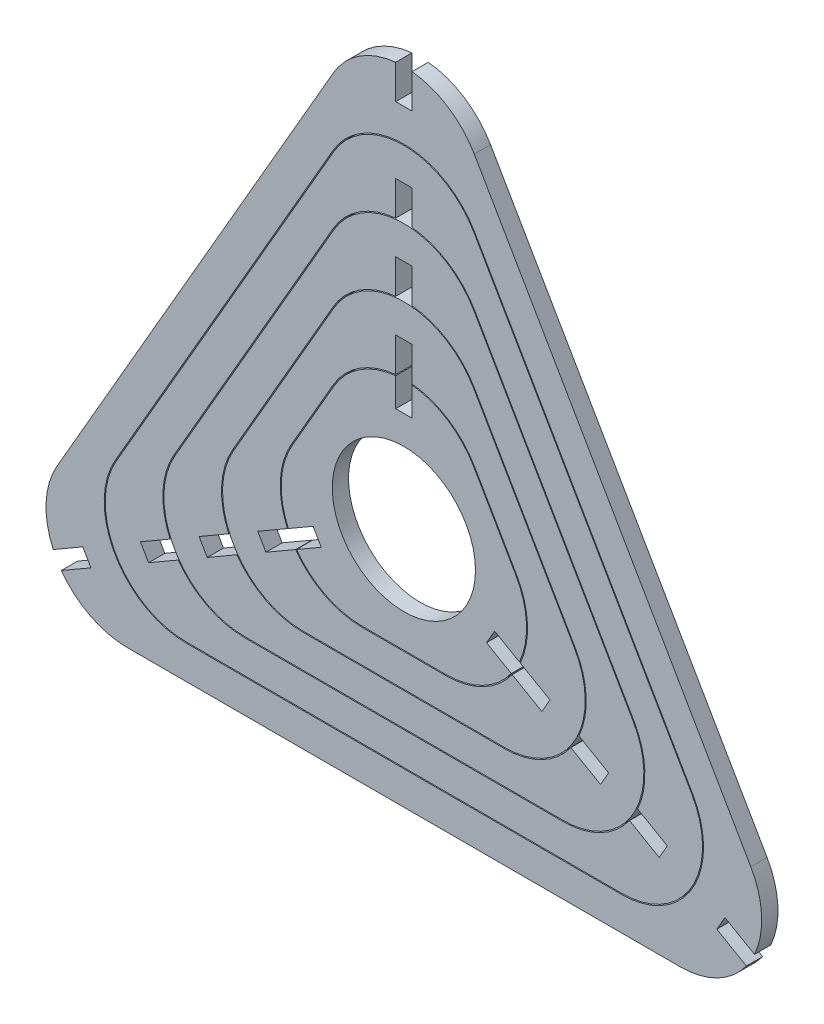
ISO-10303-21;
HEADER;
FILE_DESCRIPTION(('STEP AP214'),'2;1');
FILE_NAME('part.step','',(''),(''),'','','');
FILE_SCHEMA(('AUTOMOTIVE_DESIGN { 1 0 10303 214 1 1 1 1 }'));
ENDSEC;
DATA;
#1=APPLICATION_CONTEXT('core data for automotive mechanical design processes');
#2=APPLICATION_PROTOCOL_DEFINITION('international standard','automotive_design',2000,#1);
#3=PRODUCT_CONTEXT('',#1,'mechanical');
#4=PRODUCT('Part','Part','',(#3));
#5=PRODUCT_RELATED_PRODUCT_CATEGORY('part','',(#4));
#6=PRODUCT_DEFINITION_FORMATION('','',#4);
#7=PRODUCT_DEFINITION_CONTEXT('part definition',#1,'design');
#8=PRODUCT_DEFINITION('design','',#6,#7);
#9=PRODUCT_DEFINITION_SHAPE('','',#8);
#10=(LENGTH_UNIT() NAMED_UNIT(*) SI_UNIT(.MILLI.,.METRE.));
#11=(NAMED_UNIT(*) PLANE_ANGLE_UNIT() SI_UNIT($,.RADIAN.));
#12=(NAMED_UNIT(*) SI_UNIT($,.STERADIAN.) SOLID_ANGLE_UNIT());
#13=UNCERTAINTY_MEASURE_WITH_UNIT(LENGTH_MEASURE(1.E-05),#10,'distance_accuracy_value','');
#14=(GEOMETRIC_REPRESENTATION_CONTEXT(3) GLOBAL_UNCERTAINTY_ASSIGNED_CONTEXT((#13)) GLOBAL_UNIT_ASSIGNED_CONTEXT((#10,
#11,#12)) REPRESENTATION_CONTEXT('',''));
#15=CARTESIAN_POINT('',(0.,0.,0.));
#16=DIRECTION('',(0.,0.,1.));
#17=DIRECTION('',(1.,0.,0.));
#18=AXIS2_PLACEMENT_3D('',#15,#16,#17);
#19=CARTESIAN_POINT('',(-10.3034488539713,-5.94869896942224,0.));
#20=DIRECTION('',(0.,0.,1.));
#21=DIRECTION('',(1.,0.,0.));
#22=AXIS2_PLACEMENT_3D('',#19,#20,#21);
#23=CYLINDRICAL_SURFACE('',#22,19.875);
#24=DIRECTION('',(0.,0.,1.));
#25=VECTOR('',#24,1.);
#26=CARTESIAN_POINT('',(-26.4283348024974,-17.5678072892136,0.));
#27=LINE('',#26,#25);
#28=CARTESIAN_POINT('',(-26.4283348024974,-17.5678072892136,0.));
#29=VERTEX_POINT('',#28);
#30=CARTESIAN_POINT('',(-26.4283348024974,-17.5678072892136,4.));
#31=VERTEX_POINT('',#30);
#32=EDGE_CURVE('E2423',#29,#31,#27,.T.);
#33=ORIENTED_EDGE('',*,*,#32,.F.);
#34=CARTESIAN_POINT('',(-10.3034488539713,-5.94869896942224,0.));
#35=DIRECTION('',(0.,0.,-1.));
#36=DIRECTION('',(-1.,0.,0.));
#37=AXIS2_PLACEMENT_3D('',#34,#35,#36);
#38=CIRCLE('',#37,19.875);
#39=CARTESIAN_POINT('',(-10.303448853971,-25.8236989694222,0.));
#40=VERTEX_POINT('',#39);
#41=EDGE_CURVE('E2291',#29,#40,#38,.F.);
#42=ORIENTED_EDGE('',*,*,#41,.T.);
#43=DIRECTION('',(0.,0.,1.));
#44=VECTOR('',#43,1.);
#45=CARTESIAN_POINT('',(-10.303448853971,-25.8236989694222,0.));
#46=LINE('',#45,#44);
#47=CARTESIAN_POINT('',(-10.3034488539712,-25.8236989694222,4.));
#48=VERTEX_POINT('',#47);
#49=EDGE_CURVE('E2287',#40,#48,#46,.T.);
#50=ORIENTED_EDGE('',*,*,#49,.T.);
#51=CARTESIAN_POINT('',(-10.3034488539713,-5.94869896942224,4.));
#52=DIRECTION('',(0.,0.,1.));
#53=DIRECTION('',(1.,0.,0.));
#54=AXIS2_PLACEMENT_3D('',#51,#52,#53);
#55=CIRCLE('',#54,19.875);
#56=EDGE_CURVE('E2273',#31,#48,#55,.T.);
#57=ORIENTED_EDGE('',*,*,#56,.F.);
#58=EDGE_LOOP('',(#33,#42,#50,#57));
#59=FACE_BOUND('',#58,.T.);
#60=ADVANCED_FACE('F2106',(#59),#23,.T.);
#61=CARTESIAN_POINT('',(10.3034488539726,-5.94869896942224,0.));
#62=DIRECTION('',(0.,0.,1.));
#63=DIRECTION('',(1.,0.,0.));
#64=AXIS2_PLACEMENT_3D('',#61,#62,#63);
#65=CYLINDRICAL_SURFACE('',#64,19.875);
#66=CARTESIAN_POINT('',(10.3034488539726,-5.94869896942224,4.));
#67=DIRECTION('',(0.,0.,1.));
#68=DIRECTION('',(1.,0.,0.));
#69=AXIS2_PLACEMENT_3D('',#66,#67,#68);
#70=CIRCLE('',#69,19.875);
#71=CARTESIAN_POINT('',(27.5157037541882,3.98880103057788,4.));
#72=VERTEX_POINT('',#71);
#73=CARTESIAN_POINT('',(28.4283348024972,-14.1037056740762,4.));
#74=VERTEX_POINT('',#73);
#75=EDGE_CURVE('E2257',#72,#74,#70,.F.);
#76=ORIENTED_EDGE('',*,*,#75,.T.);
#77=DIRECTION('',(0.,0.,1.));
#78=VECTOR('',#77,1.);
#79=CARTESIAN_POINT('',(28.4283348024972,-14.1037056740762,0.));
#80=LINE('',#79,#78);
#81=CARTESIAN_POINT('',(28.4283348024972,-14.1037056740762,0.));
#82=VERTEX_POINT('',#81);
#83=EDGE_CURVE('E2444',#82,#74,#80,.T.);
#84=ORIENTED_EDGE('',*,*,#83,.F.);
#85=CARTESIAN_POINT('',(10.3034488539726,-5.94869896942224,0.));
#86=DIRECTION('',(0.,0.,-1.));
#87=DIRECTION('',(-1.,0.,0.));
#88=AXIS2_PLACEMENT_3D('',#85,#86,#87);
#89=CIRCLE('',#88,19.875);
#90=CARTESIAN_POINT('',(27.5157037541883,3.98880103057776,0.));
#91=VERTEX_POINT('',#90);
#92=EDGE_CURVE('E2281',#91,#82,#89,.T.);
#93=ORIENTED_EDGE('',*,*,#92,.F.);
#94=DIRECTION('',(0.,0.,1.));
#95=VECTOR('',#94,1.);
#96=CARTESIAN_POINT('',(27.5157037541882,3.988801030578,0.));
#97=LINE('',#96,#95);
#98=EDGE_CURVE('E2261',#91,#72,#97,.T.);
#99=ORIENTED_EDGE('',*,*,#98,.T.);
#100=EDGE_LOOP('',(#76,#84,#93,#99));
#101=FACE_BOUND('',#100,.T.);
#102=ADVANCED_FACE('F2380',(#101),#65,.T.);
#103=CARTESIAN_POINT('',(6.39169330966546E-13,11.8973979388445,0.));
#104=DIRECTION('',(0.,0.,1.));
#105=DIRECTION('',(1.,0.,0.));
#106=AXIS2_PLACEMENT_3D('',#103,#104,#105);
#107=CYLINDRICAL_SURFACE('',#106,19.875);
#108=DIRECTION('',(0.,0.,1.));
#109=VECTOR('',#108,1.);
#110=CARTESIAN_POINT('',(-2.,31.6715129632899,0.));
#111=LINE('',#110,#109);
#112=CARTESIAN_POINT('',(-2.,31.6715129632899,0.));
#113=VERTEX_POINT('',#112);
#114=CARTESIAN_POINT('',(-2.,31.6715129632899,4.));
#115=VERTEX_POINT('',#114);
#116=EDGE_CURVE('E2324',#113,#115,#111,.T.);
#117=ORIENTED_EDGE('',*,*,#116,.F.);
#118=CARTESIAN_POINT('',(6.39169330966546E-13,11.8973979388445,0.));
#119=DIRECTION('',(0.,0.,-1.));
#120=DIRECTION('',(-1.,0.,0.));
#121=AXIS2_PLACEMENT_3D('',#118,#119,#120);
#122=CIRCLE('',#121,19.875);
#123=CARTESIAN_POINT('',(-17.2122549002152,21.8348979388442,0.));
#124=VERTEX_POINT('',#123);
#125=EDGE_CURVE('E2306',#113,#124,#122,.F.);
#126=ORIENTED_EDGE('',*,*,#125,.T.);
#127=DIRECTION('',(0.,0.,1.));
#128=VECTOR('',#127,1.);
#129=CARTESIAN_POINT('',(-17.2122549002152,21.8348979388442,0.));
#130=LINE('',#129,#128);
#131=CARTESIAN_POINT('',(-17.2122549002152,21.8348979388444,4.));
#132=VERTEX_POINT('',#131);
#133=EDGE_CURVE('E2302',#124,#132,#130,.T.);
#134=ORIENTED_EDGE('',*,*,#133,.T.);
#135=CARTESIAN_POINT('',(6.39169330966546E-13,11.8973979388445,4.));
#136=DIRECTION('',(0.,0.,1.));
#137=DIRECTION('',(1.,0.,0.));
#138=AXIS2_PLACEMENT_3D('',#135,#136,#137);
#139=CIRCLE('',#138,19.875);
#140=EDGE_CURVE('E2277',#115,#132,#139,.T.);
#141=ORIENTED_EDGE('',*,*,#140,.F.);
#142=EDGE_LOOP('',(#117,#126,#134,#141));
#143=FACE_BOUND('',#142,.T.);
#144=ADVANCED_FACE('F2348',(#143),#107,.T.);
#145=CARTESIAN_POINT('',(0.,0.,0.));
#146=DIRECTION('',(0.,0.,1.));
#147=DIRECTION('',(1.,0.,0.));
#148=AXIS2_PLACEMENT_3D('',#145,#146,#147);
#149=PLANE('',#148);
#150=CARTESIAN_POINT('',(0.,0.,0.));
#151=DIRECTION('',(0.,0.,1.));
#152=DIRECTION('',(1.,0.,0.));
#153=AXIS2_PLACEMENT_3D('',#150,#151,#152);
#154=CIRCLE('',#153,17.6153656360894);
#155=CARTESIAN_POINT('',(17.6153656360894,0.,0.));
#156=VERTEX_POINT('',#155);
#157=EDGE_CURVE('E2305',#156,#156,#154,.T.);
#158=ORIENTED_EDGE('',*,*,#157,.T.);
#159=EDGE_LOOP('',(#158));
#160=FACE_BOUND('',#159,.T.);
#161=ORIENTED_EDGE('',*,*,#92,.T.);
#162=DIRECTION('',(-0.866025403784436,0.500000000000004,0.));
#163=VECTOR('',#162,1.);
#164=CARTESIAN_POINT('',(1.00000000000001,1.73205080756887,0.));
#165=LINE('',#164,#163);
#166=CARTESIAN_POINT('',(22.3314023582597,-10.5836400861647,0.));
#167=VERTEX_POINT('',#166);
#168=EDGE_CURVE('E2351',#82,#167,#165,.T.);
#169=ORIENTED_EDGE('',*,*,#168,.T.);
#170=DIRECTION('',(-0.500000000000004,-0.866025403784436,0.));
#171=VECTOR('',#170,1.);
#172=CARTESIAN_POINT('',(21.3314023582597,-12.3156908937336,0.));
#173=LINE('',#172,#171);
#174=CARTESIAN_POINT('',(20.3314023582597,-14.0477417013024,0.));
#175=VERTEX_POINT('',#174);
#176=EDGE_CURVE('E2436',#167,#175,#173,.T.);
#177=ORIENTED_EDGE('',*,*,#176,.T.);
#178=DIRECTION('',(0.866025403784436,-0.500000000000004,0.));
#179=VECTOR('',#178,1.);
#180=CARTESIAN_POINT('',(-1.00000000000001,-1.73205080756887,0.));
#181=LINE('',#180,#179);
#182=CARTESIAN_POINT('',(26.4283348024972,-17.567807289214,0.));
#183=VERTEX_POINT('',#182);
#184=EDGE_CURVE('E2249',#175,#183,#181,.T.);
#185=ORIENTED_EDGE('',*,*,#184,.T.);
#186=CARTESIAN_POINT('',(10.3034488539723,-25.8236989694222,0.));
#187=VERTEX_POINT('',#186);
#188=EDGE_CURVE('E2248',#183,#187,#89,.T.);
#189=ORIENTED_EDGE('',*,*,#188,.T.);
#190=DIRECTION('',(1.,0.,0.));
#191=VECTOR('',#190,1.);
#192=CARTESIAN_POINT('',(10.3034488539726,-25.8236989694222,0.));
#193=LINE('',#192,#191);
#194=EDGE_CURVE('E2262',#40,#187,#193,.T.);
#195=ORIENTED_EDGE('',*,*,#194,.F.);
#196=ORIENTED_EDGE('',*,*,#41,.F.);
#197=DIRECTION('',(0.866025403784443,0.499999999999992,0.));
#198=VECTOR('',#197,1.);
#199=CARTESIAN_POINT('',(0.999999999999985,-1.73205080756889,0.));
#200=LINE('',#199,#198);
#201=CARTESIAN_POINT('',(-20.3314023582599,-14.0477417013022,0.));
#202=VERTEX_POINT('',#201);
#203=EDGE_CURVE('E2240',#29,#202,#200,.T.);
#204=ORIENTED_EDGE('',*,*,#203,.T.);
#205=DIRECTION('',(-0.499999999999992,0.866025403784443,0.));
#206=VECTOR('',#205,1.);
#207=CARTESIAN_POINT('',(-21.3314023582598,-12.3156908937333,0.));
#208=LINE('',#207,#206);
#209=CARTESIAN_POINT('',(-22.3314023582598,-10.5836400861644,0.));
#210=VERTEX_POINT('',#209);
#211=EDGE_CURVE('E2420',#202,#210,#208,.T.);
#212=ORIENTED_EDGE('',*,*,#211,.T.);
#213=DIRECTION('',(-0.866025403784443,-0.499999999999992,0.));
#214=VECTOR('',#213,1.);
#215=CARTESIAN_POINT('',(-0.999999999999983,1.73205080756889,0.));
#216=LINE('',#215,#214);
#217=CARTESIAN_POINT('',(-28.4283348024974,-14.1037056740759,0.));
#218=VERTEX_POINT('',#217);
#219=EDGE_CURVE('E2406',#210,#218,#216,.T.);
#220=ORIENTED_EDGE('',*,*,#219,.T.);
#221=CARTESIAN_POINT('',(-27.5157037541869,3.988801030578,0.));
#222=VERTEX_POINT('',#221);
#223=EDGE_CURVE('E2288',#222,#218,#38,.F.);
#224=ORIENTED_EDGE('',*,*,#223,.F.);
#225=DIRECTION('',(-0.5,-0.866025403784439,0.));
#226=VECTOR('',#225,1.);
#227=CARTESIAN_POINT('',(-22.3639793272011,12.9118494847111,0.));
#228=LINE('',#227,#226);
#229=EDGE_CURVE('E2292',#124,#222,#228,.T.);
#230=ORIENTED_EDGE('',*,*,#229,.F.);
#231=ORIENTED_EDGE('',*,*,#125,.F.);
#232=DIRECTION('',(0.,-1.,0.));
#233=VECTOR('',#232,1.);
#234=CARTESIAN_POINT('',(-2.,0.,0.));
#235=LINE('',#234,#233);
#236=CARTESIAN_POINT('',(-2.,24.6313817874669,0.));
#237=VERTEX_POINT('',#236);
#238=EDGE_CURVE('E2313',#113,#237,#235,.T.);
#239=ORIENTED_EDGE('',*,*,#238,.T.);
#240=DIRECTION('',(1.,0.,0.));
#241=VECTOR('',#240,1.);
#242=CARTESIAN_POINT('',(0.,24.6313817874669,0.));
#243=LINE('',#242,#241);
#244=CARTESIAN_POINT('',(2.,24.6313817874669,0.));
#245=VERTEX_POINT('',#244);
#246=EDGE_CURVE('E2318',#237,#245,#243,.T.);
#247=ORIENTED_EDGE('',*,*,#246,.T.);
#248=DIRECTION('',(0.,1.,0.));
#249=VECTOR('',#248,1.);
#250=CARTESIAN_POINT('',(2.,0.,0.));
#251=LINE('',#250,#249);
#252=CARTESIAN_POINT('',(2.,31.67151296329,0.));
#253=VERTEX_POINT('',#252);
#254=EDGE_CURVE('E2321',#245,#253,#251,.T.);
#255=ORIENTED_EDGE('',*,*,#254,.T.);
#256=CARTESIAN_POINT('',(17.2122549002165,21.8348979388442,0.));
#257=VERTEX_POINT('',#256);
#258=EDGE_CURVE('E2110',#257,#253,#122,.F.);
#259=ORIENTED_EDGE('',*,*,#258,.F.);
#260=DIRECTION('',(-0.5,0.866025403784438,0.));
#261=VECTOR('',#260,1.);
#262=CARTESIAN_POINT('',(27.5157037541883,3.98880103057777,0.));
#263=LINE('',#262,#261);
#264=EDGE_CURVE('E2284',#91,#257,#263,.T.);
#265=ORIENTED_EDGE('',*,*,#264,.F.);
#266=EDGE_LOOP('',(#161,#169,#177,#185,#189,#195,#196,#204,#212,#220,#224,#230,#231,#239,#247,
#255,#259,#265));
#267=FACE_BOUND('',#266,.T.);
#268=ADVANCED_FACE('F2108',(#160,#267),#149,.F.);
#269=CARTESIAN_POINT('',(27.5157037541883,3.98880103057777,0.));
#270=DIRECTION('',(0.866025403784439,0.5,0.));
#271=DIRECTION('',(-0.5,0.866025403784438,0.));
#272=AXIS2_PLACEMENT_3D('',#269,#270,#271);
#273=PLANE('',#272);
#274=ORIENTED_EDGE('',*,*,#98,.F.);
#275=ORIENTED_EDGE('',*,*,#264,.T.);
#276=DIRECTION('',(0.,0.,1.));
#277=VECTOR('',#276,1.);
#278=CARTESIAN_POINT('',(17.2122549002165,21.8348979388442,0.));
#279=LINE('',#278,#277);
#280=CARTESIAN_POINT('',(17.2122549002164,21.8348979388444,4.));
#281=VERTEX_POINT('',#280);
#282=EDGE_CURVE('E2298',#257,#281,#279,.T.);
#283=ORIENTED_EDGE('',*,*,#282,.T.);
#284=DIRECTION('',(-0.5,0.866025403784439,0.));
#285=VECTOR('',#284,1.);
#286=CARTESIAN_POINT('',(27.5157037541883,3.98880103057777,4.));
#287=LINE('',#286,#285);
#288=EDGE_CURVE('E2269',#72,#281,#287,.T.);
#289=ORIENTED_EDGE('',*,*,#288,.F.);
#290=EDGE_LOOP('',(#274,#275,#283,#289));
#291=FACE_BOUND('',#290,.T.);
#292=ADVANCED_FACE('F2452',(#291),#273,.T.);
#293=DIRECTION('',(0.,0.,1.));
#294=VECTOR('',#293,1.);
#295=CARTESIAN_POINT('',(2.,31.67151296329,0.));
#296=LINE('',#295,#294);
#297=CARTESIAN_POINT('',(2.,31.67151296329,4.));
#298=VERTEX_POINT('',#297);
#299=EDGE_CURVE('E13',#298,#253,#296,.F.);
#300=ORIENTED_EDGE('',*,*,#299,.F.);
#301=EDGE_CURVE('E2280',#281,#298,#139,.T.);
#302=ORIENTED_EDGE('',*,*,#301,.F.);
#303=ORIENTED_EDGE('',*,*,#282,.F.);
#304=ORIENTED_EDGE('',*,*,#258,.T.);
#305=EDGE_LOOP('',(#300,#302,#303,#304));
#306=FACE_BOUND('',#305,.T.);
#307=ADVANCED_FACE('F2359',(#306),#107,.T.);
#308=CARTESIAN_POINT('',(-22.3639793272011,12.9118494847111,0.));
#309=DIRECTION('',(-0.866025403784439,0.5,0.));
#310=DIRECTION('',(-0.5,-0.866025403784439,0.));
#311=AXIS2_PLACEMENT_3D('',#308,#309,#310);
#312=PLANE('',#311);
#313=ORIENTED_EDGE('',*,*,#133,.F.);
#314=ORIENTED_EDGE('',*,*,#229,.T.);
#315=DIRECTION('',(0.,0.,1.));
#316=VECTOR('',#315,1.);
#317=CARTESIAN_POINT('',(-27.5157037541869,3.988801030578,0.));
#318=LINE('',#317,#316);
#319=CARTESIAN_POINT('',(-27.515703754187,3.98880103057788,4.));
#320=VERTEX_POINT('',#319);
#321=EDGE_CURVE('E2295',#222,#320,#318,.T.);
#322=ORIENTED_EDGE('',*,*,#321,.T.);
#323=DIRECTION('',(-0.5,-0.866025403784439,0.));
#324=VECTOR('',#323,1.);
#325=CARTESIAN_POINT('',(-17.2122549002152,21.8348979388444,4.));
#326=LINE('',#325,#324);
#327=EDGE_CURVE('E2274',#132,#320,#326,.T.);
#328=ORIENTED_EDGE('',*,*,#327,.F.);
#329=EDGE_LOOP('',(#313,#314,#322,#328));
#330=FACE_BOUND('',#329,.T.);
#331=ADVANCED_FACE('F2346',(#330),#312,.T.);
#332=DIRECTION('',(0.,0.,1.));
#333=VECTOR('',#332,1.);
#334=CARTESIAN_POINT('',(-28.4283348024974,-14.1037056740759,0.));
#335=LINE('',#334,#333);
#336=CARTESIAN_POINT('',(-28.4283348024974,-14.1037056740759,4.));
#337=VERTEX_POINT('',#336);
#338=EDGE_CURVE('E2401',#337,#218,#335,.F.);
#339=ORIENTED_EDGE('',*,*,#338,.F.);
#340=EDGE_CURVE('E2270',#320,#337,#55,.T.);
#341=ORIENTED_EDGE('',*,*,#340,.F.);
#342=ORIENTED_EDGE('',*,*,#321,.F.);
#343=ORIENTED_EDGE('',*,*,#223,.T.);
#344=EDGE_LOOP('',(#339,#341,#342,#343));
#345=FACE_BOUND('',#344,.T.);
#346=ADVANCED_FACE('F2383',(#345),#23,.T.);
#347=CARTESIAN_POINT('',(10.3034488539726,-25.8236989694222,0.));
#348=DIRECTION('',(0.,-1.,0.));
#349=DIRECTION('',(0.,0.,-1.));
#350=AXIS2_PLACEMENT_3D('',#347,#348,#349);
#351=PLANE('',#350);
#352=ORIENTED_EDGE('',*,*,#49,.F.);
#353=ORIENTED_EDGE('',*,*,#194,.T.);
#354=DIRECTION('',(0.,0.,1.));
#355=VECTOR('',#354,1.);
#356=CARTESIAN_POINT('',(10.3034488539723,-25.8236989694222,0.));
#357=LINE('',#356,#355);
#358=CARTESIAN_POINT('',(10.3034488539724,-25.8236989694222,4.));
#359=VERTEX_POINT('',#358);
#360=EDGE_CURVE('E2258',#187,#359,#357,.T.);
#361=ORIENTED_EDGE('',*,*,#360,.T.);
#362=DIRECTION('',(1.,0.,0.));
#363=VECTOR('',#362,1.);
#364=CARTESIAN_POINT('',(0.,-25.8236989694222,4.));
#365=LINE('',#364,#363);
#366=EDGE_CURVE('E2256',#48,#359,#365,.T.);
#367=ORIENTED_EDGE('',*,*,#366,.F.);
#368=EDGE_LOOP('',(#352,#353,#361,#367));
#369=FACE_BOUND('',#368,.T.);
#370=ADVANCED_FACE('F2393',(#369),#351,.T.);
#371=ORIENTED_EDGE('',*,*,#188,.F.);
#372=DIRECTION('',(0.,0.,1.));
#373=VECTOR('',#372,1.);
#374=CARTESIAN_POINT('',(26.4283348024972,-17.567807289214,0.));
#375=LINE('',#374,#373);
#376=CARTESIAN_POINT('',(26.4283348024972,-17.567807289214,4.));
#377=VERTEX_POINT('',#376);
#378=EDGE_CURVE('E2235',#377,#183,#375,.F.);
#379=ORIENTED_EDGE('',*,*,#378,.F.);
#380=EDGE_CURVE('E2246',#377,#359,#70,.F.);
#381=ORIENTED_EDGE('',*,*,#380,.T.);
#382=ORIENTED_EDGE('',*,*,#360,.F.);
#383=EDGE_LOOP('',(#371,#379,#381,#382));
#384=FACE_BOUND('',#383,.T.);
#385=ADVANCED_FACE('F2244',(#384),#65,.T.);
#386=CARTESIAN_POINT('',(0.,0.,4.));
#387=DIRECTION('',(0.,0.,1.));
#388=DIRECTION('',(1.,0.,0.));
#389=AXIS2_PLACEMENT_3D('',#386,#387,#388);
#390=PLANE('',#389);
#391=DIRECTION('',(-0.866025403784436,0.500000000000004,0.));
#392=VECTOR('',#391,1.);
#393=CARTESIAN_POINT('',(1.00000000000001,1.73205080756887,4.));
#394=LINE('',#393,#392);
#395=CARTESIAN_POINT('',(22.3314023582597,-10.5836400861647,4.));
#396=VERTEX_POINT('',#395);
#397=EDGE_CURVE('E2353',#74,#396,#394,.T.);
#398=ORIENTED_EDGE('',*,*,#397,.F.);
#399=ORIENTED_EDGE('',*,*,#75,.F.);
#400=ORIENTED_EDGE('',*,*,#288,.T.);
#401=ORIENTED_EDGE('',*,*,#301,.T.);
#402=DIRECTION('',(0.,1.,0.));
#403=VECTOR('',#402,1.);
#404=CARTESIAN_POINT('',(2.,0.,4.));
#405=LINE('',#404,#403);
#406=CARTESIAN_POINT('',(2.,24.6313817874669,4.));
#407=VERTEX_POINT('',#406);
#408=EDGE_CURVE('E2115',#407,#298,#405,.T.);
#409=ORIENTED_EDGE('',*,*,#408,.F.);
#410=DIRECTION('',(1.,0.,0.));
#411=VECTOR('',#410,1.);
#412=CARTESIAN_POINT('',(0.,24.6313817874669,4.));
#413=LINE('',#412,#411);
#414=CARTESIAN_POINT('',(-2.,24.6313817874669,4.));
#415=VERTEX_POINT('',#414);
#416=EDGE_CURVE('E2326',#415,#407,#413,.T.);
#417=ORIENTED_EDGE('',*,*,#416,.F.);
#418=DIRECTION('',(0.,-1.,0.));
#419=VECTOR('',#418,1.);
#420=CARTESIAN_POINT('',(-2.,0.,4.));
#421=LINE('',#420,#419);
#422=EDGE_CURVE('E2266',#115,#415,#421,.T.);
#423=ORIENTED_EDGE('',*,*,#422,.F.);
#424=ORIENTED_EDGE('',*,*,#140,.T.);
#425=ORIENTED_EDGE('',*,*,#327,.T.);
#426=ORIENTED_EDGE('',*,*,#340,.T.);
#427=DIRECTION('',(-0.866025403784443,-0.499999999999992,0.));
#428=VECTOR('',#427,1.);
#429=CARTESIAN_POINT('',(-0.999999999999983,1.73205080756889,4.));
#430=LINE('',#429,#428);
#431=CARTESIAN_POINT('',(-22.3314023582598,-10.5836400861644,4.));
#432=VERTEX_POINT('',#431);
#433=EDGE_CURVE('E2410',#432,#337,#430,.T.);
#434=ORIENTED_EDGE('',*,*,#433,.F.);
#435=DIRECTION('',(-0.499999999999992,0.866025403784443,0.));
#436=VECTOR('',#435,1.);
#437=CARTESIAN_POINT('',(-21.3314023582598,-12.3156908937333,4.));
#438=LINE('',#437,#436);
#439=CARTESIAN_POINT('',(-20.3314023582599,-14.0477417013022,4.));
#440=VERTEX_POINT('',#439);
#441=EDGE_CURVE('E2131',#440,#432,#438,.T.);
#442=ORIENTED_EDGE('',*,*,#441,.F.);
#443=DIRECTION('',(0.866025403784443,0.499999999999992,0.));
#444=VECTOR('',#443,1.);
#445=CARTESIAN_POINT('',(0.999999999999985,-1.73205080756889,4.));
#446=LINE('',#445,#444);
#447=EDGE_CURVE('E2425',#31,#440,#446,.T.);
#448=ORIENTED_EDGE('',*,*,#447,.F.);
#449=ORIENTED_EDGE('',*,*,#56,.T.);
#450=ORIENTED_EDGE('',*,*,#366,.T.);
#451=ORIENTED_EDGE('',*,*,#380,.F.);
#452=DIRECTION('',(0.866025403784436,-0.500000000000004,0.));
#453=VECTOR('',#452,1.);
#454=CARTESIAN_POINT('',(-1.00000000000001,-1.73205080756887,4.));
#455=LINE('',#454,#453);
#456=CARTESIAN_POINT('',(20.3314023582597,-14.0477417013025,4.));
#457=VERTEX_POINT('',#456);
#458=EDGE_CURVE('E2231',#457,#377,#455,.T.);
#459=ORIENTED_EDGE('',*,*,#458,.F.);
#460=DIRECTION('',(-0.500000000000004,-0.866025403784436,0.));
#461=VECTOR('',#460,1.);
#462=CARTESIAN_POINT('',(21.3314023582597,-12.3156908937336,4.));
#463=LINE('',#462,#461);
#464=EDGE_CURVE('E2123',#396,#457,#463,.T.);
#465=ORIENTED_EDGE('',*,*,#464,.F.);
#466=EDGE_LOOP('',(#398,#399,#400,#401,#409,#417,#423,#424,#425,#426,#434,#442,#448,#449,#450,
#451,#459,#465));
#467=FACE_BOUND('',#466,.T.);
#468=CARTESIAN_POINT('',(0.,0.,4.));
#469=DIRECTION('',(0.,0.,1.));
#470=DIRECTION('',(1.,0.,0.));
#471=AXIS2_PLACEMENT_3D('',#468,#469,#470);
#472=CIRCLE('',#471,17.6153656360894);
#473=CARTESIAN_POINT('',(17.6153656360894,0.,4.));
#474=VERTEX_POINT('',#473);
#475=EDGE_CURVE('E2314',#474,#474,#472,.T.);
#476=ORIENTED_EDGE('',*,*,#475,.F.);
#477=EDGE_LOOP('',(#476));
#478=FACE_BOUND('',#477,.T.);
#479=ADVANCED_FACE('F2253',(#467,#478),#390,.T.);
#480=CARTESIAN_POINT('',(0.,0.,-6.));
#481=DIRECTION('',(0.,0.,1.));
#482=DIRECTION('',(1.,0.,0.));
#483=AXIS2_PLACEMENT_3D('',#480,#481,#482);
#484=CYLINDRICAL_SURFACE('',#483,17.6153656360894);
#485=ORIENTED_EDGE('',*,*,#475,.T.);
#486=EDGE_LOOP('',(#485));
#487=FACE_BOUND('',#486,.T.);
#488=ORIENTED_EDGE('',*,*,#157,.F.);
#489=EDGE_LOOP('',(#488));
#490=FACE_BOUND('',#489,.T.);
#491=ADVANCED_FACE('F2377',(#487,#490),#484,.F.);
#492=CARTESIAN_POINT('',(0.,24.6313817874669,-6.));
#493=DIRECTION('',(0.,-1.,0.));
#494=DIRECTION('',(0.,0.,-1.));
#495=AXIS2_PLACEMENT_3D('',#492,#493,#494);
#496=PLANE('',#495);
#497=DIRECTION('',(0.,0.,1.));
#498=VECTOR('',#497,1.);
#499=CARTESIAN_POINT('',(-2.,24.6313817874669,-6.));
#500=LINE('',#499,#498);
#501=EDGE_CURVE('E2317',#237,#415,#500,.T.);
#502=ORIENTED_EDGE('',*,*,#501,.T.);
#503=ORIENTED_EDGE('',*,*,#416,.T.);
#504=DIRECTION('',(0.,0.,1.));
#505=VECTOR('',#504,1.);
#506=CARTESIAN_POINT('',(2.,24.6313817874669,-6.));
#507=LINE('',#506,#505);
#508=EDGE_CURVE('E2330',#245,#407,#507,.T.);
#509=ORIENTED_EDGE('',*,*,#508,.F.);
#510=ORIENTED_EDGE('',*,*,#246,.F.);
#511=EDGE_LOOP('',(#502,#503,#509,#510));
#512=FACE_BOUND('',#511,.T.);
#513=ADVANCED_FACE('F2365',(#512),#496,.F.);
#514=CARTESIAN_POINT('',(-2.,0.,-6.));
#515=DIRECTION('',(-1.,0.,0.));
#516=DIRECTION('',(0.,-1.,0.));
#517=AXIS2_PLACEMENT_3D('',#514,#515,#516);
#518=PLANE('',#517);
#519=ORIENTED_EDGE('',*,*,#116,.T.);
#520=ORIENTED_EDGE('',*,*,#422,.T.);
#521=ORIENTED_EDGE('',*,*,#501,.F.);
#522=ORIENTED_EDGE('',*,*,#238,.F.);
#523=EDGE_LOOP('',(#519,#520,#521,#522));
#524=FACE_BOUND('',#523,.T.);
#525=ADVANCED_FACE('F2368',(#524),#518,.F.);
#526=CARTESIAN_POINT('',(2.,0.,-6.));
#527=DIRECTION('',(1.,0.,0.));
#528=DIRECTION('',(0.,1.,0.));
#529=AXIS2_PLACEMENT_3D('',#526,#527,#528);
#530=PLANE('',#529);
#531=ORIENTED_EDGE('',*,*,#508,.T.);
#532=ORIENTED_EDGE('',*,*,#408,.T.);
#533=ORIENTED_EDGE('',*,*,#299,.T.);
#534=ORIENTED_EDGE('',*,*,#254,.F.);
#535=EDGE_LOOP('',(#531,#532,#533,#534));
#536=FACE_BOUND('',#535,.T.);
#537=ADVANCED_FACE('F2363',(#536),#530,.F.);
#538=CARTESIAN_POINT('',(0.999999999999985,-1.73205080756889,-6.));
#539=DIRECTION('',(0.499999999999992,-0.866025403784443,0.));
#540=DIRECTION('',(0.866025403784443,0.499999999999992,0.));
#541=AXIS2_PLACEMENT_3D('',#538,#539,#540);
#542=PLANE('',#541);
#543=ORIENTED_EDGE('',*,*,#32,.T.);
#544=ORIENTED_EDGE('',*,*,#447,.T.);
#545=DIRECTION('',(0.,0.,1.));
#546=VECTOR('',#545,1.);
#547=CARTESIAN_POINT('',(-20.3314023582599,-14.0477417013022,-6.));
#548=LINE('',#547,#546);
#549=EDGE_CURVE('E2417',#202,#440,#548,.T.);
#550=ORIENTED_EDGE('',*,*,#549,.F.);
#551=ORIENTED_EDGE('',*,*,#203,.F.);
#552=EDGE_LOOP('',(#543,#544,#550,#551));
#553=FACE_BOUND('',#552,.T.);
#554=ADVANCED_FACE('F2375',(#553),#542,.F.);
#555=CARTESIAN_POINT('',(-21.3314023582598,-12.3156908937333,-6.));
#556=DIRECTION('',(0.866025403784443,0.499999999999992,0.));
#557=DIRECTION('',(0.,0.,-1.));
#558=AXIS2_PLACEMENT_3D('',#555,#556,#557);
#559=PLANE('',#558);
#560=ORIENTED_EDGE('',*,*,#549,.T.);
#561=ORIENTED_EDGE('',*,*,#441,.T.);
#562=DIRECTION('',(0.,0.,1.));
#563=VECTOR('',#562,1.);
#564=CARTESIAN_POINT('',(-22.3314023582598,-10.5836400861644,-6.));
#565=LINE('',#564,#563);
#566=EDGE_CURVE('E2407',#210,#432,#565,.T.);
#567=ORIENTED_EDGE('',*,*,#566,.F.);
#568=ORIENTED_EDGE('',*,*,#211,.F.);
#569=EDGE_LOOP('',(#560,#561,#567,#568));
#570=FACE_BOUND('',#569,.T.);
#571=ADVANCED_FACE('F2463',(#570),#559,.F.);
#572=CARTESIAN_POINT('',(-0.999999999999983,1.73205080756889,-6.));
#573=DIRECTION('',(-0.499999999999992,0.866025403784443,0.));
#574=DIRECTION('',(-0.866025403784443,-0.499999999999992,0.));
#575=AXIS2_PLACEMENT_3D('',#572,#573,#574);
#576=PLANE('',#575);
#577=ORIENTED_EDGE('',*,*,#566,.T.);
#578=ORIENTED_EDGE('',*,*,#433,.T.);
#579=ORIENTED_EDGE('',*,*,#338,.T.);
#580=ORIENTED_EDGE('',*,*,#219,.F.);
#581=EDGE_LOOP('',(#577,#578,#579,#580));
#582=FACE_BOUND('',#581,.T.);
#583=ADVANCED_FACE('F2466',(#582),#576,.F.);
#584=CARTESIAN_POINT('',(1.00000000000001,1.73205080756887,-6.));
#585=DIRECTION('',(0.500000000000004,0.866025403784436,0.));
#586=DIRECTION('',(-0.866025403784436,0.500000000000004,0.));
#587=AXIS2_PLACEMENT_3D('',#584,#585,#586);
#588=PLANE('',#587);
#589=ORIENTED_EDGE('',*,*,#83,.T.);
#590=ORIENTED_EDGE('',*,*,#397,.T.);
#591=DIRECTION('',(0.,0.,1.));
#592=VECTOR('',#591,1.);
#593=CARTESIAN_POINT('',(22.3314023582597,-10.5836400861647,-6.));
#594=LINE('',#593,#592);
#595=EDGE_CURVE('E2437',#167,#396,#594,.T.);
#596=ORIENTED_EDGE('',*,*,#595,.F.);
#597=ORIENTED_EDGE('',*,*,#168,.F.);
#598=EDGE_LOOP('',(#589,#590,#596,#597));
#599=FACE_BOUND('',#598,.T.);
#600=ADVANCED_FACE('F2447',(#599),#588,.F.);
#601=CARTESIAN_POINT('',(21.3314023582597,-12.3156908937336,-6.));
#602=DIRECTION('',(-0.866025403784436,0.500000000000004,0.));
#603=DIRECTION('',(0.,0.,-1.));
#604=AXIS2_PLACEMENT_3D('',#601,#602,#603);
#605=PLANE('',#604);
#606=ORIENTED_EDGE('',*,*,#595,.T.);
#607=ORIENTED_EDGE('',*,*,#464,.T.);
#608=DIRECTION('',(0.,0.,1.));
#609=VECTOR('',#608,1.);
#610=CARTESIAN_POINT('',(20.3314023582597,-14.0477417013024,-6.));
#611=LINE('',#610,#609);
#612=EDGE_CURVE('E2237',#175,#457,#611,.T.);
#613=ORIENTED_EDGE('',*,*,#612,.F.);
#614=ORIENTED_EDGE('',*,*,#176,.F.);
#615=EDGE_LOOP('',(#606,#607,#613,#614));
#616=FACE_BOUND('',#615,.T.);
#617=ADVANCED_FACE('F2471',(#616),#605,.F.);
#618=CARTESIAN_POINT('',(-1.00000000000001,-1.73205080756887,-6.));
#619=DIRECTION('',(-0.500000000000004,-0.866025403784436,0.));
#620=DIRECTION('',(0.866025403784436,-0.500000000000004,0.));
#621=AXIS2_PLACEMENT_3D('',#618,#619,#620);
#622=PLANE('',#621);
#623=ORIENTED_EDGE('',*,*,#612,.T.);
#624=ORIENTED_EDGE('',*,*,#458,.T.);
#625=ORIENTED_EDGE('',*,*,#378,.T.);
#626=ORIENTED_EDGE('',*,*,#184,.F.);
#627=EDGE_LOOP('',(#623,#624,#625,#626));
#628=FACE_BOUND('',#627,.T.);
#629=ADVANCED_FACE('F2233',(#628),#622,.F.);
#630=CLOSED_SHELL('',(#60,#102,#144,#268,#292,#307,#331,#346,#370,#385,#479,#491,#513,#525,#537,
#554,#571,#583,#600,#617,#629));
#631=MANIFOLD_SOLID_BREP('B2',#630);
#632=CARTESIAN_POINT('',(10.3034488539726,-5.94869896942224,0.));
#633=DIRECTION('',(0.,0.,1.));
#634=DIRECTION('',(1.,0.,0.));
#635=AXIS2_PLACEMENT_3D('',#632,#633,#634);
#636=CYLINDRICAL_SURFACE('',#635,20.125);
#637=DIRECTION('',(0.,0.,1.));
#638=VECTOR('',#637,1.);
#639=CARTESIAN_POINT('',(28.6459319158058,-14.2293354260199,0.));
#640=LINE('',#639,#638);
#641=CARTESIAN_POINT('',(28.6459319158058,-14.2293354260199,0.));
#642=VERTEX_POINT('',#641);
#643=CARTESIAN_POINT('',(28.6459319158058,-14.2293354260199,4.));
#644=VERTEX_POINT('',#643);
#645=EDGE_CURVE('E2866',#642,#644,#640,.T.);
#646=ORIENTED_EDGE('',*,*,#645,.T.);
#647=CARTESIAN_POINT('',(10.3034488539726,-5.94869896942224,4.));
#648=DIRECTION('',(0.,0.,1.));
#649=DIRECTION('',(1.,0.,0.));
#650=AXIS2_PLACEMENT_3D('',#647,#648,#649);
#651=CIRCLE('',#650,20.125);
#652=CARTESIAN_POINT('',(27.7322101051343,4.11380103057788,4.));
#653=VERTEX_POINT('',#652);
#654=EDGE_CURVE('E2918',#653,#644,#651,.F.);
#655=ORIENTED_EDGE('',*,*,#654,.F.);
#656=DIRECTION('',(0.,0.,1.));
#657=VECTOR('',#656,1.);
#658=CARTESIAN_POINT('',(27.7322101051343,4.113801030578,0.));
#659=LINE('',#658,#657);
#660=CARTESIAN_POINT('',(27.7322101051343,4.113801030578,0.));
#661=VERTEX_POINT('',#660);
#662=EDGE_CURVE('E2936',#661,#653,#659,.T.);
#663=ORIENTED_EDGE('',*,*,#662,.F.);
#664=CARTESIAN_POINT('',(10.3034488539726,-5.94869896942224,0.));
#665=DIRECTION('',(0.,0.,-1.));
#666=DIRECTION('',(-1.,0.,0.));
#667=AXIS2_PLACEMENT_3D('',#664,#665,#666);
#668=CIRCLE('',#667,20.125);
#669=EDGE_CURVE('E2973',#661,#642,#668,.T.);
#670=ORIENTED_EDGE('',*,*,#669,.T.);
#671=EDGE_LOOP('',(#646,#655,#663,#670));
#672=FACE_BOUND('',#671,.T.);
#673=ADVANCED_FACE('F2676',(#672),#636,.F.);
#674=CARTESIAN_POINT('',(-10.3034488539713,-5.94869896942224,0.));
#675=DIRECTION('',(0.,0.,1.));
#676=DIRECTION('',(1.,0.,0.));
#677=AXIS2_PLACEMENT_3D('',#674,#675,#676);
#678=CYLINDRICAL_SURFACE('',#677,20.125);
#679=CARTESIAN_POINT('',(-10.3034488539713,-5.94869896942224,0.));
#680=DIRECTION('',(0.,0.,-1.));
#681=DIRECTION('',(-1.,0.,0.));
#682=AXIS2_PLACEMENT_3D('',#679,#680,#681);
#683=CIRCLE('',#682,20.125);
#684=CARTESIAN_POINT('',(-26.6459319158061,-17.6934370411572,0.));
#685=VERTEX_POINT('',#684);
#686=CARTESIAN_POINT('',(-10.303448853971,-26.0736989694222,0.));
#687=VERTEX_POINT('',#686);
#688=EDGE_CURVE('E2984',#685,#687,#683,.F.);
#689=ORIENTED_EDGE('',*,*,#688,.F.);
#690=DIRECTION('',(0.,0.,1.));
#691=VECTOR('',#690,1.);
#692=CARTESIAN_POINT('',(-26.6459319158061,-17.6934370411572,0.));
#693=LINE('',#692,#691);
#694=CARTESIAN_POINT('',(-26.6459319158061,-17.6934370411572,4.));
#695=VERTEX_POINT('',#694);
#696=EDGE_CURVE('E2892',#685,#695,#693,.T.);
#697=ORIENTED_EDGE('',*,*,#696,.T.);
#698=CARTESIAN_POINT('',(-10.3034488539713,-5.94869896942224,4.));
#699=DIRECTION('',(0.,0.,1.));
#700=DIRECTION('',(1.,0.,0.));
#701=AXIS2_PLACEMENT_3D('',#698,#699,#700);
#702=CIRCLE('',#701,20.125);
#703=CARTESIAN_POINT('',(-10.3034488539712,-26.0736989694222,4.));
#704=VERTEX_POINT('',#703);
#705=EDGE_CURVE('E2930',#695,#704,#702,.T.);
#706=ORIENTED_EDGE('',*,*,#705,.T.);
#707=DIRECTION('',(0.,0.,1.));
#708=VECTOR('',#707,1.);
#709=CARTESIAN_POINT('',(-10.303448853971,-26.0736989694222,0.));
#710=LINE('',#709,#708);
#711=EDGE_CURVE('E2924',#687,#704,#710,.T.);
#712=ORIENTED_EDGE('',*,*,#711,.F.);
#713=EDGE_LOOP('',(#689,#697,#706,#712));
#714=FACE_BOUND('',#713,.T.);
#715=ADVANCED_FACE('F3070',(#714),#678,.F.);
#716=CARTESIAN_POINT('',(6.39169330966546E-13,11.8973979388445,0.));
#717=DIRECTION('',(0.,0.,1.));
#718=DIRECTION('',(1.,0.,0.));
#719=AXIS2_PLACEMENT_3D('',#716,#717,#718);
#720=CYLINDRICAL_SURFACE('',#719,20.125);
#721=CARTESIAN_POINT('',(6.39169330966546E-13,11.8973979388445,0.));
#722=DIRECTION('',(0.,0.,-1.));
#723=DIRECTION('',(-1.,0.,0.));
#724=AXIS2_PLACEMENT_3D('',#721,#722,#723);
#725=CIRCLE('',#724,20.125);
#726=CARTESIAN_POINT('',(-2.,31.9227724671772,0.));
#727=VERTEX_POINT('',#726);
#728=CARTESIAN_POINT('',(-17.4287612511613,21.9598979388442,0.));
#729=VERTEX_POINT('',#728);
#730=EDGE_CURVE('E2988',#727,#729,#725,.F.);
#731=ORIENTED_EDGE('',*,*,#730,.F.);
#732=DIRECTION('',(0.,0.,1.));
#733=VECTOR('',#732,1.);
#734=CARTESIAN_POINT('',(-2.,31.9227724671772,0.));
#735=LINE('',#734,#733);
#736=CARTESIAN_POINT('',(-2.,31.9227724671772,4.));
#737=VERTEX_POINT('',#736);
#738=EDGE_CURVE('E2872',#727,#737,#735,.T.);
#739=ORIENTED_EDGE('',*,*,#738,.T.);
#740=CARTESIAN_POINT('',(6.39169330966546E-13,11.8973979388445,4.));
#741=DIRECTION('',(0.,0.,1.));
#742=DIRECTION('',(1.,0.,0.));
#743=AXIS2_PLACEMENT_3D('',#740,#741,#742);
#744=CIRCLE('',#743,20.125);
#745=CARTESIAN_POINT('',(-17.4287612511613,21.9598979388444,4.));
#746=VERTEX_POINT('',#745);
#747=EDGE_CURVE('E2972',#737,#746,#744,.T.);
#748=ORIENTED_EDGE('',*,*,#747,.T.);
#749=DIRECTION('',(0.,0.,1.));
#750=VECTOR('',#749,1.);
#751=CARTESIAN_POINT('',(-17.4287612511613,21.9598979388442,0.));
#752=LINE('',#751,#750);
#753=EDGE_CURVE('E2933',#729,#746,#752,.T.);
#754=ORIENTED_EDGE('',*,*,#753,.F.);
#755=EDGE_LOOP('',(#731,#739,#748,#754));
#756=FACE_BOUND('',#755,.T.);
#757=ADVANCED_FACE('F3029',(#756),#720,.F.);
#758=CARTESIAN_POINT('',(0.,0.,0.));
#759=DIRECTION('',(0.,0.,1.));
#760=DIRECTION('',(1.,0.,0.));
#761=AXIS2_PLACEMENT_3D('',#758,#759,#760);
#762=PLANE('',#761);
#763=DIRECTION('',(-0.5,0.866025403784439,0.));
#764=VECTOR('',#763,1.);
#765=CARTESIAN_POINT('',(41.9494604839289,-4.34453230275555,0.));
#766=LINE('',#765,#764);
#767=CARTESIAN_POINT('',(41.9494604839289,-4.34453230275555,0.));
#768=VERTEX_POINT('',#767);
#769=CARTESIAN_POINT('',(17.2122549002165,38.5015646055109,0.));
#770=VERTEX_POINT('',#769);
#771=EDGE_CURVE('E2955',#768,#770,#766,.T.);
#772=ORIENTED_EDGE('',*,*,#771,.F.);
#773=CARTESIAN_POINT('',(24.7372055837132,-14.2820323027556,0.));
#774=DIRECTION('',(0.,0.,-1.));
#775=DIRECTION('',(-1.,0.,0.));
#776=AXIS2_PLACEMENT_3D('',#773,#774,#775);
#777=CIRCLE('',#776,19.875);
#778=CARTESIAN_POINT('',(24.7372055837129,-34.1570323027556,0.));
#779=VERTEX_POINT('',#778);
#780=EDGE_CURVE('E2968',#768,#779,#777,.T.);
#781=ORIENTED_EDGE('',*,*,#780,.T.);
#782=DIRECTION('',(1.,0.,0.));
#783=VECTOR('',#782,1.);
#784=CARTESIAN_POINT('',(24.7372055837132,-34.1570323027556,0.));
#785=LINE('',#784,#783);
#786=CARTESIAN_POINT('',(-24.7372055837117,-34.1570323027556,0.));
#787=VERTEX_POINT('',#786);
#788=EDGE_CURVE('E2940',#787,#779,#785,.T.);
#789=ORIENTED_EDGE('',*,*,#788,.F.);
#790=CARTESIAN_POINT('',(-24.737205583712,-14.2820323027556,0.));
#791=DIRECTION('',(0.,0.,-1.));
#792=DIRECTION('',(-1.,0.,0.));
#793=AXIS2_PLACEMENT_3D('',#790,#791,#792);
#794=CIRCLE('',#793,19.875);
#795=CARTESIAN_POINT('',(-41.9494604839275,-4.34453230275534,0.));
#796=VERTEX_POINT('',#795);
#797=EDGE_CURVE('E2944',#796,#787,#794,.F.);
#798=ORIENTED_EDGE('',*,*,#797,.F.);
#799=DIRECTION('',(-0.5,-0.866025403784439,0.));
#800=VECTOR('',#799,1.);
#801=CARTESIAN_POINT('',(-29.5808576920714,17.0785161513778,0.));
#802=LINE('',#801,#800);
#803=CARTESIAN_POINT('',(-17.2122549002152,38.5015646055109,0.));
#804=VERTEX_POINT('',#803);
#805=EDGE_CURVE('E2948',#804,#796,#802,.T.);
#806=ORIENTED_EDGE('',*,*,#805,.F.);
#807=CARTESIAN_POINT('',(6.29704621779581E-13,28.5640646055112,0.));
#808=DIRECTION('',(0.,0.,-1.));
#809=DIRECTION('',(-1.,0.,0.));
#810=AXIS2_PLACEMENT_3D('',#807,#808,#809);
#811=CIRCLE('',#810,19.875);
#812=EDGE_CURVE('E2952',#770,#804,#811,.F.);
#813=ORIENTED_EDGE('',*,*,#812,.F.);
#814=EDGE_LOOP('',(#772,#781,#789,#798,#806,#813));
#815=FACE_BOUND('',#814,.T.);
#816=DIRECTION('',(0.500000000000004,0.866025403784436,0.));
#817=VECTOR('',#816,1.);
#818=CARTESIAN_POINT('',(34.949088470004,-20.1778656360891,0.));
#819=LINE('',#818,#817);
#820=CARTESIAN_POINT('',(33.949088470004,-21.909916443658,0.));
#821=VERTEX_POINT('',#820);
#822=CARTESIAN_POINT('',(35.949088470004,-18.4458148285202,0.));
#823=VERTEX_POINT('',#822);
#824=EDGE_CURVE('E2850',#821,#823,#819,.T.);
#825=ORIENTED_EDGE('',*,*,#824,.T.);
#826=DIRECTION('',(-0.866025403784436,0.500000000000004,0.));
#827=VECTOR('',#826,1.);
#828=CARTESIAN_POINT('',(1.00000000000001,1.73205080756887,0.));
#829=LINE('',#828,#827);
#830=EDGE_CURVE('E2869',#823,#642,#829,.T.);
#831=ORIENTED_EDGE('',*,*,#830,.T.);
#832=ORIENTED_EDGE('',*,*,#669,.F.);
#833=DIRECTION('',(-0.5,0.866025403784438,0.));
#834=VECTOR('',#833,1.);
#835=CARTESIAN_POINT('',(27.7322101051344,4.11380103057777,0.));
#836=LINE('',#835,#834);
#837=CARTESIAN_POINT('',(17.4287612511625,21.9598979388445,0.));
#838=VERTEX_POINT('',#837);
#839=EDGE_CURVE('E2980',#661,#838,#836,.T.);
#840=ORIENTED_EDGE('',*,*,#839,.T.);
#841=CARTESIAN_POINT('',(2.,31.9227724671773,0.));
#842=VERTEX_POINT('',#841);
#843=EDGE_CURVE('E2680',#838,#842,#725,.F.);
#844=ORIENTED_EDGE('',*,*,#843,.T.);
#845=DIRECTION('',(0.,1.,0.));
#846=VECTOR('',#845,1.);
#847=CARTESIAN_POINT('',(2.,0.,0.));
#848=LINE('',#847,#846);
#849=CARTESIAN_POINT('',(2.,40.3557312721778,0.));
#850=VERTEX_POINT('',#849);
#851=EDGE_CURVE('E3011',#842,#850,#848,.T.);
#852=ORIENTED_EDGE('',*,*,#851,.T.);
#853=DIRECTION('',(-1.,0.,0.));
#854=VECTOR('',#853,1.);
#855=CARTESIAN_POINT('',(0.,40.3557312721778,0.));
#856=LINE('',#855,#854);
#857=CARTESIAN_POINT('',(-2.,40.3557312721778,0.));
#858=VERTEX_POINT('',#857);
#859=EDGE_CURVE('E2971',#850,#858,#856,.T.);
#860=ORIENTED_EDGE('',*,*,#859,.T.);
#861=DIRECTION('',(0.,-1.,0.));
#862=VECTOR('',#861,1.);
#863=CARTESIAN_POINT('',(-2.,0.,0.));
#864=LINE('',#863,#862);
#865=EDGE_CURVE('E3004',#858,#727,#864,.T.);
#866=ORIENTED_EDGE('',*,*,#865,.T.);
#867=ORIENTED_EDGE('',*,*,#730,.T.);
#868=DIRECTION('',(-0.5,-0.866025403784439,0.));
#869=VECTOR('',#868,1.);
#870=CARTESIAN_POINT('',(-22.5804856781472,13.0368494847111,0.));
#871=LINE('',#870,#869);
#872=CARTESIAN_POINT('',(-27.732210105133,4.11380103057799,0.));
#873=VERTEX_POINT('',#872);
#874=EDGE_CURVE('E2985',#729,#873,#871,.T.);
#875=ORIENTED_EDGE('',*,*,#874,.T.);
#876=CARTESIAN_POINT('',(-28.6459319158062,-14.2293354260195,0.));
#877=VERTEX_POINT('',#876);
#878=EDGE_CURVE('E2981',#873,#877,#683,.F.);
#879=ORIENTED_EDGE('',*,*,#878,.T.);
#880=DIRECTION('',(-0.866025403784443,-0.499999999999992,0.));
#881=VECTOR('',#880,1.);
#882=CARTESIAN_POINT('',(-0.999999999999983,1.73205080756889,0.));
#883=LINE('',#882,#881);
#884=CARTESIAN_POINT('',(-35.9490884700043,-18.4458148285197,0.));
#885=VERTEX_POINT('',#884);
#886=EDGE_CURVE('E2879',#877,#885,#883,.T.);
#887=ORIENTED_EDGE('',*,*,#886,.T.);
#888=DIRECTION('',(0.499999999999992,-0.866025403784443,0.));
#889=VECTOR('',#888,1.);
#890=CARTESIAN_POINT('',(-34.9490884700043,-20.1778656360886,0.));
#891=LINE('',#890,#889);
#892=CARTESIAN_POINT('',(-33.9490884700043,-21.9099164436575,0.));
#893=VERTEX_POINT('',#892);
#894=EDGE_CURVE('E2887',#885,#893,#891,.T.);
#895=ORIENTED_EDGE('',*,*,#894,.T.);
#896=DIRECTION('',(0.866025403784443,0.499999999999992,0.));
#897=VECTOR('',#896,1.);
#898=CARTESIAN_POINT('',(0.999999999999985,-1.73205080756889,0.));
#899=LINE('',#898,#897);
#900=EDGE_CURVE('E2895',#893,#685,#899,.T.);
#901=ORIENTED_EDGE('',*,*,#900,.T.);
#902=ORIENTED_EDGE('',*,*,#688,.T.);
#903=DIRECTION('',(1.,0.,0.));
#904=VECTOR('',#903,1.);
#905=CARTESIAN_POINT('',(10.3034488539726,-26.0736989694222,0.));
#906=LINE('',#905,#904);
#907=CARTESIAN_POINT('',(10.3034488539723,-26.0736989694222,0.));
#908=VERTEX_POINT('',#907);
#909=EDGE_CURVE('E2977',#687,#908,#906,.T.);
#910=ORIENTED_EDGE('',*,*,#909,.T.);
#911=CARTESIAN_POINT('',(26.6459319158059,-17.6934370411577,0.));
#912=VERTEX_POINT('',#911);
#913=EDGE_CURVE('E2976',#912,#908,#668,.T.);
#914=ORIENTED_EDGE('',*,*,#913,.F.);
#915=DIRECTION('',(0.866025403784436,-0.500000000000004,0.));
#916=VECTOR('',#915,1.);
#917=CARTESIAN_POINT('',(-1.00000000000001,-1.73205080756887,0.));
#918=LINE('',#917,#916);
#919=EDGE_CURVE('E2852',#912,#821,#918,.T.);
#920=ORIENTED_EDGE('',*,*,#919,.T.);
#921=EDGE_LOOP('',(#825,#831,#832,#840,#844,#852,#860,#866,#867,#875,#879,#887,#895,#901,#902,
#910,#914,#920));
#922=FACE_BOUND('',#921,.T.);
#923=ADVANCED_FACE('F2678',(#815,#922),#762,.F.);
#924=DIRECTION('',(0.,0.,1.));
#925=VECTOR('',#924,1.);
#926=CARTESIAN_POINT('',(26.6459319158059,-17.6934370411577,0.));
#927=LINE('',#926,#925);
#928=CARTESIAN_POINT('',(26.6459319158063,-17.6934370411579,4.));
#929=VERTEX_POINT('',#928);
#930=EDGE_CURVE('E2701',#929,#912,#927,.F.);
#931=ORIENTED_EDGE('',*,*,#930,.T.);
#932=ORIENTED_EDGE('',*,*,#913,.T.);
#933=DIRECTION('',(0.,0.,1.));
#934=VECTOR('',#933,1.);
#935=CARTESIAN_POINT('',(10.3034488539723,-26.0736989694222,0.));
#936=LINE('',#935,#934);
#937=CARTESIAN_POINT('',(10.3034488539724,-26.0736989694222,4.));
#938=VERTEX_POINT('',#937);
#939=EDGE_CURVE('E2925',#908,#938,#936,.T.);
#940=ORIENTED_EDGE('',*,*,#939,.T.);
#941=EDGE_CURVE('E2920',#929,#938,#651,.F.);
#942=ORIENTED_EDGE('',*,*,#941,.F.);
#943=EDGE_LOOP('',(#931,#932,#940,#942));
#944=FACE_BOUND('',#943,.T.);
#945=ADVANCED_FACE('F3073',(#944),#636,.F.);
#946=CARTESIAN_POINT('',(10.3034488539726,-26.0736989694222,0.));
#947=DIRECTION('',(0.,-1.,0.));
#948=DIRECTION('',(0.,0.,-1.));
#949=AXIS2_PLACEMENT_3D('',#946,#947,#948);
#950=PLANE('',#949);
#951=DIRECTION('',(1.,0.,0.));
#952=VECTOR('',#951,1.);
#953=CARTESIAN_POINT('',(10.3034488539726,-26.0736989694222,4.));
#954=LINE('',#953,#952);
#955=EDGE_CURVE('E2921',#704,#938,#954,.T.);
#956=ORIENTED_EDGE('',*,*,#955,.T.);
#957=ORIENTED_EDGE('',*,*,#939,.F.);
#958=ORIENTED_EDGE('',*,*,#909,.F.);
#959=ORIENTED_EDGE('',*,*,#711,.T.);
#960=EDGE_LOOP('',(#956,#957,#958,#959));
#961=FACE_BOUND('',#960,.T.);
#962=ADVANCED_FACE('F3082',(#961),#950,.F.);
#963=CARTESIAN_POINT('',(-27.7322101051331,4.11380103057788,4.));
#964=VERTEX_POINT('',#963);
#965=CARTESIAN_POINT('',(-28.6459319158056,-14.2293354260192,4.));
#966=VERTEX_POINT('',#965);
#967=EDGE_CURVE('E2926',#964,#966,#702,.T.);
#968=ORIENTED_EDGE('',*,*,#967,.T.);
#969=DIRECTION('',(0.,0.,1.));
#970=VECTOR('',#969,1.);
#971=CARTESIAN_POINT('',(-28.6459319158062,-14.2293354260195,0.));
#972=LINE('',#971,#970);
#973=EDGE_CURVE('E2693',#966,#877,#972,.F.);
#974=ORIENTED_EDGE('',*,*,#973,.T.);
#975=ORIENTED_EDGE('',*,*,#878,.F.);
#976=DIRECTION('',(0.,0.,1.));
#977=VECTOR('',#976,1.);
#978=CARTESIAN_POINT('',(-27.732210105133,4.11380103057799,0.));
#979=LINE('',#978,#977);
#980=EDGE_CURVE('E2929',#873,#964,#979,.T.);
#981=ORIENTED_EDGE('',*,*,#980,.T.);
#982=EDGE_LOOP('',(#968,#974,#975,#981));
#983=FACE_BOUND('',#982,.T.);
#984=ADVANCED_FACE('F3038',(#983),#678,.F.);
#985=CARTESIAN_POINT('',(-22.5804856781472,13.0368494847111,0.));
#986=DIRECTION('',(-0.866025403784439,0.5,0.));
#987=DIRECTION('',(-0.5,-0.866025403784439,0.));
#988=AXIS2_PLACEMENT_3D('',#985,#986,#987);
#989=PLANE('',#988);
#990=DIRECTION('',(-0.5,-0.866025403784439,0.));
#991=VECTOR('',#990,1.);
#992=CARTESIAN_POINT('',(-22.5804856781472,13.0368494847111,4.));
#993=LINE('',#992,#991);
#994=EDGE_CURVE('E2931',#746,#964,#993,.T.);
#995=ORIENTED_EDGE('',*,*,#994,.T.);
#996=ORIENTED_EDGE('',*,*,#980,.F.);
#997=ORIENTED_EDGE('',*,*,#874,.F.);
#998=ORIENTED_EDGE('',*,*,#753,.T.);
#999=EDGE_LOOP('',(#995,#996,#997,#998));
#1000=FACE_BOUND('',#999,.T.);
#1001=ADVANCED_FACE('F3034',(#1000),#989,.F.);
#1002=CARTESIAN_POINT('',(17.4287612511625,21.9598979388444,4.));
#1003=VERTEX_POINT('',#1002);
#1004=CARTESIAN_POINT('',(2.,31.9227724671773,4.));
#1005=VERTEX_POINT('',#1004);
#1006=EDGE_CURVE('E2997',#1003,#1005,#744,.T.);
#1007=ORIENTED_EDGE('',*,*,#1006,.T.);
#1008=DIRECTION('',(0.,0.,1.));
#1009=VECTOR('',#1008,1.);
#1010=CARTESIAN_POINT('',(2.,31.9227724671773,0.));
#1011=LINE('',#1010,#1009);
#1012=EDGE_CURVE('E2994',#1005,#842,#1011,.F.);
#1013=ORIENTED_EDGE('',*,*,#1012,.T.);
#1014=ORIENTED_EDGE('',*,*,#843,.F.);
#1015=DIRECTION('',(0.,0.,1.));
#1016=VECTOR('',#1015,1.);
#1017=CARTESIAN_POINT('',(17.4287612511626,21.9598979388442,0.));
#1018=LINE('',#1017,#1016);
#1019=EDGE_CURVE('E2937',#838,#1003,#1018,.T.);
#1020=ORIENTED_EDGE('',*,*,#1019,.T.);
#1021=EDGE_LOOP('',(#1007,#1013,#1014,#1020));
#1022=FACE_BOUND('',#1021,.T.);
#1023=ADVANCED_FACE('F3045',(#1022),#720,.F.);
#1024=CARTESIAN_POINT('',(27.7322101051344,4.11380103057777,0.));
#1025=DIRECTION('',(0.866025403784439,0.5,0.));
#1026=DIRECTION('',(-0.5,0.866025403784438,0.));
#1027=AXIS2_PLACEMENT_3D('',#1024,#1025,#1026);
#1028=PLANE('',#1027);
#1029=DIRECTION('',(-0.5,0.866025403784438,0.));
#1030=VECTOR('',#1029,1.);
#1031=CARTESIAN_POINT('',(27.7322101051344,4.11380103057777,4.));
#1032=LINE('',#1031,#1030);
#1033=EDGE_CURVE('E2934',#653,#1003,#1032,.T.);
#1034=ORIENTED_EDGE('',*,*,#1033,.T.);
#1035=ORIENTED_EDGE('',*,*,#1019,.F.);
#1036=ORIENTED_EDGE('',*,*,#839,.F.);
#1037=ORIENTED_EDGE('',*,*,#662,.T.);
#1038=EDGE_LOOP('',(#1034,#1035,#1036,#1037));
#1039=FACE_BOUND('',#1038,.T.);
#1040=ADVANCED_FACE('F3047',(#1039),#1028,.F.);
#1041=CARTESIAN_POINT('',(41.9494604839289,-4.34453230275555,0.));
#1042=DIRECTION('',(0.866025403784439,0.5,0.));
#1043=DIRECTION('',(-0.5,0.866025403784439,0.));
#1044=AXIS2_PLACEMENT_3D('',#1041,#1042,#1043);
#1045=PLANE('',#1044);
#1046=DIRECTION('',(0.,0.,1.));
#1047=VECTOR('',#1046,1.);
#1048=CARTESIAN_POINT('',(41.9494604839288,-4.34453230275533,0.));
#1049=LINE('',#1048,#1047);
#1050=CARTESIAN_POINT('',(41.9494604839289,-4.34453230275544,4.));
#1051=VERTEX_POINT('',#1050);
#1052=EDGE_CURVE('E2900',#768,#1051,#1049,.T.);
#1053=ORIENTED_EDGE('',*,*,#1052,.F.);
#1054=ORIENTED_EDGE('',*,*,#771,.T.);
#1055=DIRECTION('',(0.,0.,1.));
#1056=VECTOR('',#1055,1.);
#1057=CARTESIAN_POINT('',(17.2122549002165,38.5015646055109,0.));
#1058=LINE('',#1057,#1056);
#1059=CARTESIAN_POINT('',(17.2122549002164,38.501564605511,4.));
#1060=VERTEX_POINT('',#1059);
#1061=EDGE_CURVE('E2953',#770,#1060,#1058,.T.);
#1062=ORIENTED_EDGE('',*,*,#1061,.T.);
#1063=DIRECTION('',(-0.5,0.866025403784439,0.));
#1064=VECTOR('',#1063,1.);
#1065=CARTESIAN_POINT('',(41.9494604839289,-4.34453230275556,4.));
#1066=LINE('',#1065,#1064);
#1067=EDGE_CURVE('E2915',#1051,#1060,#1066,.T.);
#1068=ORIENTED_EDGE('',*,*,#1067,.F.);
#1069=EDGE_LOOP('',(#1053,#1054,#1062,#1068));
#1070=FACE_BOUND('',#1069,.T.);
#1071=ADVANCED_FACE('F3138',(#1070),#1045,.T.);
#1072=CARTESIAN_POINT('',(6.29704621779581E-13,28.5640646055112,0.));
#1073=DIRECTION('',(0.,0.,1.));
#1074=DIRECTION('',(1.,0.,0.));
#1075=AXIS2_PLACEMENT_3D('',#1072,#1073,#1074);
#1076=CYLINDRICAL_SURFACE('',#1075,19.875);
#1077=ORIENTED_EDGE('',*,*,#1061,.F.);
#1078=ORIENTED_EDGE('',*,*,#812,.T.);
#1079=DIRECTION('',(0.,0.,1.));
#1080=VECTOR('',#1079,1.);
#1081=CARTESIAN_POINT('',(-17.2122549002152,38.5015646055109,0.));
#1082=LINE('',#1081,#1080);
#1083=CARTESIAN_POINT('',(-17.2122549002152,38.501564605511,4.));
#1084=VERTEX_POINT('',#1083);
#1085=EDGE_CURVE('E2949',#804,#1084,#1082,.T.);
#1086=ORIENTED_EDGE('',*,*,#1085,.T.);
#1087=CARTESIAN_POINT('',(6.29704621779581E-13,28.5640646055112,4.));
#1088=DIRECTION('',(0.,0.,1.));
#1089=DIRECTION('',(1.,0.,0.));
#1090=AXIS2_PLACEMENT_3D('',#1087,#1088,#1089);
#1091=CIRCLE('',#1090,19.875);
#1092=EDGE_CURVE('E2912',#1060,#1084,#1091,.T.);
#1093=ORIENTED_EDGE('',*,*,#1092,.F.);
#1094=EDGE_LOOP('',(#1077,#1078,#1086,#1093));
#1095=FACE_BOUND('',#1094,.T.);
#1096=ADVANCED_FACE('F3134',(#1095),#1076,.T.);
#1097=CARTESIAN_POINT('',(-29.5808576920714,17.0785161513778,0.));
#1098=DIRECTION('',(-0.866025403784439,0.5,0.));
#1099=DIRECTION('',(-0.5,-0.866025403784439,0.));
#1100=AXIS2_PLACEMENT_3D('',#1097,#1098,#1099);
#1101=PLANE('',#1100);
#1102=ORIENTED_EDGE('',*,*,#1085,.F.);
#1103=ORIENTED_EDGE('',*,*,#805,.T.);
#1104=DIRECTION('',(0.,0.,1.));
#1105=VECTOR('',#1104,1.);
#1106=CARTESIAN_POINT('',(-41.9494604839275,-4.34453230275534,0.));
#1107=LINE('',#1106,#1105);
#1108=CARTESIAN_POINT('',(-41.9494604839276,-4.34453230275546,4.));
#1109=VERTEX_POINT('',#1108);
#1110=EDGE_CURVE('E2945',#796,#1109,#1107,.T.);
#1111=ORIENTED_EDGE('',*,*,#1110,.T.);
#1112=DIRECTION('',(-0.5,-0.866025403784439,0.));
#1113=VECTOR('',#1112,1.);
#1114=CARTESIAN_POINT('',(-17.2122549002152,38.501564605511,4.));
#1115=LINE('',#1114,#1113);
#1116=EDGE_CURVE('E2909',#1084,#1109,#1115,.T.);
#1117=ORIENTED_EDGE('',*,*,#1116,.F.);
#1118=EDGE_LOOP('',(#1102,#1103,#1111,#1117));
#1119=FACE_BOUND('',#1118,.T.);
#1120=ADVANCED_FACE('F3130',(#1119),#1101,.T.);
#1121=CARTESIAN_POINT('',(-24.737205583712,-14.2820323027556,0.));
#1122=DIRECTION('',(0.,0.,1.));
#1123=DIRECTION('',(1.,0.,0.));
#1124=AXIS2_PLACEMENT_3D('',#1121,#1122,#1123);
#1125=CYLINDRICAL_SURFACE('',#1124,19.875);
#1126=ORIENTED_EDGE('',*,*,#1110,.F.);
#1127=ORIENTED_EDGE('',*,*,#797,.T.);
#1128=DIRECTION('',(0.,0.,1.));
#1129=VECTOR('',#1128,1.);
#1130=CARTESIAN_POINT('',(-24.7372055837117,-34.1570323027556,0.));
#1131=LINE('',#1130,#1129);
#1132=CARTESIAN_POINT('',(-24.7372055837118,-34.1570323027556,4.));
#1133=VERTEX_POINT('',#1132);
#1134=EDGE_CURVE('E2941',#787,#1133,#1131,.T.);
#1135=ORIENTED_EDGE('',*,*,#1134,.T.);
#1136=CARTESIAN_POINT('',(-24.737205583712,-14.2820323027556,4.));
#1137=DIRECTION('',(0.,0.,1.));
#1138=DIRECTION('',(1.,0.,0.));
#1139=AXIS2_PLACEMENT_3D('',#1136,#1137,#1138);
#1140=CIRCLE('',#1139,19.875);
#1141=EDGE_CURVE('E2906',#1109,#1133,#1140,.T.);
#1142=ORIENTED_EDGE('',*,*,#1141,.F.);
#1143=EDGE_LOOP('',(#1126,#1127,#1135,#1142));
#1144=FACE_BOUND('',#1143,.T.);
#1145=ADVANCED_FACE('F3126',(#1144),#1125,.T.);
#1146=CARTESIAN_POINT('',(24.7372055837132,-34.1570323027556,0.));
#1147=DIRECTION('',(0.,-1.,0.));
#1148=DIRECTION('',(1.,0.,0.));
#1149=AXIS2_PLACEMENT_3D('',#1146,#1147,#1148);
#1150=PLANE('',#1149);
#1151=ORIENTED_EDGE('',*,*,#1134,.F.);
#1152=ORIENTED_EDGE('',*,*,#788,.T.);
#1153=DIRECTION('',(0.,0.,1.));
#1154=VECTOR('',#1153,1.);
#1155=CARTESIAN_POINT('',(24.7372055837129,-34.1570323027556,0.));
#1156=LINE('',#1155,#1154);
#1157=CARTESIAN_POINT('',(24.7372055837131,-34.1570323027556,4.));
#1158=VERTEX_POINT('',#1157);
#1159=EDGE_CURVE('E2901',#779,#1158,#1156,.T.);
#1160=ORIENTED_EDGE('',*,*,#1159,.T.);
#1161=DIRECTION('',(1.,0.,0.));
#1162=VECTOR('',#1161,1.);
#1163=CARTESIAN_POINT('',(0.,-34.1570323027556,4.));
#1164=LINE('',#1163,#1162);
#1165=EDGE_CURVE('E2902',#1133,#1158,#1164,.T.);
#1166=ORIENTED_EDGE('',*,*,#1165,.F.);
#1167=EDGE_LOOP('',(#1151,#1152,#1160,#1166));
#1168=FACE_BOUND('',#1167,.T.);
#1169=ADVANCED_FACE('F3122',(#1168),#1150,.T.);
#1170=CARTESIAN_POINT('',(24.7372055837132,-14.2820323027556,0.));
#1171=DIRECTION('',(0.,0.,1.));
#1172=DIRECTION('',(1.,0.,0.));
#1173=AXIS2_PLACEMENT_3D('',#1170,#1171,#1172);
#1174=CYLINDRICAL_SURFACE('',#1173,19.875);
#1175=CARTESIAN_POINT('',(24.7372055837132,-14.2820323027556,4.));
#1176=DIRECTION('',(0.,0.,1.));
#1177=DIRECTION('',(1.,0.,0.));
#1178=AXIS2_PLACEMENT_3D('',#1175,#1176,#1177);
#1179=CIRCLE('',#1178,19.875);
#1180=EDGE_CURVE('E2898',#1051,#1158,#1179,.F.);
#1181=ORIENTED_EDGE('',*,*,#1180,.T.);
#1182=ORIENTED_EDGE('',*,*,#1159,.F.);
#1183=ORIENTED_EDGE('',*,*,#780,.F.);
#1184=ORIENTED_EDGE('',*,*,#1052,.T.);
#1185=EDGE_LOOP('',(#1181,#1182,#1183,#1184));
#1186=FACE_BOUND('',#1185,.T.);
#1187=ADVANCED_FACE('F3067',(#1186),#1174,.T.);
#1188=CARTESIAN_POINT('',(0.,0.,4.));
#1189=DIRECTION('',(0.,0.,1.));
#1190=DIRECTION('',(1.,0.,0.));
#1191=AXIS2_PLACEMENT_3D('',#1188,#1189,#1190);
#1192=PLANE('',#1191);
#1193=DIRECTION('',(-0.866025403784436,0.500000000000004,0.));
#1194=VECTOR('',#1193,1.);
#1195=CARTESIAN_POINT('',(1.00000000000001,1.73205080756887,4.));
#1196=LINE('',#1195,#1194);
#1197=CARTESIAN_POINT('',(35.949088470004,-18.4458148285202,4.));
#1198=VERTEX_POINT('',#1197);
#1199=EDGE_CURVE('E2858',#1198,#644,#1196,.T.);
#1200=ORIENTED_EDGE('',*,*,#1199,.F.);
#1201=DIRECTION('',(0.500000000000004,0.866025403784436,0.));
#1202=VECTOR('',#1201,1.);
#1203=CARTESIAN_POINT('',(34.949088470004,-20.1778656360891,4.));
#1204=LINE('',#1203,#1202);
#1205=CARTESIAN_POINT('',(33.949088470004,-21.909916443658,4.));
#1206=VERTEX_POINT('',#1205);
#1207=EDGE_CURVE('E2847',#1206,#1198,#1204,.T.);
#1208=ORIENTED_EDGE('',*,*,#1207,.F.);
#1209=DIRECTION('',(0.866025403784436,-0.500000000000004,0.));
#1210=VECTOR('',#1209,1.);
#1211=CARTESIAN_POINT('',(-1.00000000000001,-1.73205080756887,4.));
#1212=LINE('',#1211,#1210);
#1213=EDGE_CURVE('E2836',#929,#1206,#1212,.T.);
#1214=ORIENTED_EDGE('',*,*,#1213,.F.);
#1215=ORIENTED_EDGE('',*,*,#941,.T.);
#1216=ORIENTED_EDGE('',*,*,#955,.F.);
#1217=ORIENTED_EDGE('',*,*,#705,.F.);
#1218=DIRECTION('',(0.866025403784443,0.499999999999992,0.));
#1219=VECTOR('',#1218,1.);
#1220=CARTESIAN_POINT('',(0.999999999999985,-1.73205080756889,4.));
#1221=LINE('',#1220,#1219);
#1222=CARTESIAN_POINT('',(-33.9490884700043,-21.9099164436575,4.));
#1223=VERTEX_POINT('',#1222);
#1224=EDGE_CURVE('E2890',#1223,#695,#1221,.T.);
#1225=ORIENTED_EDGE('',*,*,#1224,.F.);
#1226=DIRECTION('',(0.499999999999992,-0.866025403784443,0.));
#1227=VECTOR('',#1226,1.);
#1228=CARTESIAN_POINT('',(-34.9490884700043,-20.1778656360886,4.));
#1229=LINE('',#1228,#1227);
#1230=CARTESIAN_POINT('',(-35.9490884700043,-18.4458148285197,4.));
#1231=VERTEX_POINT('',#1230);
#1232=EDGE_CURVE('E2882',#1231,#1223,#1229,.T.);
#1233=ORIENTED_EDGE('',*,*,#1232,.F.);
#1234=DIRECTION('',(-0.866025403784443,-0.499999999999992,0.));
#1235=VECTOR('',#1234,1.);
#1236=CARTESIAN_POINT('',(-0.999999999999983,1.73205080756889,4.));
#1237=LINE('',#1236,#1235);
#1238=EDGE_CURVE('E2874',#966,#1231,#1237,.T.);
#1239=ORIENTED_EDGE('',*,*,#1238,.F.);
#1240=ORIENTED_EDGE('',*,*,#967,.F.);
#1241=ORIENTED_EDGE('',*,*,#994,.F.);
#1242=ORIENTED_EDGE('',*,*,#747,.F.);
#1243=DIRECTION('',(0.,-1.,0.));
#1244=VECTOR('',#1243,1.);
#1245=CARTESIAN_POINT('',(-2.,0.,4.));
#1246=LINE('',#1245,#1244);
#1247=CARTESIAN_POINT('',(-2.,40.3557312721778,4.));
#1248=VERTEX_POINT('',#1247);
#1249=EDGE_CURVE('E3018',#1248,#737,#1246,.T.);
#1250=ORIENTED_EDGE('',*,*,#1249,.F.);
#1251=DIRECTION('',(-1.,0.,0.));
#1252=VECTOR('',#1251,1.);
#1253=CARTESIAN_POINT('',(0.,40.3557312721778,4.));
#1254=LINE('',#1253,#1252);
#1255=CARTESIAN_POINT('',(2.,40.3557312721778,4.));
#1256=VERTEX_POINT('',#1255);
#1257=EDGE_CURVE('E2685',#1256,#1248,#1254,.T.);
#1258=ORIENTED_EDGE('',*,*,#1257,.F.);
#1259=DIRECTION('',(0.,1.,0.));
#1260=VECTOR('',#1259,1.);
#1261=CARTESIAN_POINT('',(2.,0.,4.));
#1262=LINE('',#1261,#1260);
#1263=EDGE_CURVE('E2104',#1005,#1256,#1262,.T.);
#1264=ORIENTED_EDGE('',*,*,#1263,.F.);
#1265=ORIENTED_EDGE('',*,*,#1006,.F.);
#1266=ORIENTED_EDGE('',*,*,#1033,.F.);
#1267=ORIENTED_EDGE('',*,*,#654,.T.);
#1268=EDGE_LOOP('',(#1200,#1208,#1214,#1215,#1216,#1217,#1225,#1233,#1239,#1240,#1241,#1242,
#1250,#1258,#1264,#1265,#1266,#1267));
#1269=FACE_BOUND('',#1268,.T.);
#1270=ORIENTED_EDGE('',*,*,#1180,.F.);
#1271=ORIENTED_EDGE('',*,*,#1067,.T.);
#1272=ORIENTED_EDGE('',*,*,#1092,.T.);
#1273=ORIENTED_EDGE('',*,*,#1116,.T.);
#1274=ORIENTED_EDGE('',*,*,#1141,.T.);
#1275=ORIENTED_EDGE('',*,*,#1165,.T.);
#1276=EDGE_LOOP('',(#1270,#1271,#1272,#1273,#1274,#1275));
#1277=FACE_BOUND('',#1276,.T.);
#1278=ADVANCED_FACE('F2855',(#1269,#1277),#1192,.T.);
#1279=CARTESIAN_POINT('',(-2.,0.,-6.));
#1280=DIRECTION('',(-1.,0.,0.));
#1281=DIRECTION('',(0.,-1.,0.));
#1282=AXIS2_PLACEMENT_3D('',#1279,#1280,#1281);
#1283=PLANE('',#1282);
#1284=DIRECTION('',(0.,0.,1.));
#1285=VECTOR('',#1284,1.);
#1286=CARTESIAN_POINT('',(-2.,40.3557312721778,-6.));
#1287=LINE('',#1286,#1285);
#1288=EDGE_CURVE('E2905',#858,#1248,#1287,.T.);
#1289=ORIENTED_EDGE('',*,*,#1288,.T.);
#1290=ORIENTED_EDGE('',*,*,#1249,.T.);
#1291=ORIENTED_EDGE('',*,*,#738,.F.);
#1292=ORIENTED_EDGE('',*,*,#865,.F.);
#1293=EDGE_LOOP('',(#1289,#1290,#1291,#1292));
#1294=FACE_BOUND('',#1293,.T.);
#1295=ADVANCED_FACE('F3059',(#1294),#1283,.F.);
#1296=CARTESIAN_POINT('',(0.,40.3557312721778,-6.));
#1297=DIRECTION('',(0.,1.,0.));
#1298=DIRECTION('',(0.,0.,1.));
#1299=AXIS2_PLACEMENT_3D('',#1296,#1297,#1298);
#1300=PLANE('',#1299);
#1301=DIRECTION('',(0.,0.,1.));
#1302=VECTOR('',#1301,1.);
#1303=CARTESIAN_POINT('',(2.,40.3557312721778,-6.));
#1304=LINE('',#1303,#1302);
#1305=EDGE_CURVE('E3016',#850,#1256,#1304,.T.);
#1306=ORIENTED_EDGE('',*,*,#1305,.T.);
#1307=ORIENTED_EDGE('',*,*,#1257,.T.);
#1308=ORIENTED_EDGE('',*,*,#1288,.F.);
#1309=ORIENTED_EDGE('',*,*,#859,.F.);
#1310=EDGE_LOOP('',(#1306,#1307,#1308,#1309));
#1311=FACE_BOUND('',#1310,.T.);
#1312=ADVANCED_FACE('F3056',(#1311),#1300,.F.);
#1313=CARTESIAN_POINT('',(2.,0.,-6.));
#1314=DIRECTION('',(1.,0.,0.));
#1315=DIRECTION('',(0.,1.,0.));
#1316=AXIS2_PLACEMENT_3D('',#1313,#1314,#1315);
#1317=PLANE('',#1316);
#1318=ORIENTED_EDGE('',*,*,#1012,.F.);
#1319=ORIENTED_EDGE('',*,*,#1263,.T.);
#1320=ORIENTED_EDGE('',*,*,#1305,.F.);
#1321=ORIENTED_EDGE('',*,*,#851,.F.);
#1322=EDGE_LOOP('',(#1318,#1319,#1320,#1321));
#1323=FACE_BOUND('',#1322,.T.);
#1324=ADVANCED_FACE('F3054',(#1323),#1317,.F.);
#1325=CARTESIAN_POINT('',(0.999999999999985,-1.73205080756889,-6.));
#1326=DIRECTION('',(0.499999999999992,-0.866025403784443,0.));
#1327=DIRECTION('',(0.866025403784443,0.499999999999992,0.));
#1328=AXIS2_PLACEMENT_3D('',#1325,#1326,#1327);
#1329=PLANE('',#1328);
#1330=DIRECTION('',(0.,0.,1.));
#1331=VECTOR('',#1330,1.);
#1332=CARTESIAN_POINT('',(-33.9490884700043,-21.9099164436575,-6.));
#1333=LINE('',#1332,#1331);
#1334=EDGE_CURVE('E2884',#893,#1223,#1333,.T.);
#1335=ORIENTED_EDGE('',*,*,#1334,.T.);
#1336=ORIENTED_EDGE('',*,*,#1224,.T.);
#1337=ORIENTED_EDGE('',*,*,#696,.F.);
#1338=ORIENTED_EDGE('',*,*,#900,.F.);
#1339=EDGE_LOOP('',(#1335,#1336,#1337,#1338));
#1340=FACE_BOUND('',#1339,.T.);
#1341=ADVANCED_FACE('F3101',(#1340),#1329,.F.);
#1342=CARTESIAN_POINT('',(-34.9490884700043,-20.1778656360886,-6.));
#1343=DIRECTION('',(-0.866025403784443,-0.499999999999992,0.));
#1344=DIRECTION('',(0.,0.,1.));
#1345=AXIS2_PLACEMENT_3D('',#1342,#1343,#1344);
#1346=PLANE('',#1345);
#1347=DIRECTION('',(0.,0.,1.));
#1348=VECTOR('',#1347,1.);
#1349=CARTESIAN_POINT('',(-35.9490884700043,-18.4458148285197,-6.));
#1350=LINE('',#1349,#1348);
#1351=EDGE_CURVE('E2876',#885,#1231,#1350,.T.);
#1352=ORIENTED_EDGE('',*,*,#1351,.T.);
#1353=ORIENTED_EDGE('',*,*,#1232,.T.);
#1354=ORIENTED_EDGE('',*,*,#1334,.F.);
#1355=ORIENTED_EDGE('',*,*,#894,.F.);
#1356=EDGE_LOOP('',(#1352,#1353,#1354,#1355));
#1357=FACE_BOUND('',#1356,.T.);
#1358=ADVANCED_FACE('F3104',(#1357),#1346,.F.);
#1359=CARTESIAN_POINT('',(-0.999999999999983,1.73205080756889,-6.));
#1360=DIRECTION('',(-0.499999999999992,0.866025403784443,0.));
#1361=DIRECTION('',(-0.866025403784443,-0.499999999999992,0.));
#1362=AXIS2_PLACEMENT_3D('',#1359,#1360,#1361);
#1363=PLANE('',#1362);
#1364=ORIENTED_EDGE('',*,*,#973,.F.);
#1365=ORIENTED_EDGE('',*,*,#1238,.T.);
#1366=ORIENTED_EDGE('',*,*,#1351,.F.);
#1367=ORIENTED_EDGE('',*,*,#886,.F.);
#1368=EDGE_LOOP('',(#1364,#1365,#1366,#1367));
#1369=FACE_BOUND('',#1368,.T.);
#1370=ADVANCED_FACE('F3105',(#1369),#1363,.F.);
#1371=CARTESIAN_POINT('',(1.00000000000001,1.73205080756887,-6.));
#1372=DIRECTION('',(0.500000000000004,0.866025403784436,0.));
#1373=DIRECTION('',(-0.866025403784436,0.500000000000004,0.));
#1374=AXIS2_PLACEMENT_3D('',#1371,#1372,#1373);
#1375=PLANE('',#1374);
#1376=DIRECTION('',(0.,0.,1.));
#1377=VECTOR('',#1376,1.);
#1378=CARTESIAN_POINT('',(35.949088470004,-18.4458148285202,-6.));
#1379=LINE('',#1378,#1377);
#1380=EDGE_CURVE('E2859',#823,#1198,#1379,.T.);
#1381=ORIENTED_EDGE('',*,*,#1380,.T.);
#1382=ORIENTED_EDGE('',*,*,#1199,.T.);
#1383=ORIENTED_EDGE('',*,*,#645,.F.);
#1384=ORIENTED_EDGE('',*,*,#830,.F.);
#1385=EDGE_LOOP('',(#1381,#1382,#1383,#1384));
#1386=FACE_BOUND('',#1385,.T.);
#1387=ADVANCED_FACE('F3107',(#1386),#1375,.F.);
#1388=CARTESIAN_POINT('',(34.949088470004,-20.1778656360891,-6.));
#1389=DIRECTION('',(0.866025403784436,-0.500000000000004,0.));
#1390=DIRECTION('',(0.,0.,1.));
#1391=AXIS2_PLACEMENT_3D('',#1388,#1389,#1390);
#1392=PLANE('',#1391);
#1393=DIRECTION('',(0.,0.,1.));
#1394=VECTOR('',#1393,1.);
#1395=CARTESIAN_POINT('',(33.949088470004,-21.909916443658,-6.));
#1396=LINE('',#1395,#1394);
#1397=EDGE_CURVE('E2839',#821,#1206,#1396,.T.);
#1398=ORIENTED_EDGE('',*,*,#1397,.T.);
#1399=ORIENTED_EDGE('',*,*,#1207,.T.);
#1400=ORIENTED_EDGE('',*,*,#1380,.F.);
#1401=ORIENTED_EDGE('',*,*,#824,.F.);
#1402=EDGE_LOOP('',(#1398,#1399,#1400,#1401));
#1403=FACE_BOUND('',#1402,.T.);
#1404=ADVANCED_FACE('F2846',(#1403),#1392,.F.);
#1405=CARTESIAN_POINT('',(-1.00000000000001,-1.73205080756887,-6.));
#1406=DIRECTION('',(-0.500000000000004,-0.866025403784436,0.));
#1407=DIRECTION('',(0.866025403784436,-0.500000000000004,0.));
#1408=AXIS2_PLACEMENT_3D('',#1405,#1406,#1407);
#1409=PLANE('',#1408);
#1410=ORIENTED_EDGE('',*,*,#930,.F.);
#1411=ORIENTED_EDGE('',*,*,#1213,.T.);
#1412=ORIENTED_EDGE('',*,*,#1397,.F.);
#1413=ORIENTED_EDGE('',*,*,#919,.F.);
#1414=EDGE_LOOP('',(#1410,#1411,#1412,#1413));
#1415=FACE_BOUND('',#1414,.T.);
#1416=ADVANCED_FACE('F2838',(#1415),#1409,.F.);
#1417=CLOSED_SHELL('',(#673,#715,#757,#923,#945,#962,#984,#1001,#1023,#1040,#1071,#1096,#1120,
#1145,#1169,#1187,#1278,#1295,#1312,#1324,#1341,#1358,#1370,#1387,#1404,#1416));
#1418=MANIFOLD_SOLID_BREP('B7',#1417);
#1419=CARTESIAN_POINT('',(24.7372055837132,-14.2820323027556,0.));
#1420=DIRECTION('',(0.,0.,1.));
#1421=DIRECTION('',(1.,0.,0.));
#1422=AXIS2_PLACEMENT_3D('',#1419,#1420,#1421);
#1423=CYLINDRICAL_SURFACE('',#1422,20.125);
#1424=DIRECTION('',(0.,0.,1.));
#1425=VECTOR('',#1424,1.);
#1426=CARTESIAN_POINT('',(43.0796886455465,-22.5626687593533,0.));
#1427=LINE('',#1426,#1425);
#1428=CARTESIAN_POINT('',(43.0796886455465,-22.5626687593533,0.));
#1429=VERTEX_POINT('',#1428);
#1430=CARTESIAN_POINT('',(43.0796886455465,-22.5626687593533,4.));
#1431=VERTEX_POINT('',#1430);
#1432=EDGE_CURVE('E3583',#1429,#1431,#1427,.T.);
#1433=ORIENTED_EDGE('',*,*,#1432,.T.);
#1434=CARTESIAN_POINT('',(24.7372055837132,-14.2820323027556,4.));
#1435=DIRECTION('',(0.,0.,1.));
#1436=DIRECTION('',(1.,0.,0.));
#1437=AXIS2_PLACEMENT_3D('',#1434,#1435,#1436);
#1438=CIRCLE('',#1437,20.125);
#1439=CARTESIAN_POINT('',(42.165966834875,-4.21953230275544,4.));
#1440=VERTEX_POINT('',#1439);
#1441=EDGE_CURVE('E3635',#1440,#1431,#1438,.F.);
#1442=ORIENTED_EDGE('',*,*,#1441,.F.);
#1443=DIRECTION('',(0.,0.,1.));
#1444=VECTOR('',#1443,1.);
#1445=CARTESIAN_POINT('',(42.1659668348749,-4.21953230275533,0.));
#1446=LINE('',#1445,#1444);
#1447=CARTESIAN_POINT('',(42.1659668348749,-4.21953230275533,0.));
#1448=VERTEX_POINT('',#1447);
#1449=EDGE_CURVE('E3653',#1448,#1440,#1446,.T.);
#1450=ORIENTED_EDGE('',*,*,#1449,.F.);
#1451=CARTESIAN_POINT('',(24.7372055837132,-14.2820323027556,0.));
#1452=DIRECTION('',(0.,0.,-1.));
#1453=DIRECTION('',(-1.,0.,0.));
#1454=AXIS2_PLACEMENT_3D('',#1451,#1452,#1453);
#1455=CIRCLE('',#1454,20.125);
#1456=EDGE_CURVE('E3655',#1448,#1429,#1455,.T.);
#1457=ORIENTED_EDGE('',*,*,#1456,.T.);
#1458=EDGE_LOOP('',(#1433,#1442,#1450,#1457));
#1459=FACE_BOUND('',#1458,.T.);
#1460=ADVANCED_FACE('F3393',(#1459),#1423,.F.);
#1461=CARTESIAN_POINT('',(-24.737205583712,-14.2820323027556,0.));
#1462=DIRECTION('',(0.,0.,1.));
#1463=DIRECTION('',(1.,0.,0.));
#1464=AXIS2_PLACEMENT_3D('',#1461,#1462,#1463);
#1465=CYLINDRICAL_SURFACE('',#1464,20.125);
#1466=CARTESIAN_POINT('',(-24.737205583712,-14.2820323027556,0.));
#1467=DIRECTION('',(0.,0.,-1.));
#1468=DIRECTION('',(-1.,0.,0.));
#1469=AXIS2_PLACEMENT_3D('',#1466,#1467,#1468);
#1470=CIRCLE('',#1469,20.125);
#1471=CARTESIAN_POINT('',(-41.0796886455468,-26.0267703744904,0.));
#1472=VERTEX_POINT('',#1471);
#1473=CARTESIAN_POINT('',(-24.7372055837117,-34.4070323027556,0.));
#1474=VERTEX_POINT('',#1473);
#1475=EDGE_CURVE('E3666',#1472,#1474,#1470,.F.);
#1476=ORIENTED_EDGE('',*,*,#1475,.F.);
#1477=DIRECTION('',(0.,0.,1.));
#1478=VECTOR('',#1477,1.);
#1479=CARTESIAN_POINT('',(-41.0796886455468,-26.0267703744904,0.));
#1480=LINE('',#1479,#1478);
#1481=CARTESIAN_POINT('',(-41.0796886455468,-26.0267703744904,4.));
#1482=VERTEX_POINT('',#1481);
#1483=EDGE_CURVE('E3609',#1472,#1482,#1480,.T.);
#1484=ORIENTED_EDGE('',*,*,#1483,.T.);
#1485=CARTESIAN_POINT('',(-24.737205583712,-14.2820323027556,4.));
#1486=DIRECTION('',(0.,0.,1.));
#1487=DIRECTION('',(1.,0.,0.));
#1488=AXIS2_PLACEMENT_3D('',#1485,#1486,#1487);
#1489=CIRCLE('',#1488,20.125);
#1490=CARTESIAN_POINT('',(-24.7372055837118,-34.4070323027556,4.));
#1491=VERTEX_POINT('',#1490);
#1492=EDGE_CURVE('E3647',#1482,#1491,#1489,.T.);
#1493=ORIENTED_EDGE('',*,*,#1492,.T.);
#1494=DIRECTION('',(0.,0.,1.));
#1495=VECTOR('',#1494,1.);
#1496=CARTESIAN_POINT('',(-24.7372055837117,-34.4070323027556,0.));
#1497=LINE('',#1496,#1495);
#1498=EDGE_CURVE('E3641',#1474,#1491,#1497,.T.);
#1499=ORIENTED_EDGE('',*,*,#1498,.F.);
#1500=EDGE_LOOP('',(#1476,#1484,#1493,#1499));
#1501=FACE_BOUND('',#1500,.T.);
#1502=ADVANCED_FACE('F3789',(#1501),#1465,.F.);
#1503=CARTESIAN_POINT('',(6.29704621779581E-13,28.5640646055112,0.));
#1504=DIRECTION('',(0.,0.,1.));
#1505=DIRECTION('',(1.,0.,0.));
#1506=AXIS2_PLACEMENT_3D('',#1503,#1504,#1505);
#1507=CYLINDRICAL_SURFACE('',#1506,20.125);
#1508=CARTESIAN_POINT('',(6.29704621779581E-13,28.5640646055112,4.));
#1509=DIRECTION('',(0.,0.,1.));
#1510=DIRECTION('',(1.,0.,0.));
#1511=AXIS2_PLACEMENT_3D('',#1508,#1509,#1510);
#1512=CIRCLE('',#1511,20.125);
#1513=CARTESIAN_POINT('',(17.4287612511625,38.626564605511,4.));
#1514=VERTEX_POINT('',#1513);
#1515=CARTESIAN_POINT('',(2.,48.589439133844,4.));
#1516=VERTEX_POINT('',#1515);
#1517=EDGE_CURVE('E3589',#1514,#1516,#1512,.T.);
#1518=ORIENTED_EDGE('',*,*,#1517,.T.);
#1519=DIRECTION('',(0.,0.,1.));
#1520=VECTOR('',#1519,1.);
#1521=CARTESIAN_POINT('',(2.,48.589439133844,0.));
#1522=LINE('',#1521,#1520);
#1523=CARTESIAN_POINT('',(2.,48.589439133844,0.));
#1524=VERTEX_POINT('',#1523);
#1525=EDGE_CURVE('E3679',#1516,#1524,#1522,.F.);
#1526=ORIENTED_EDGE('',*,*,#1525,.T.);
#1527=CARTESIAN_POINT('',(6.29704621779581E-13,28.5640646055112,0.));
#1528=DIRECTION('',(0.,0.,-1.));
#1529=DIRECTION('',(-1.,0.,0.));
#1530=AXIS2_PLACEMENT_3D('',#1527,#1528,#1529);
#1531=CIRCLE('',#1530,20.125);
#1532=CARTESIAN_POINT('',(17.4287612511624,38.6265646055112,0.));
#1533=VERTEX_POINT('',#1532);
#1534=EDGE_CURVE('E3397',#1533,#1524,#1531,.F.);
#1535=ORIENTED_EDGE('',*,*,#1534,.F.);
#1536=DIRECTION('',(0.,0.,1.));
#1537=VECTOR('',#1536,1.);
#1538=CARTESIAN_POINT('',(17.4287612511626,38.6265646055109,0.));
#1539=LINE('',#1538,#1537);
#1540=EDGE_CURVE('E3675',#1533,#1514,#1539,.T.);
#1541=ORIENTED_EDGE('',*,*,#1540,.T.);
#1542=EDGE_LOOP('',(#1518,#1526,#1535,#1541));
#1543=FACE_BOUND('',#1542,.T.);
#1544=ADVANCED_FACE('F3762',(#1543),#1507,.F.);
#1545=CARTESIAN_POINT('',(0.,0.,0.));
#1546=DIRECTION('',(0.,0.,1.));
#1547=DIRECTION('',(1.,0.,0.));
#1548=AXIS2_PLACEMENT_3D('',#1545,#1546,#1547);
#1549=PLANE('',#1548);
#1550=DIRECTION('',(-0.5,0.866025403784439,0.));
#1551=VECTOR('',#1550,1.);
#1552=CARTESIAN_POINT('',(56.3832172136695,-12.6778656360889,0.));
#1553=LINE('',#1552,#1551);
#1554=CARTESIAN_POINT('',(56.3832172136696,-12.6778656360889,0.));
#1555=VERTEX_POINT('',#1554);
#1556=CARTESIAN_POINT('',(17.2122549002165,55.1682312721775,0.));
#1557=VERTEX_POINT('',#1556);
#1558=EDGE_CURVE('E3674',#1555,#1557,#1553,.T.);
#1559=ORIENTED_EDGE('',*,*,#1558,.F.);
#1560=CARTESIAN_POINT('',(39.1709623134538,-22.6153656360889,0.));
#1561=DIRECTION('',(0.,0.,-1.));
#1562=DIRECTION('',(-1.,0.,0.));
#1563=AXIS2_PLACEMENT_3D('',#1560,#1561,#1562);
#1564=CIRCLE('',#1563,19.875);
#1565=CARTESIAN_POINT('',(39.1709623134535,-42.4903656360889,0.));
#1566=VERTEX_POINT('',#1565);
#1567=EDGE_CURVE('E3678',#1555,#1566,#1564,.T.);
#1568=ORIENTED_EDGE('',*,*,#1567,.T.);
#1569=DIRECTION('',(1.,0.,0.));
#1570=VECTOR('',#1569,1.);
#1571=CARTESIAN_POINT('',(39.1709623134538,-42.4903656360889,0.));
#1572=LINE('',#1571,#1570);
#1573=CARTESIAN_POINT('',(-39.1709623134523,-42.4903656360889,0.));
#1574=VERTEX_POINT('',#1573);
#1575=EDGE_CURVE('E3692',#1574,#1566,#1572,.T.);
#1576=ORIENTED_EDGE('',*,*,#1575,.F.);
#1577=CARTESIAN_POINT('',(-39.1709623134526,-22.6153656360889,0.));
#1578=DIRECTION('',(0.,0.,-1.));
#1579=DIRECTION('',(-1.,0.,0.));
#1580=AXIS2_PLACEMENT_3D('',#1577,#1578,#1579);
#1581=CIRCLE('',#1580,19.875);
#1582=CARTESIAN_POINT('',(-56.3832172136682,-12.6778656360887,0.));
#1583=VERTEX_POINT('',#1582);
#1584=EDGE_CURVE('E3696',#1583,#1574,#1581,.F.);
#1585=ORIENTED_EDGE('',*,*,#1584,.F.);
#1586=DIRECTION('',(-0.5,-0.866025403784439,0.));
#1587=VECTOR('',#1586,1.);
#1588=CARTESIAN_POINT('',(-36.7977360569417,21.2451828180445,0.));
#1589=LINE('',#1588,#1587);
#1590=CARTESIAN_POINT('',(-17.2122549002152,55.1682312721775,0.));
#1591=VERTEX_POINT('',#1590);
#1592=EDGE_CURVE('E3700',#1591,#1583,#1589,.T.);
#1593=ORIENTED_EDGE('',*,*,#1592,.F.);
#1594=CARTESIAN_POINT('',(6.20597323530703E-13,45.2307312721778,0.));
#1595=DIRECTION('',(0.,0.,-1.));
#1596=DIRECTION('',(-1.,0.,0.));
#1597=AXIS2_PLACEMENT_3D('',#1594,#1595,#1596);
#1598=CIRCLE('',#1597,19.875);
#1599=EDGE_CURVE('E3704',#1557,#1591,#1598,.F.);
#1600=ORIENTED_EDGE('',*,*,#1599,.F.);
#1601=EDGE_LOOP('',(#1559,#1568,#1576,#1585,#1593,#1600));
#1602=FACE_BOUND('',#1601,.T.);
#1603=DIRECTION('',(0.500000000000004,0.866025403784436,0.));
#1604=VECTOR('',#1603,1.);
#1605=CARTESIAN_POINT('',(49.3828451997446,-28.5111989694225,0.));
#1606=LINE('',#1605,#1604);
#1607=CARTESIAN_POINT('',(48.3828451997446,-30.2432497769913,0.));
#1608=VERTEX_POINT('',#1607);
#1609=CARTESIAN_POINT('',(50.3828451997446,-26.7791481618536,0.));
#1610=VERTEX_POINT('',#1609);
#1611=EDGE_CURVE('E3567',#1608,#1610,#1606,.T.);
#1612=ORIENTED_EDGE('',*,*,#1611,.T.);
#1613=DIRECTION('',(-0.866025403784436,0.500000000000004,0.));
#1614=VECTOR('',#1613,1.);
#1615=CARTESIAN_POINT('',(1.00000000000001,1.73205080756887,0.));
#1616=LINE('',#1615,#1614);
#1617=EDGE_CURVE('E3586',#1610,#1429,#1616,.T.);
#1618=ORIENTED_EDGE('',*,*,#1617,.T.);
#1619=ORIENTED_EDGE('',*,*,#1456,.F.);
#1620=DIRECTION('',(-0.5,0.866025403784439,0.));
#1621=VECTOR('',#1620,1.);
#1622=CARTESIAN_POINT('',(42.165966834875,-4.21953230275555,0.));
#1623=LINE('',#1622,#1621);
#1624=EDGE_CURVE('E3662',#1448,#1533,#1623,.T.);
#1625=ORIENTED_EDGE('',*,*,#1624,.T.);
#1626=ORIENTED_EDGE('',*,*,#1534,.T.);
#1627=DIRECTION('',(0.,1.,0.));
#1628=VECTOR('',#1627,1.);
#1629=CARTESIAN_POINT('',(2.00000000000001,0.,0.));
#1630=LINE('',#1629,#1628);
#1631=CARTESIAN_POINT('',(2.,57.0223979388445,0.));
#1632=VERTEX_POINT('',#1631);
#1633=EDGE_CURVE('E3728',#1524,#1632,#1630,.T.);
#1634=ORIENTED_EDGE('',*,*,#1633,.T.);
#1635=DIRECTION('',(-1.,0.,0.));
#1636=VECTOR('',#1635,1.);
#1637=CARTESIAN_POINT('',(0.,57.0223979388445,0.));
#1638=LINE('',#1637,#1636);
#1639=CARTESIAN_POINT('',(-2.,57.0223979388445,0.));
#1640=VERTEX_POINT('',#1639);
#1641=EDGE_CURVE('E3691',#1632,#1640,#1638,.T.);
#1642=ORIENTED_EDGE('',*,*,#1641,.T.);
#1643=DIRECTION('',(0.,-1.,0.));
#1644=VECTOR('',#1643,1.);
#1645=CARTESIAN_POINT('',(-2.,0.,0.));
#1646=LINE('',#1645,#1644);
#1647=CARTESIAN_POINT('',(-2.,48.5894391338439,0.));
#1648=VERTEX_POINT('',#1647);
#1649=EDGE_CURVE('E3721',#1640,#1648,#1646,.T.);
#1650=ORIENTED_EDGE('',*,*,#1649,.T.);
#1651=CARTESIAN_POINT('',(-17.4287612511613,38.6265646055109,0.));
#1652=VERTEX_POINT('',#1651);
#1653=EDGE_CURVE('E3670',#1648,#1652,#1531,.F.);
#1654=ORIENTED_EDGE('',*,*,#1653,.T.);
#1655=DIRECTION('',(-0.5,-0.866025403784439,0.));
#1656=VECTOR('',#1655,1.);
#1657=CARTESIAN_POINT('',(-29.7973640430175,17.2035161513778,0.));
#1658=LINE('',#1657,#1656);
#1659=CARTESIAN_POINT('',(-42.1659668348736,-4.21953230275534,0.));
#1660=VERTEX_POINT('',#1659);
#1661=EDGE_CURVE('E3667',#1652,#1660,#1658,.T.);
#1662=ORIENTED_EDGE('',*,*,#1661,.T.);
#1663=CARTESIAN_POINT('',(-43.0796886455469,-22.5626687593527,0.));
#1664=VERTEX_POINT('',#1663);
#1665=EDGE_CURVE('E3663',#1660,#1664,#1470,.F.);
#1666=ORIENTED_EDGE('',*,*,#1665,.T.);
#1667=DIRECTION('',(-0.866025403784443,-0.499999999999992,0.));
#1668=VECTOR('',#1667,1.);
#1669=CARTESIAN_POINT('',(-0.999999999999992,1.7320508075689,0.));
#1670=LINE('',#1669,#1668);
#1671=CARTESIAN_POINT('',(-50.382845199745,-26.7791481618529,0.));
#1672=VERTEX_POINT('',#1671);
#1673=EDGE_CURVE('E3596',#1664,#1672,#1670,.T.);
#1674=ORIENTED_EDGE('',*,*,#1673,.T.);
#1675=DIRECTION('',(0.499999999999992,-0.866025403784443,0.));
#1676=VECTOR('',#1675,1.);
#1677=CARTESIAN_POINT('',(-49.382845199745,-28.5111989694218,0.));
#1678=LINE('',#1677,#1676);
#1679=CARTESIAN_POINT('',(-48.382845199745,-30.2432497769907,0.));
#1680=VERTEX_POINT('',#1679);
#1681=EDGE_CURVE('E3604',#1672,#1680,#1678,.T.);
#1682=ORIENTED_EDGE('',*,*,#1681,.T.);
#1683=DIRECTION('',(0.866025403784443,0.499999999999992,0.));
#1684=VECTOR('',#1683,1.);
#1685=CARTESIAN_POINT('',(0.999999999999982,-1.73205080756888,0.));
#1686=LINE('',#1685,#1684);
#1687=EDGE_CURVE('E3612',#1680,#1472,#1686,.T.);
#1688=ORIENTED_EDGE('',*,*,#1687,.T.);
#1689=ORIENTED_EDGE('',*,*,#1475,.T.);
#1690=DIRECTION('',(1.,0.,0.));
#1691=VECTOR('',#1690,1.);
#1692=CARTESIAN_POINT('',(24.7372055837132,-34.4070323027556,0.));
#1693=LINE('',#1692,#1691);
#1694=CARTESIAN_POINT('',(24.7372055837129,-34.4070323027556,0.));
#1695=VERTEX_POINT('',#1694);
#1696=EDGE_CURVE('E3659',#1474,#1695,#1693,.T.);
#1697=ORIENTED_EDGE('',*,*,#1696,.T.);
#1698=CARTESIAN_POINT('',(41.0796886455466,-26.0267703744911,0.));
#1699=VERTEX_POINT('',#1698);
#1700=EDGE_CURVE('E3658',#1699,#1695,#1455,.T.);
#1701=ORIENTED_EDGE('',*,*,#1700,.F.);
#1702=DIRECTION('',(0.866025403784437,-0.500000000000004,0.));
#1703=VECTOR('',#1702,1.);
#1704=CARTESIAN_POINT('',(-1.00000000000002,-1.73205080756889,0.));
#1705=LINE('',#1704,#1703);
#1706=EDGE_CURVE('E3569',#1699,#1608,#1705,.T.);
#1707=ORIENTED_EDGE('',*,*,#1706,.T.);
#1708=EDGE_LOOP('',(#1612,#1618,#1619,#1625,#1626,#1634,#1642,#1650,#1654,#1662,#1666,#1674,
#1682,#1688,#1689,#1697,#1701,#1707));
#1709=FACE_BOUND('',#1708,.T.);
#1710=ADVANCED_FACE('F3395',(#1602,#1709),#1549,.F.);
#1711=DIRECTION('',(0.,0.,1.));
#1712=VECTOR('',#1711,1.);
#1713=CARTESIAN_POINT('',(41.0796886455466,-26.0267703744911,0.));
#1714=LINE('',#1713,#1712);
#1715=CARTESIAN_POINT('',(41.0796886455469,-26.0267703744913,4.));
#1716=VERTEX_POINT('',#1715);
#1717=EDGE_CURVE('E3418',#1716,#1699,#1714,.F.);
#1718=ORIENTED_EDGE('',*,*,#1717,.T.);
#1719=ORIENTED_EDGE('',*,*,#1700,.T.);
#1720=DIRECTION('',(0.,0.,1.));
#1721=VECTOR('',#1720,1.);
#1722=CARTESIAN_POINT('',(24.7372055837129,-34.4070323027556,0.));
#1723=LINE('',#1722,#1721);
#1724=CARTESIAN_POINT('',(24.7372055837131,-34.4070323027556,4.));
#1725=VERTEX_POINT('',#1724);
#1726=EDGE_CURVE('E3642',#1695,#1725,#1723,.T.);
#1727=ORIENTED_EDGE('',*,*,#1726,.T.);
#1728=EDGE_CURVE('E3637',#1716,#1725,#1438,.F.);
#1729=ORIENTED_EDGE('',*,*,#1728,.F.);
#1730=EDGE_LOOP('',(#1718,#1719,#1727,#1729));
#1731=FACE_BOUND('',#1730,.T.);
#1732=ADVANCED_FACE('F3792',(#1731),#1423,.F.);
#1733=CARTESIAN_POINT('',(24.7372055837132,-34.4070323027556,0.));
#1734=DIRECTION('',(0.,-1.,0.));
#1735=DIRECTION('',(1.,0.,0.));
#1736=AXIS2_PLACEMENT_3D('',#1733,#1734,#1735);
#1737=PLANE('',#1736);
#1738=DIRECTION('',(1.,0.,0.));
#1739=VECTOR('',#1738,1.);
#1740=CARTESIAN_POINT('',(24.7372055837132,-34.4070323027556,4.));
#1741=LINE('',#1740,#1739);
#1742=EDGE_CURVE('E3638',#1491,#1725,#1741,.T.);
#1743=ORIENTED_EDGE('',*,*,#1742,.T.);
#1744=ORIENTED_EDGE('',*,*,#1726,.F.);
#1745=ORIENTED_EDGE('',*,*,#1696,.F.);
#1746=ORIENTED_EDGE('',*,*,#1498,.T.);
#1747=EDGE_LOOP('',(#1743,#1744,#1745,#1746));
#1748=FACE_BOUND('',#1747,.T.);
#1749=ADVANCED_FACE('F3801',(#1748),#1737,.F.);
#1750=CARTESIAN_POINT('',(-42.1659668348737,-4.21953230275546,4.));
#1751=VERTEX_POINT('',#1750);
#1752=CARTESIAN_POINT('',(-43.0796886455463,-22.5626687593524,4.));
#1753=VERTEX_POINT('',#1752);
#1754=EDGE_CURVE('E3643',#1751,#1753,#1489,.T.);
#1755=ORIENTED_EDGE('',*,*,#1754,.T.);
#1756=DIRECTION('',(0.,0.,1.));
#1757=VECTOR('',#1756,1.);
#1758=CARTESIAN_POINT('',(-43.0796886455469,-22.5626687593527,0.));
#1759=LINE('',#1758,#1757);
#1760=EDGE_CURVE('E3410',#1753,#1664,#1759,.F.);
#1761=ORIENTED_EDGE('',*,*,#1760,.T.);
#1762=ORIENTED_EDGE('',*,*,#1665,.F.);
#1763=DIRECTION('',(0.,0.,1.));
#1764=VECTOR('',#1763,1.);
#1765=CARTESIAN_POINT('',(-42.1659668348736,-4.21953230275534,0.));
#1766=LINE('',#1765,#1764);
#1767=EDGE_CURVE('E3646',#1660,#1751,#1766,.T.);
#1768=ORIENTED_EDGE('',*,*,#1767,.T.);
#1769=EDGE_LOOP('',(#1755,#1761,#1762,#1768));
#1770=FACE_BOUND('',#1769,.T.);
#1771=ADVANCED_FACE('F3755',(#1770),#1465,.F.);
#1772=CARTESIAN_POINT('',(-29.7973640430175,17.2035161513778,0.));
#1773=DIRECTION('',(-0.866025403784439,0.5,0.));
#1774=DIRECTION('',(-0.5,-0.866025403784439,0.));
#1775=AXIS2_PLACEMENT_3D('',#1772,#1773,#1774);
#1776=PLANE('',#1775);
#1777=DIRECTION('',(-0.5,-0.866025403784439,0.));
#1778=VECTOR('',#1777,1.);
#1779=CARTESIAN_POINT('',(-29.7973640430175,17.2035161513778,4.));
#1780=LINE('',#1779,#1778);
#1781=CARTESIAN_POINT('',(-17.4287612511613,38.626564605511,4.));
#1782=VERTEX_POINT('',#1781);
#1783=EDGE_CURVE('E3648',#1782,#1751,#1780,.T.);
#1784=ORIENTED_EDGE('',*,*,#1783,.T.);
#1785=ORIENTED_EDGE('',*,*,#1767,.F.);
#1786=ORIENTED_EDGE('',*,*,#1661,.F.);
#1787=DIRECTION('',(0.,0.,1.));
#1788=VECTOR('',#1787,1.);
#1789=CARTESIAN_POINT('',(-17.4287612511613,38.6265646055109,0.));
#1790=LINE('',#1789,#1788);
#1791=EDGE_CURVE('E3650',#1652,#1782,#1790,.T.);
#1792=ORIENTED_EDGE('',*,*,#1791,.T.);
#1793=EDGE_LOOP('',(#1784,#1785,#1786,#1792));
#1794=FACE_BOUND('',#1793,.T.);
#1795=ADVANCED_FACE('F3751',(#1794),#1776,.F.);
#1796=ORIENTED_EDGE('',*,*,#1653,.F.);
#1797=DIRECTION('',(0.,0.,1.));
#1798=VECTOR('',#1797,1.);
#1799=CARTESIAN_POINT('',(-2.,48.5894391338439,0.));
#1800=LINE('',#1799,#1798);
#1801=CARTESIAN_POINT('',(-2.,48.5894391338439,4.));
#1802=VERTEX_POINT('',#1801);
#1803=EDGE_CURVE('E3682',#1648,#1802,#1800,.T.);
#1804=ORIENTED_EDGE('',*,*,#1803,.T.);
#1805=EDGE_CURVE('E3654',#1802,#1782,#1512,.T.);
#1806=ORIENTED_EDGE('',*,*,#1805,.T.);
#1807=ORIENTED_EDGE('',*,*,#1791,.F.);
#1808=EDGE_LOOP('',(#1796,#1804,#1806,#1807));
#1809=FACE_BOUND('',#1808,.T.);
#1810=ADVANCED_FACE('F3746',(#1809),#1507,.F.);
#1811=CARTESIAN_POINT('',(42.165966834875,-4.21953230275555,0.));
#1812=DIRECTION('',(0.866025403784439,0.5,0.));
#1813=DIRECTION('',(-0.5,0.866025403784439,0.));
#1814=AXIS2_PLACEMENT_3D('',#1811,#1812,#1813);
#1815=PLANE('',#1814);
#1816=DIRECTION('',(-0.5,0.866025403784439,0.));
#1817=VECTOR('',#1816,1.);
#1818=CARTESIAN_POINT('',(42.165966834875,-4.21953230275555,4.));
#1819=LINE('',#1818,#1817);
#1820=EDGE_CURVE('E3651',#1440,#1514,#1819,.T.);
#1821=ORIENTED_EDGE('',*,*,#1820,.T.);
#1822=ORIENTED_EDGE('',*,*,#1540,.F.);
#1823=ORIENTED_EDGE('',*,*,#1624,.F.);
#1824=ORIENTED_EDGE('',*,*,#1449,.T.);
#1825=EDGE_LOOP('',(#1821,#1822,#1823,#1824));
#1826=FACE_BOUND('',#1825,.T.);
#1827=ADVANCED_FACE('F3764',(#1826),#1815,.F.);
#1828=CARTESIAN_POINT('',(56.3832172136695,-12.6778656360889,0.));
#1829=DIRECTION('',(0.866025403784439,0.5,0.));
#1830=DIRECTION('',(-0.5,0.866025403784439,0.));
#1831=AXIS2_PLACEMENT_3D('',#1828,#1829,#1830);
#1832=PLANE('',#1831);
#1833=DIRECTION('',(0.,0.,1.));
#1834=VECTOR('',#1833,1.);
#1835=CARTESIAN_POINT('',(56.3832172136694,-12.6778656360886,0.));
#1836=LINE('',#1835,#1834);
#1837=CARTESIAN_POINT('',(56.3832172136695,-12.6778656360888,4.));
#1838=VERTEX_POINT('',#1837);
#1839=EDGE_CURVE('E3617',#1555,#1838,#1836,.T.);
#1840=ORIENTED_EDGE('',*,*,#1839,.F.);
#1841=ORIENTED_EDGE('',*,*,#1558,.T.);
#1842=DIRECTION('',(0.,0.,1.));
#1843=VECTOR('',#1842,1.);
#1844=CARTESIAN_POINT('',(17.2122549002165,55.1682312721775,0.));
#1845=LINE('',#1844,#1843);
#1846=CARTESIAN_POINT('',(17.2122549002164,55.1682312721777,4.));
#1847=VERTEX_POINT('',#1846);
#1848=EDGE_CURVE('E3707',#1557,#1847,#1845,.T.);
#1849=ORIENTED_EDGE('',*,*,#1848,.T.);
#1850=DIRECTION('',(-0.5,0.866025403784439,0.));
#1851=VECTOR('',#1850,1.);
#1852=CARTESIAN_POINT('',(56.3832172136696,-12.6778656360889,4.));
#1853=LINE('',#1852,#1851);
#1854=EDGE_CURVE('E3632',#1838,#1847,#1853,.T.);
#1855=ORIENTED_EDGE('',*,*,#1854,.F.);
#1856=EDGE_LOOP('',(#1840,#1841,#1849,#1855));
#1857=FACE_BOUND('',#1856,.T.);
#1858=ADVANCED_FACE('F3841',(#1857),#1832,.T.);
#1859=CARTESIAN_POINT('',(6.20597323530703E-13,45.2307312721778,0.));
#1860=DIRECTION('',(0.,0.,1.));
#1861=DIRECTION('',(1.,0.,0.));
#1862=AXIS2_PLACEMENT_3D('',#1859,#1860,#1861);
#1863=CYLINDRICAL_SURFACE('',#1862,19.875);
#1864=ORIENTED_EDGE('',*,*,#1848,.F.);
#1865=ORIENTED_EDGE('',*,*,#1599,.T.);
#1866=DIRECTION('',(0.,0.,1.));
#1867=VECTOR('',#1866,1.);
#1868=CARTESIAN_POINT('',(-17.2122549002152,55.1682312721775,0.));
#1869=LINE('',#1868,#1867);
#1870=CARTESIAN_POINT('',(-17.2122549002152,55.1682312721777,4.));
#1871=VERTEX_POINT('',#1870);
#1872=EDGE_CURVE('E3703',#1591,#1871,#1869,.T.);
#1873=ORIENTED_EDGE('',*,*,#1872,.T.);
#1874=CARTESIAN_POINT('',(6.20597323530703E-13,45.2307312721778,4.));
#1875=DIRECTION('',(0.,0.,1.));
#1876=DIRECTION('',(1.,0.,0.));
#1877=AXIS2_PLACEMENT_3D('',#1874,#1875,#1876);
#1878=CIRCLE('',#1877,19.875);
#1879=EDGE_CURVE('E3629',#1847,#1871,#1878,.T.);
#1880=ORIENTED_EDGE('',*,*,#1879,.F.);
#1881=EDGE_LOOP('',(#1864,#1865,#1873,#1880));
#1882=FACE_BOUND('',#1881,.T.);
#1883=ADVANCED_FACE('F3868',(#1882),#1863,.T.);
#1884=CARTESIAN_POINT('',(-36.7977360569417,21.2451828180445,0.));
#1885=DIRECTION('',(-0.866025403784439,0.5,0.));
#1886=DIRECTION('',(-0.5,-0.866025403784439,0.));
#1887=AXIS2_PLACEMENT_3D('',#1884,#1885,#1886);
#1888=PLANE('',#1887);
#1889=ORIENTED_EDGE('',*,*,#1872,.F.);
#1890=ORIENTED_EDGE('',*,*,#1592,.T.);
#1891=DIRECTION('',(0.,0.,1.));
#1892=VECTOR('',#1891,1.);
#1893=CARTESIAN_POINT('',(-56.3832172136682,-12.6778656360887,0.));
#1894=LINE('',#1893,#1892);
#1895=CARTESIAN_POINT('',(-56.3832172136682,-12.6778656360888,4.));
#1896=VERTEX_POINT('',#1895);
#1897=EDGE_CURVE('E3699',#1583,#1896,#1894,.T.);
#1898=ORIENTED_EDGE('',*,*,#1897,.T.);
#1899=DIRECTION('',(-0.5,-0.866025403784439,0.));
#1900=VECTOR('',#1899,1.);
#1901=CARTESIAN_POINT('',(-17.2122549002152,55.1682312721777,4.));
#1902=LINE('',#1901,#1900);
#1903=EDGE_CURVE('E3626',#1871,#1896,#1902,.T.);
#1904=ORIENTED_EDGE('',*,*,#1903,.F.);
#1905=EDGE_LOOP('',(#1889,#1890,#1898,#1904));
#1906=FACE_BOUND('',#1905,.T.);
#1907=ADVANCED_FACE('F3875',(#1906),#1888,.T.);
#1908=CARTESIAN_POINT('',(-39.1709623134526,-22.6153656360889,0.));
#1909=DIRECTION('',(0.,0.,1.));
#1910=DIRECTION('',(1.,0.,0.));
#1911=AXIS2_PLACEMENT_3D('',#1908,#1909,#1910);
#1912=CYLINDRICAL_SURFACE('',#1911,19.875);
#1913=ORIENTED_EDGE('',*,*,#1897,.F.);
#1914=ORIENTED_EDGE('',*,*,#1584,.T.);
#1915=DIRECTION('',(0.,0.,1.));
#1916=VECTOR('',#1915,1.);
#1917=CARTESIAN_POINT('',(-39.1709623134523,-42.4903656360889,0.));
#1918=LINE('',#1917,#1916);
#1919=CARTESIAN_POINT('',(-39.1709623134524,-42.4903656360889,4.));
#1920=VERTEX_POINT('',#1919);
#1921=EDGE_CURVE('E3695',#1574,#1920,#1918,.T.);
#1922=ORIENTED_EDGE('',*,*,#1921,.T.);
#1923=CARTESIAN_POINT('',(-39.1709623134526,-22.6153656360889,4.));
#1924=DIRECTION('',(0.,0.,1.));
#1925=DIRECTION('',(1.,0.,0.));
#1926=AXIS2_PLACEMENT_3D('',#1923,#1924,#1925);
#1927=CIRCLE('',#1926,19.875);
#1928=EDGE_CURVE('E3623',#1896,#1920,#1927,.T.);
#1929=ORIENTED_EDGE('',*,*,#1928,.F.);
#1930=EDGE_LOOP('',(#1913,#1914,#1922,#1929));
#1931=FACE_BOUND('',#1930,.T.);
#1932=ADVANCED_FACE('F3883',(#1931),#1912,.T.);
#1933=CARTESIAN_POINT('',(39.1709623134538,-42.4903656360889,0.));
#1934=DIRECTION('',(0.,-1.,0.));
#1935=DIRECTION('',(1.,0.,0.));
#1936=AXIS2_PLACEMENT_3D('',#1933,#1934,#1935);
#1937=PLANE('',#1936);
#1938=ORIENTED_EDGE('',*,*,#1921,.F.);
#1939=ORIENTED_EDGE('',*,*,#1575,.T.);
#1940=DIRECTION('',(0.,0.,1.));
#1941=VECTOR('',#1940,1.);
#1942=CARTESIAN_POINT('',(39.1709623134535,-42.4903656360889,0.));
#1943=LINE('',#1942,#1941);
#1944=CARTESIAN_POINT('',(39.1709623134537,-42.4903656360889,4.));
#1945=VERTEX_POINT('',#1944);
#1946=EDGE_CURVE('E3618',#1566,#1945,#1943,.T.);
#1947=ORIENTED_EDGE('',*,*,#1946,.T.);
#1948=DIRECTION('',(1.,0.,0.));
#1949=VECTOR('',#1948,1.);
#1950=CARTESIAN_POINT('',(0.,-42.4903656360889,4.));
#1951=LINE('',#1950,#1949);
#1952=EDGE_CURVE('E3619',#1920,#1945,#1951,.T.);
#1953=ORIENTED_EDGE('',*,*,#1952,.F.);
#1954=EDGE_LOOP('',(#1938,#1939,#1947,#1953));
#1955=FACE_BOUND('',#1954,.T.);
#1956=ADVANCED_FACE('F3891',(#1955),#1937,.T.);
#1957=CARTESIAN_POINT('',(39.1709623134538,-22.6153656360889,0.));
#1958=DIRECTION('',(0.,0.,1.));
#1959=DIRECTION('',(1.,0.,0.));
#1960=AXIS2_PLACEMENT_3D('',#1957,#1958,#1959);
#1961=CYLINDRICAL_SURFACE('',#1960,19.875);
#1962=CARTESIAN_POINT('',(39.1709623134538,-22.6153656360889,4.));
#1963=DIRECTION('',(0.,0.,1.));
#1964=DIRECTION('',(1.,0.,0.));
#1965=AXIS2_PLACEMENT_3D('',#1962,#1963,#1964);
#1966=CIRCLE('',#1965,19.875);
#1967=EDGE_CURVE('E3615',#1838,#1945,#1966,.F.);
#1968=ORIENTED_EDGE('',*,*,#1967,.T.);
#1969=ORIENTED_EDGE('',*,*,#1946,.F.);
#1970=ORIENTED_EDGE('',*,*,#1567,.F.);
#1971=ORIENTED_EDGE('',*,*,#1839,.T.);
#1972=EDGE_LOOP('',(#1968,#1969,#1970,#1971));
#1973=FACE_BOUND('',#1972,.T.);
#1974=ADVANCED_FACE('F3784',(#1973),#1961,.T.);
#1975=CARTESIAN_POINT('',(0.,0.,4.));
#1976=DIRECTION('',(0.,0.,1.));
#1977=DIRECTION('',(1.,0.,0.));
#1978=AXIS2_PLACEMENT_3D('',#1975,#1976,#1977);
#1979=PLANE('',#1978);
#1980=DIRECTION('',(-0.866025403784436,0.500000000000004,0.));
#1981=VECTOR('',#1980,1.);
#1982=CARTESIAN_POINT('',(50.2745920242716,-26.7166481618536,4.));
#1983=LINE('',#1982,#1981);
#1984=CARTESIAN_POINT('',(50.3828451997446,-26.7791481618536,4.));
#1985=VERTEX_POINT('',#1984);
#1986=EDGE_CURVE('E3575',#1985,#1431,#1983,.T.);
#1987=ORIENTED_EDGE('',*,*,#1986,.F.);
#1988=DIRECTION('',(-0.500000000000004,-0.866025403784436,0.));
#1989=VECTOR('',#1988,1.);
#1990=CARTESIAN_POINT('',(50.3203451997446,-26.8874013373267,4.));
#1991=LINE('',#1990,#1989);
#1992=CARTESIAN_POINT('',(48.3828451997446,-30.2432497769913,4.));
#1993=VERTEX_POINT('',#1992);
#1994=EDGE_CURVE('E3564',#1993,#1985,#1991,.F.);
#1995=ORIENTED_EDGE('',*,*,#1994,.F.);
#1996=DIRECTION('',(0.866025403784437,-0.500000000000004,0.));
#1997=VECTOR('',#1996,1.);
#1998=CARTESIAN_POINT('',(-1.00000000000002,-1.73205080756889,4.));
#1999=LINE('',#1998,#1997);
#2000=EDGE_CURVE('E3553',#1716,#1993,#1999,.T.);
#2001=ORIENTED_EDGE('',*,*,#2000,.F.);
#2002=ORIENTED_EDGE('',*,*,#1728,.T.);
#2003=ORIENTED_EDGE('',*,*,#1742,.F.);
#2004=ORIENTED_EDGE('',*,*,#1492,.F.);
#2005=DIRECTION('',(0.866025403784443,0.499999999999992,0.));
#2006=VECTOR('',#2005,1.);
#2007=CARTESIAN_POINT('',(-48.2745920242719,-30.1807497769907,4.));
#2008=LINE('',#2007,#2006);
#2009=CARTESIAN_POINT('',(-48.382845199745,-30.2432497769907,4.));
#2010=VERTEX_POINT('',#2009);
#2011=EDGE_CURVE('E3607',#2010,#1482,#2008,.T.);
#2012=ORIENTED_EDGE('',*,*,#2011,.F.);
#2013=DIRECTION('',(-0.499999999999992,0.866025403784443,0.));
#2014=VECTOR('',#2013,1.);
#2015=CARTESIAN_POINT('',(-48.445345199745,-30.1349966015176,4.));
#2016=LINE('',#2015,#2014);
#2017=CARTESIAN_POINT('',(-50.382845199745,-26.7791481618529,4.));
#2018=VERTEX_POINT('',#2017);
#2019=EDGE_CURVE('E3599',#2018,#2010,#2016,.F.);
#2020=ORIENTED_EDGE('',*,*,#2019,.F.);
#2021=DIRECTION('',(-0.866025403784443,-0.499999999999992,0.));
#2022=VECTOR('',#2021,1.);
#2023=CARTESIAN_POINT('',(-0.999999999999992,1.7320508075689,4.));
#2024=LINE('',#2023,#2022);
#2025=EDGE_CURVE('E3591',#1753,#2018,#2024,.T.);
#2026=ORIENTED_EDGE('',*,*,#2025,.F.);
#2027=ORIENTED_EDGE('',*,*,#1754,.F.);
#2028=ORIENTED_EDGE('',*,*,#1783,.F.);
#2029=ORIENTED_EDGE('',*,*,#1805,.F.);
#2030=DIRECTION('',(0.,-1.,0.));
#2031=VECTOR('',#2030,1.);
#2032=CARTESIAN_POINT('',(-2.,56.8973979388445,4.));
#2033=LINE('',#2032,#2031);
#2034=CARTESIAN_POINT('',(-2.,57.0223979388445,4.));
#2035=VERTEX_POINT('',#2034);
#2036=EDGE_CURVE('E3735',#2035,#1802,#2033,.T.);
#2037=ORIENTED_EDGE('',*,*,#2036,.F.);
#2038=DIRECTION('',(1.,0.,0.));
#2039=VECTOR('',#2038,1.);
#2040=CARTESIAN_POINT('',(-1.875,57.0223979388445,4.));
#2041=LINE('',#2040,#2039);
#2042=CARTESIAN_POINT('',(2.,57.0223979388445,4.));
#2043=VERTEX_POINT('',#2042);
#2044=EDGE_CURVE('E3402',#2043,#2035,#2041,.F.);
#2045=ORIENTED_EDGE('',*,*,#2044,.F.);
#2046=DIRECTION('',(0.,1.,0.));
#2047=VECTOR('',#2046,1.);
#2048=CARTESIAN_POINT('',(2.00000000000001,0.,4.));
#2049=LINE('',#2048,#2047);
#2050=EDGE_CURVE('E2674',#1516,#2043,#2049,.T.);
#2051=ORIENTED_EDGE('',*,*,#2050,.F.);
#2052=ORIENTED_EDGE('',*,*,#1517,.F.);
#2053=ORIENTED_EDGE('',*,*,#1820,.F.);
#2054=ORIENTED_EDGE('',*,*,#1441,.T.);
#2055=EDGE_LOOP('',(#1987,#1995,#2001,#2002,#2003,#2004,#2012,#2020,#2026,#2027,#2028,#2029,
#2037,#2045,#2051,#2052,#2053,#2054));
#2056=FACE_BOUND('',#2055,.T.);
#2057=ORIENTED_EDGE('',*,*,#1967,.F.);
#2058=ORIENTED_EDGE('',*,*,#1854,.T.);
#2059=ORIENTED_EDGE('',*,*,#1879,.T.);
#2060=ORIENTED_EDGE('',*,*,#1903,.T.);
#2061=ORIENTED_EDGE('',*,*,#1928,.T.);
#2062=ORIENTED_EDGE('',*,*,#1952,.T.);
#2063=EDGE_LOOP('',(#2057,#2058,#2059,#2060,#2061,#2062));
#2064=FACE_BOUND('',#2063,.T.);
#2065=ADVANCED_FACE('F3572',(#2056,#2064),#1979,.T.);
#2066=CARTESIAN_POINT('',(-2.,56.8973979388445,-6.));
#2067=DIRECTION('',(-1.,0.,0.));
#2068=DIRECTION('',(0.,-1.,0.));
#2069=AXIS2_PLACEMENT_3D('',#2066,#2067,#2068);
#2070=PLANE('',#2069);
#2071=DIRECTION('',(0.,0.,1.));
#2072=VECTOR('',#2071,1.);
#2073=CARTESIAN_POINT('',(-2.,57.0223979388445,-6.));
#2074=LINE('',#2073,#2072);
#2075=EDGE_CURVE('E3622',#1640,#2035,#2074,.T.);
#2076=ORIENTED_EDGE('',*,*,#2075,.T.);
#2077=ORIENTED_EDGE('',*,*,#2036,.T.);
#2078=ORIENTED_EDGE('',*,*,#1803,.F.);
#2079=ORIENTED_EDGE('',*,*,#1649,.F.);
#2080=EDGE_LOOP('',(#2076,#2077,#2078,#2079));
#2081=FACE_BOUND('',#2080,.T.);
#2082=ADVANCED_FACE('F3776',(#2081),#2070,.F.);
#2083=CARTESIAN_POINT('',(-1.875,57.0223979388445,-6.));
#2084=DIRECTION('',(0.,1.,0.));
#2085=DIRECTION('',(0.,0.,1.));
#2086=AXIS2_PLACEMENT_3D('',#2083,#2084,#2085);
#2087=PLANE('',#2086);
#2088=DIRECTION('',(0.,0.,1.));
#2089=VECTOR('',#2088,1.);
#2090=CARTESIAN_POINT('',(2.,57.0223979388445,-6.));
#2091=LINE('',#2090,#2089);
#2092=EDGE_CURVE('E3733',#1632,#2043,#2091,.T.);
#2093=ORIENTED_EDGE('',*,*,#2092,.T.);
#2094=ORIENTED_EDGE('',*,*,#2044,.T.);
#2095=ORIENTED_EDGE('',*,*,#2075,.F.);
#2096=ORIENTED_EDGE('',*,*,#1641,.F.);
#2097=EDGE_LOOP('',(#2093,#2094,#2095,#2096));
#2098=FACE_BOUND('',#2097,.T.);
#2099=ADVANCED_FACE('F3773',(#2098),#2087,.F.);
#2100=CARTESIAN_POINT('',(2.,56.8973979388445,-6.));
#2101=DIRECTION('',(1.,0.,0.));
#2102=DIRECTION('',(0.,1.,0.));
#2103=AXIS2_PLACEMENT_3D('',#2100,#2101,#2102);
#2104=PLANE('',#2103);
#2105=ORIENTED_EDGE('',*,*,#1525,.F.);
#2106=ORIENTED_EDGE('',*,*,#2050,.T.);
#2107=ORIENTED_EDGE('',*,*,#2092,.F.);
#2108=ORIENTED_EDGE('',*,*,#1633,.F.);
#2109=EDGE_LOOP('',(#2105,#2106,#2107,#2108));
#2110=FACE_BOUND('',#2109,.T.);
#2111=ADVANCED_FACE('F3771',(#2110),#2104,.F.);
#2112=CARTESIAN_POINT('',(-48.2745920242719,-30.1807497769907,-6.));
#2113=DIRECTION('',(0.499999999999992,-0.866025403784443,0.));
#2114=DIRECTION('',(0.866025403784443,0.499999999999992,0.));
#2115=AXIS2_PLACEMENT_3D('',#2112,#2113,#2114);
#2116=PLANE('',#2115);
#2117=DIRECTION('',(0.,0.,1.));
#2118=VECTOR('',#2117,1.);
#2119=CARTESIAN_POINT('',(-48.382845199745,-30.2432497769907,-6.));
#2120=LINE('',#2119,#2118);
#2121=EDGE_CURVE('E3601',#1680,#2010,#2120,.T.);
#2122=ORIENTED_EDGE('',*,*,#2121,.T.);
#2123=ORIENTED_EDGE('',*,*,#2011,.T.);
#2124=ORIENTED_EDGE('',*,*,#1483,.F.);
#2125=ORIENTED_EDGE('',*,*,#1687,.F.);
#2126=EDGE_LOOP('',(#2122,#2123,#2124,#2125));
#2127=FACE_BOUND('',#2126,.T.);
#2128=ADVANCED_FACE('F3820',(#2127),#2116,.F.);
#2129=CARTESIAN_POINT('',(-48.445345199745,-30.1349966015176,-6.));
#2130=DIRECTION('',(-0.866025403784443,-0.499999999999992,0.));
#2131=DIRECTION('',(0.,0.,1.));
#2132=AXIS2_PLACEMENT_3D('',#2129,#2130,#2131);
#2133=PLANE('',#2132);
#2134=DIRECTION('',(0.,0.,1.));
#2135=VECTOR('',#2134,1.);
#2136=CARTESIAN_POINT('',(-50.382845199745,-26.7791481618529,-6.));
#2137=LINE('',#2136,#2135);
#2138=EDGE_CURVE('E3593',#1672,#2018,#2137,.T.);
#2139=ORIENTED_EDGE('',*,*,#2138,.T.);
#2140=ORIENTED_EDGE('',*,*,#2019,.T.);
#2141=ORIENTED_EDGE('',*,*,#2121,.F.);
#2142=ORIENTED_EDGE('',*,*,#1681,.F.);
#2143=EDGE_LOOP('',(#2139,#2140,#2141,#2142));
#2144=FACE_BOUND('',#2143,.T.);
#2145=ADVANCED_FACE('F3823',(#2144),#2133,.F.);
#2146=CARTESIAN_POINT('',(-50.2745920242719,-26.7166481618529,-6.));
#2147=DIRECTION('',(-0.499999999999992,0.866025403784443,0.));
#2148=DIRECTION('',(-0.866025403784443,-0.499999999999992,0.));
#2149=AXIS2_PLACEMENT_3D('',#2146,#2147,#2148);
#2150=PLANE('',#2149);
#2151=ORIENTED_EDGE('',*,*,#1760,.F.);
#2152=ORIENTED_EDGE('',*,*,#2025,.T.);
#2153=ORIENTED_EDGE('',*,*,#2138,.F.);
#2154=ORIENTED_EDGE('',*,*,#1673,.F.);
#2155=EDGE_LOOP('',(#2151,#2152,#2153,#2154));
#2156=FACE_BOUND('',#2155,.T.);
#2157=ADVANCED_FACE('F3824',(#2156),#2150,.F.);
#2158=CARTESIAN_POINT('',(50.2745920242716,-26.7166481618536,-6.));
#2159=DIRECTION('',(0.500000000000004,0.866025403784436,0.));
#2160=DIRECTION('',(-0.866025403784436,0.500000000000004,0.));
#2161=AXIS2_PLACEMENT_3D('',#2158,#2159,#2160);
#2162=PLANE('',#2161);
#2163=DIRECTION('',(0.,0.,1.));
#2164=VECTOR('',#2163,1.);
#2165=CARTESIAN_POINT('',(50.3828451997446,-26.7791481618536,-6.));
#2166=LINE('',#2165,#2164);
#2167=EDGE_CURVE('E3576',#1610,#1985,#2166,.T.);
#2168=ORIENTED_EDGE('',*,*,#2167,.T.);
#2169=ORIENTED_EDGE('',*,*,#1986,.T.);
#2170=ORIENTED_EDGE('',*,*,#1432,.F.);
#2171=ORIENTED_EDGE('',*,*,#1617,.F.);
#2172=EDGE_LOOP('',(#2168,#2169,#2170,#2171));
#2173=FACE_BOUND('',#2172,.T.);
#2174=ADVANCED_FACE('F3826',(#2173),#2162,.F.);
#2175=CARTESIAN_POINT('',(50.3203451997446,-26.8874013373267,-6.));
#2176=DIRECTION('',(0.866025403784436,-0.500000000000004,0.));
#2177=DIRECTION('',(0.,0.,1.));
#2178=AXIS2_PLACEMENT_3D('',#2175,#2176,#2177);
#2179=PLANE('',#2178);
#2180=DIRECTION('',(0.,0.,1.));
#2181=VECTOR('',#2180,1.);
#2182=CARTESIAN_POINT('',(48.3828451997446,-30.2432497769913,-6.));
#2183=LINE('',#2182,#2181);
#2184=EDGE_CURVE('E3556',#1608,#1993,#2183,.T.);
#2185=ORIENTED_EDGE('',*,*,#2184,.T.);
#2186=ORIENTED_EDGE('',*,*,#1994,.T.);
#2187=ORIENTED_EDGE('',*,*,#2167,.F.);
#2188=ORIENTED_EDGE('',*,*,#1611,.F.);
#2189=EDGE_LOOP('',(#2185,#2186,#2187,#2188));
#2190=FACE_BOUND('',#2189,.T.);
#2191=ADVANCED_FACE('F3563',(#2190),#2179,.F.);
#2192=CARTESIAN_POINT('',(48.2745920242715,-30.1807497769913,-6.));
#2193=DIRECTION('',(-0.500000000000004,-0.866025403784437,0.));
#2194=DIRECTION('',(0.866025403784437,-0.500000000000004,0.));
#2195=AXIS2_PLACEMENT_3D('',#2192,#2193,#2194);
#2196=PLANE('',#2195);
#2197=ORIENTED_EDGE('',*,*,#1717,.F.);
#2198=ORIENTED_EDGE('',*,*,#2000,.T.);
#2199=ORIENTED_EDGE('',*,*,#2184,.F.);
#2200=ORIENTED_EDGE('',*,*,#1706,.F.);
#2201=EDGE_LOOP('',(#2197,#2198,#2199,#2200));
#2202=FACE_BOUND('',#2201,.T.);
#2203=ADVANCED_FACE('F3555',(#2202),#2196,.F.);
#2204=CLOSED_SHELL('',(#1460,#1502,#1544,#1710,#1732,#1749,#1771,#1795,#1810,#1827,#1858,#1883,
#1907,#1932,#1956,#1974,#2065,#2082,#2099,#2111,#2128,#2145,#2157,#2174,#2191,#2203));
#2205=MANIFOLD_SOLID_BREP('B2098',#2204);
#2206=CARTESIAN_POINT('',(39.1709623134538,-22.6153656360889,0.));
#2207=DIRECTION('',(0.,0.,1.));
#2208=DIRECTION('',(1.,0.,0.));
#2209=AXIS2_PLACEMENT_3D('',#2206,#2207,#2208);
#2210=CYLINDRICAL_SURFACE('',#2209,20.125);
#2211=DIRECTION('',(0.,0.,1.));
#2212=VECTOR('',#2211,1.);
#2213=CARTESIAN_POINT('',(57.513445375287,-30.8960020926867,0.));
#2214=LINE('',#2213,#2212);
#2215=CARTESIAN_POINT('',(57.513445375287,-30.8960020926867,0.));
#2216=VERTEX_POINT('',#2215);
#2217=CARTESIAN_POINT('',(57.513445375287,-30.8960020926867,4.));
#2218=VERTEX_POINT('',#2217);
#2219=EDGE_CURVE('E4281',#2216,#2218,#2214,.T.);
#2220=ORIENTED_EDGE('',*,*,#2219,.T.);
#2221=CARTESIAN_POINT('',(39.1709623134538,-22.6153656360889,4.));
#2222=DIRECTION('',(0.,0.,1.));
#2223=DIRECTION('',(1.,0.,0.));
#2224=AXIS2_PLACEMENT_3D('',#2221,#2222,#2223);
#2225=CIRCLE('',#2224,20.125);
#2226=CARTESIAN_POINT('',(56.5997235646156,-12.5528656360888,4.));
#2227=VERTEX_POINT('',#2226);
#2228=EDGE_CURVE('E4313',#2227,#2218,#2225,.F.);
#2229=ORIENTED_EDGE('',*,*,#2228,.F.);
#2230=DIRECTION('',(0.,0.,1.));
#2231=VECTOR('',#2230,1.);
#2232=CARTESIAN_POINT('',(56.5997235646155,-12.5528656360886,0.));
#2233=LINE('',#2232,#2231);
#2234=CARTESIAN_POINT('',(56.5997235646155,-12.5528656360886,0.));
#2235=VERTEX_POINT('',#2234);
#2236=EDGE_CURVE('E4332',#2235,#2227,#2233,.T.);
#2237=ORIENTED_EDGE('',*,*,#2236,.F.);
#2238=CARTESIAN_POINT('',(39.1709623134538,-22.6153656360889,0.));
#2239=DIRECTION('',(0.,0.,-1.));
#2240=DIRECTION('',(-1.,0.,0.));
#2241=AXIS2_PLACEMENT_3D('',#2238,#2239,#2240);
#2242=CIRCLE('',#2241,20.125);
#2243=EDGE_CURVE('E4396',#2235,#2216,#2242,.T.);
#2244=ORIENTED_EDGE('',*,*,#2243,.T.);
#2245=EDGE_LOOP('',(#2220,#2229,#2237,#2244));
#2246=FACE_BOUND('',#2245,.T.);
#2247=ADVANCED_FACE('F4091',(#2246),#2210,.F.);
#2248=CARTESIAN_POINT('',(-39.1709623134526,-22.6153656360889,0.));
#2249=DIRECTION('',(0.,0.,1.));
#2250=DIRECTION('',(1.,0.,0.));
#2251=AXIS2_PLACEMENT_3D('',#2248,#2249,#2250);
#2252=CYLINDRICAL_SURFACE('',#2251,20.125);
#2253=CARTESIAN_POINT('',(-39.1709623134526,-22.6153656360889,0.));
#2254=DIRECTION('',(0.,0.,-1.));
#2255=DIRECTION('',(-1.,0.,0.));
#2256=AXIS2_PLACEMENT_3D('',#2253,#2254,#2255);
#2257=CIRCLE('',#2256,20.125);
#2258=CARTESIAN_POINT('',(-55.5134453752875,-34.3601037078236,0.));
#2259=VERTEX_POINT('',#2258);
#2260=CARTESIAN_POINT('',(-39.1709623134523,-42.7403656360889,0.));
#2261=VERTEX_POINT('',#2260);
#2262=EDGE_CURVE('E4411',#2259,#2261,#2257,.F.);
#2263=ORIENTED_EDGE('',*,*,#2262,.F.);
#2264=DIRECTION('',(0.,0.,1.));
#2265=VECTOR('',#2264,1.);
#2266=CARTESIAN_POINT('',(-55.5134453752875,-34.3601037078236,0.));
#2267=LINE('',#2266,#2265);
#2268=CARTESIAN_POINT('',(-55.5134453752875,-34.3601037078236,4.));
#2269=VERTEX_POINT('',#2268);
#2270=EDGE_CURVE('E4307',#2259,#2269,#2267,.T.);
#2271=ORIENTED_EDGE('',*,*,#2270,.T.);
#2272=CARTESIAN_POINT('',(-39.1709623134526,-22.6153656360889,4.));
#2273=DIRECTION('',(0.,0.,1.));
#2274=DIRECTION('',(1.,0.,0.));
#2275=AXIS2_PLACEMENT_3D('',#2272,#2273,#2274);
#2276=CIRCLE('',#2275,20.125);
#2277=CARTESIAN_POINT('',(-39.1709623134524,-42.7403656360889,4.));
#2278=VERTEX_POINT('',#2277);
#2279=EDGE_CURVE('E4326',#2269,#2278,#2276,.T.);
#2280=ORIENTED_EDGE('',*,*,#2279,.T.);
#2281=DIRECTION('',(0.,0.,1.));
#2282=VECTOR('',#2281,1.);
#2283=CARTESIAN_POINT('',(-39.1709623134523,-42.7403656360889,0.));
#2284=LINE('',#2283,#2282);
#2285=EDGE_CURVE('E4320',#2261,#2278,#2284,.T.);
#2286=ORIENTED_EDGE('',*,*,#2285,.F.);
#2287=EDGE_LOOP('',(#2263,#2271,#2280,#2286));
#2288=FACE_BOUND('',#2287,.T.);
#2289=ADVANCED_FACE('F4486',(#2288),#2252,.F.);
#2290=CARTESIAN_POINT('',(6.20597323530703E-13,45.2307312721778,0.));
#2291=DIRECTION('',(0.,0.,1.));
#2292=DIRECTION('',(1.,0.,0.));
#2293=AXIS2_PLACEMENT_3D('',#2290,#2291,#2292);
#2294=CYLINDRICAL_SURFACE('',#2293,20.125);
#2295=CARTESIAN_POINT('',(6.20597323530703E-13,45.2307312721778,4.));
#2296=DIRECTION('',(0.,0.,1.));
#2297=DIRECTION('',(1.,0.,0.));
#2298=AXIS2_PLACEMENT_3D('',#2295,#2296,#2297);
#2299=CIRCLE('',#2298,20.125);
#2300=CARTESIAN_POINT('',(17.4287612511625,55.2932312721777,4.));
#2301=VERTEX_POINT('',#2300);
#2302=CARTESIAN_POINT('',(2.,65.2561058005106,4.));
#2303=VERTEX_POINT('',#2302);
#2304=EDGE_CURVE('E4287',#2301,#2303,#2299,.T.);
#2305=ORIENTED_EDGE('',*,*,#2304,.T.);
#2306=DIRECTION('',(0.,0.,1.));
#2307=VECTOR('',#2306,1.);
#2308=CARTESIAN_POINT('',(2.,65.2561058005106,0.));
#2309=LINE('',#2308,#2307);
#2310=CARTESIAN_POINT('',(2.,65.2561058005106,0.));
#2311=VERTEX_POINT('',#2310);
#2312=EDGE_CURVE('E4402',#2303,#2311,#2309,.F.);
#2313=ORIENTED_EDGE('',*,*,#2312,.T.);
#2314=CARTESIAN_POINT('',(6.20597323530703E-13,45.2307312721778,0.));
#2315=DIRECTION('',(0.,0.,-1.));
#2316=DIRECTION('',(-1.,0.,0.));
#2317=AXIS2_PLACEMENT_3D('',#2314,#2315,#2316);
#2318=CIRCLE('',#2317,20.125);
#2319=CARTESIAN_POINT('',(17.4287612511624,55.2932312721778,0.));
#2320=VERTEX_POINT('',#2319);
#2321=EDGE_CURVE('E4095',#2320,#2311,#2318,.F.);
#2322=ORIENTED_EDGE('',*,*,#2321,.F.);
#2323=DIRECTION('',(0.,0.,1.));
#2324=VECTOR('',#2323,1.);
#2325=CARTESIAN_POINT('',(17.4287612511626,55.2932312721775,0.));
#2326=LINE('',#2325,#2324);
#2327=EDGE_CURVE('E4389',#2320,#2301,#2326,.T.);
#2328=ORIENTED_EDGE('',*,*,#2327,.T.);
#2329=EDGE_LOOP('',(#2305,#2313,#2322,#2328));
#2330=FACE_BOUND('',#2329,.T.);
#2331=ADVANCED_FACE('F4460',(#2330),#2294,.F.);
#2332=CARTESIAN_POINT('',(0.,0.,0.));
#2333=DIRECTION('',(0.,0.,1.));
#2334=DIRECTION('',(1.,0.,0.));
#2335=AXIS2_PLACEMENT_3D('',#2332,#2333,#2334);
#2336=PLANE('',#2335);
#2337=DIRECTION('',(-0.5,0.866025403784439,0.));
#2338=VECTOR('',#2337,1.);
#2339=CARTESIAN_POINT('',(70.8169739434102,-21.0111989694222,0.));
#2340=LINE('',#2339,#2338);
#2341=CARTESIAN_POINT('',(70.8169739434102,-21.0111989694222,0.));
#2342=VERTEX_POINT('',#2341);
#2343=CARTESIAN_POINT('',(17.2122549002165,71.8348979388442,0.));
#2344=VERTEX_POINT('',#2343);
#2345=EDGE_CURVE('E4370',#2342,#2344,#2340,.T.);
#2346=ORIENTED_EDGE('',*,*,#2345,.F.);
#2347=CARTESIAN_POINT('',(53.6047190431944,-30.9486989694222,0.));
#2348=DIRECTION('',(0.,0.,-1.));
#2349=DIRECTION('',(-1.,0.,0.));
#2350=AXIS2_PLACEMENT_3D('',#2347,#2348,#2349);
#2351=CIRCLE('',#2350,19.875);
#2352=CARTESIAN_POINT('',(53.6047190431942,-50.8236989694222,0.));
#2353=VERTEX_POINT('',#2352);
#2354=EDGE_CURVE('E4385',#2342,#2353,#2351,.T.);
#2355=ORIENTED_EDGE('',*,*,#2354,.T.);
#2356=DIRECTION('',(1.,0.,0.));
#2357=VECTOR('',#2356,1.);
#2358=CARTESIAN_POINT('',(53.6047190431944,-50.8236989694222,0.));
#2359=LINE('',#2358,#2357);
#2360=CARTESIAN_POINT('',(-53.6047190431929,-50.8236989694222,0.));
#2361=VERTEX_POINT('',#2360);
#2362=EDGE_CURVE('E4355',#2361,#2353,#2359,.T.);
#2363=ORIENTED_EDGE('',*,*,#2362,.F.);
#2364=CARTESIAN_POINT('',(-53.6047190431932,-30.9486989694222,0.));
#2365=DIRECTION('',(0.,0.,-1.));
#2366=DIRECTION('',(-1.,0.,0.));
#2367=AXIS2_PLACEMENT_3D('',#2364,#2365,#2366);
#2368=CIRCLE('',#2367,19.875);
#2369=CARTESIAN_POINT('',(-70.8169739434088,-21.0111989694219,0.));
#2370=VERTEX_POINT('',#2369);
#2371=EDGE_CURVE('E4359',#2370,#2361,#2368,.F.);
#2372=ORIENTED_EDGE('',*,*,#2371,.F.);
#2373=DIRECTION('',(-0.5,-0.866025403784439,0.));
#2374=VECTOR('',#2373,1.);
#2375=CARTESIAN_POINT('',(-44.014614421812,25.4118494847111,0.));
#2376=LINE('',#2375,#2374);
#2377=CARTESIAN_POINT('',(-17.2122549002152,71.8348979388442,0.));
#2378=VERTEX_POINT('',#2377);
#2379=EDGE_CURVE('E4363',#2378,#2370,#2376,.T.);
#2380=ORIENTED_EDGE('',*,*,#2379,.F.);
#2381=CARTESIAN_POINT('',(6.24500451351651E-13,61.8973979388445,0.));
#2382=DIRECTION('',(0.,0.,-1.));
#2383=DIRECTION('',(-1.,0.,0.));
#2384=AXIS2_PLACEMENT_3D('',#2381,#2382,#2383);
#2385=CIRCLE('',#2384,19.875);
#2386=EDGE_CURVE('E4367',#2344,#2378,#2385,.F.);
#2387=ORIENTED_EDGE('',*,*,#2386,.F.);
#2388=EDGE_LOOP('',(#2346,#2355,#2363,#2372,#2380,#2387));
#2389=FACE_BOUND('',#2388,.T.);
#2390=DIRECTION('',(0.500000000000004,0.866025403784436,0.));
#2391=VECTOR('',#2390,1.);
#2392=CARTESIAN_POINT('',(63.8166019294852,-36.8445323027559,0.));
#2393=LINE('',#2392,#2391);
#2394=CARTESIAN_POINT('',(62.8166019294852,-38.5765831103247,0.));
#2395=VERTEX_POINT('',#2394);
#2396=CARTESIAN_POINT('',(64.8166019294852,-35.112481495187,0.));
#2397=VERTEX_POINT('',#2396);
#2398=EDGE_CURVE('E4265',#2395,#2397,#2393,.T.);
#2399=ORIENTED_EDGE('',*,*,#2398,.T.);
#2400=DIRECTION('',(-0.866025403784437,0.500000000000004,0.));
#2401=VECTOR('',#2400,1.);
#2402=CARTESIAN_POINT('',(1.,1.73205080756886,0.));
#2403=LINE('',#2402,#2401);
#2404=EDGE_CURVE('E4284',#2397,#2216,#2403,.T.);
#2405=ORIENTED_EDGE('',*,*,#2404,.T.);
#2406=ORIENTED_EDGE('',*,*,#2243,.F.);
#2407=DIRECTION('',(-0.5,0.866025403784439,0.));
#2408=VECTOR('',#2407,1.);
#2409=CARTESIAN_POINT('',(56.5997235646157,-12.5528656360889,0.));
#2410=LINE('',#2409,#2408);
#2411=EDGE_CURVE('E4404',#2235,#2320,#2410,.T.);
#2412=ORIENTED_EDGE('',*,*,#2411,.T.);
#2413=ORIENTED_EDGE('',*,*,#2321,.T.);
#2414=DIRECTION('',(0.,1.,0.));
#2415=VECTOR('',#2414,1.);
#2416=CARTESIAN_POINT('',(2.00000000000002,0.,0.));
#2417=LINE('',#2416,#2415);
#2418=CARTESIAN_POINT('',(2.,73.6890646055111,0.));
#2419=VERTEX_POINT('',#2418);
#2420=EDGE_CURVE('E4376',#2311,#2419,#2417,.T.);
#2421=ORIENTED_EDGE('',*,*,#2420,.T.);
#2422=DIRECTION('',(-1.,0.,0.));
#2423=VECTOR('',#2422,1.);
#2424=CARTESIAN_POINT('',(0.,73.6890646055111,0.));
#2425=LINE('',#2424,#2423);
#2426=CARTESIAN_POINT('',(-2.,73.6890646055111,0.));
#2427=VERTEX_POINT('',#2426);
#2428=EDGE_CURVE('E4388',#2419,#2427,#2425,.T.);
#2429=ORIENTED_EDGE('',*,*,#2428,.T.);
#2430=DIRECTION('',(0.,-1.,0.));
#2431=VECTOR('',#2430,1.);
#2432=CARTESIAN_POINT('',(-1.99999999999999,0.,0.));
#2433=LINE('',#2432,#2431);
#2434=CARTESIAN_POINT('',(-2.,65.2561058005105,0.));
#2435=VERTEX_POINT('',#2434);
#2436=EDGE_CURVE('E4420',#2427,#2435,#2433,.T.);
#2437=ORIENTED_EDGE('',*,*,#2436,.T.);
#2438=CARTESIAN_POINT('',(-17.4287612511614,55.2932312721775,0.));
#2439=VERTEX_POINT('',#2438);
#2440=EDGE_CURVE('E4412',#2435,#2439,#2318,.F.);
#2441=ORIENTED_EDGE('',*,*,#2440,.T.);
#2442=DIRECTION('',(-0.5,-0.866025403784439,0.));
#2443=VECTOR('',#2442,1.);
#2444=CARTESIAN_POINT('',(-37.0142424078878,21.3701828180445,0.));
#2445=LINE('',#2444,#2443);
#2446=CARTESIAN_POINT('',(-56.5997235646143,-12.5528656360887,0.));
#2447=VERTEX_POINT('',#2446);
#2448=EDGE_CURVE('E4408',#2439,#2447,#2445,.T.);
#2449=ORIENTED_EDGE('',*,*,#2448,.T.);
#2450=CARTESIAN_POINT('',(-57.5134453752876,-30.8960020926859,0.));
#2451=VERTEX_POINT('',#2450);
#2452=EDGE_CURVE('E4413',#2447,#2451,#2257,.F.);
#2453=ORIENTED_EDGE('',*,*,#2452,.T.);
#2454=DIRECTION('',(-0.866025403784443,-0.499999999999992,0.));
#2455=VECTOR('',#2454,1.);
#2456=CARTESIAN_POINT('',(-0.999999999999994,1.7320508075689,0.));
#2457=LINE('',#2456,#2455);
#2458=CARTESIAN_POINT('',(-64.8166019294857,-35.1124814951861,0.));
#2459=VERTEX_POINT('',#2458);
#2460=EDGE_CURVE('E4294',#2451,#2459,#2457,.T.);
#2461=ORIENTED_EDGE('',*,*,#2460,.T.);
#2462=DIRECTION('',(0.499999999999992,-0.866025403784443,0.));
#2463=VECTOR('',#2462,1.);
#2464=CARTESIAN_POINT('',(-63.8166019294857,-36.844532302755,0.));
#2465=LINE('',#2464,#2463);
#2466=CARTESIAN_POINT('',(-62.8166019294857,-38.5765831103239,0.));
#2467=VERTEX_POINT('',#2466);
#2468=EDGE_CURVE('E4302',#2459,#2467,#2465,.T.);
#2469=ORIENTED_EDGE('',*,*,#2468,.T.);
#2470=DIRECTION('',(0.866025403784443,0.499999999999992,0.));
#2471=VECTOR('',#2470,1.);
#2472=CARTESIAN_POINT('',(0.999999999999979,-1.73205080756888,0.));
#2473=LINE('',#2472,#2471);
#2474=EDGE_CURVE('E4310',#2467,#2259,#2473,.T.);
#2475=ORIENTED_EDGE('',*,*,#2474,.T.);
#2476=ORIENTED_EDGE('',*,*,#2262,.T.);
#2477=DIRECTION('',(1.,0.,0.));
#2478=VECTOR('',#2477,1.);
#2479=CARTESIAN_POINT('',(39.1709623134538,-42.7403656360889,0.));
#2480=LINE('',#2479,#2478);
#2481=CARTESIAN_POINT('',(39.1709623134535,-42.7403656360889,0.));
#2482=VERTEX_POINT('',#2481);
#2483=EDGE_CURVE('E4407',#2261,#2482,#2480,.T.);
#2484=ORIENTED_EDGE('',*,*,#2483,.T.);
#2485=CARTESIAN_POINT('',(55.5134453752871,-34.3601037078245,0.));
#2486=VERTEX_POINT('',#2485);
#2487=EDGE_CURVE('E4373',#2486,#2482,#2242,.T.);
#2488=ORIENTED_EDGE('',*,*,#2487,.F.);
#2489=DIRECTION('',(0.866025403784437,-0.500000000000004,0.));
#2490=VECTOR('',#2489,1.);
#2491=CARTESIAN_POINT('',(-1.00000000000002,-1.73205080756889,0.));
#2492=LINE('',#2491,#2490);
#2493=EDGE_CURVE('E4267',#2486,#2395,#2492,.T.);
#2494=ORIENTED_EDGE('',*,*,#2493,.T.);
#2495=EDGE_LOOP('',(#2399,#2405,#2406,#2412,#2413,#2421,#2429,#2437,#2441,#2449,#2453,#2461,
#2469,#2475,#2476,#2484,#2488,#2494));
#2496=FACE_BOUND('',#2495,.T.);
#2497=ADVANCED_FACE('F4093',(#2389,#2496),#2336,.F.);
#2498=CARTESIAN_POINT('',(70.8169739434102,-21.0111989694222,0.));
#2499=DIRECTION('',(0.866025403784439,0.5,0.));
#2500=DIRECTION('',(-0.5,0.866025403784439,0.));
#2501=AXIS2_PLACEMENT_3D('',#2498,#2499,#2500);
#2502=PLANE('',#2501);
#2503=DIRECTION('',(0.,0.,1.));
#2504=VECTOR('',#2503,1.);
#2505=CARTESIAN_POINT('',(70.81697394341,-21.011198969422,0.));
#2506=LINE('',#2505,#2504);
#2507=CARTESIAN_POINT('',(70.8169739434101,-21.0111989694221,4.));
#2508=VERTEX_POINT('',#2507);
#2509=EDGE_CURVE('E4336',#2342,#2508,#2506,.T.);
#2510=ORIENTED_EDGE('',*,*,#2509,.F.);
#2511=ORIENTED_EDGE('',*,*,#2345,.T.);
#2512=DIRECTION('',(0.,0.,1.));
#2513=VECTOR('',#2512,1.);
#2514=CARTESIAN_POINT('',(17.2122549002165,71.8348979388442,0.));
#2515=LINE('',#2514,#2513);
#2516=CARTESIAN_POINT('',(17.2122549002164,71.8348979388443,4.));
#2517=VERTEX_POINT('',#2516);
#2518=EDGE_CURVE('E4368',#2344,#2517,#2515,.T.);
#2519=ORIENTED_EDGE('',*,*,#2518,.T.);
#2520=DIRECTION('',(-0.5,0.866025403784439,0.));
#2521=VECTOR('',#2520,1.);
#2522=CARTESIAN_POINT('',(70.8169739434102,-21.0111989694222,4.));
#2523=LINE('',#2522,#2521);
#2524=EDGE_CURVE('E4315',#2508,#2517,#2523,.T.);
#2525=ORIENTED_EDGE('',*,*,#2524,.F.);
#2526=EDGE_LOOP('',(#2510,#2511,#2519,#2525));
#2527=FACE_BOUND('',#2526,.T.);
#2528=ADVANCED_FACE('F4552',(#2527),#2502,.T.);
#2529=CARTESIAN_POINT('',(6.24500451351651E-13,61.8973979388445,0.));
#2530=DIRECTION('',(0.,0.,1.));
#2531=DIRECTION('',(1.,0.,0.));
#2532=AXIS2_PLACEMENT_3D('',#2529,#2530,#2531);
#2533=CYLINDRICAL_SURFACE('',#2532,19.875);
#2534=ORIENTED_EDGE('',*,*,#2518,.F.);
#2535=ORIENTED_EDGE('',*,*,#2386,.T.);
#2536=DIRECTION('',(0.,0.,1.));
#2537=VECTOR('',#2536,1.);
#2538=CARTESIAN_POINT('',(-17.2122549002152,71.8348979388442,0.));
#2539=LINE('',#2538,#2537);
#2540=CARTESIAN_POINT('',(-17.2122549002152,71.8348979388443,4.));
#2541=VERTEX_POINT('',#2540);
#2542=EDGE_CURVE('E4364',#2378,#2541,#2539,.T.);
#2543=ORIENTED_EDGE('',*,*,#2542,.T.);
#2544=CARTESIAN_POINT('',(6.24500451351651E-13,61.8973979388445,4.));
#2545=DIRECTION('',(0.,0.,1.));
#2546=DIRECTION('',(1.,0.,0.));
#2547=AXIS2_PLACEMENT_3D('',#2544,#2545,#2546);
#2548=CIRCLE('',#2547,19.875);
#2549=EDGE_CURVE('E4348',#2517,#2541,#2548,.T.);
#2550=ORIENTED_EDGE('',*,*,#2549,.F.);
#2551=EDGE_LOOP('',(#2534,#2535,#2543,#2550));
#2552=FACE_BOUND('',#2551,.T.);
#2553=ADVANCED_FACE('F4549',(#2552),#2533,.T.);
#2554=CARTESIAN_POINT('',(-44.014614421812,25.4118494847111,0.));
#2555=DIRECTION('',(-0.866025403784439,0.5,0.));
#2556=DIRECTION('',(-0.5,-0.866025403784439,0.));
#2557=AXIS2_PLACEMENT_3D('',#2554,#2555,#2556);
#2558=PLANE('',#2557);
#2559=ORIENTED_EDGE('',*,*,#2542,.F.);
#2560=ORIENTED_EDGE('',*,*,#2379,.T.);
#2561=DIRECTION('',(0.,0.,1.));
#2562=VECTOR('',#2561,1.);
#2563=CARTESIAN_POINT('',(-70.8169739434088,-21.0111989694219,0.));
#2564=LINE('',#2563,#2562);
#2565=CARTESIAN_POINT('',(-70.8169739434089,-21.0111989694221,4.));
#2566=VERTEX_POINT('',#2565);
#2567=EDGE_CURVE('E4360',#2370,#2566,#2564,.T.);
#2568=ORIENTED_EDGE('',*,*,#2567,.T.);
#2569=DIRECTION('',(-0.5,-0.866025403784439,0.));
#2570=VECTOR('',#2569,1.);
#2571=CARTESIAN_POINT('',(-17.2122549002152,71.8348979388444,4.));
#2572=LINE('',#2571,#2570);
#2573=EDGE_CURVE('E4345',#2541,#2566,#2572,.T.);
#2574=ORIENTED_EDGE('',*,*,#2573,.F.);
#2575=EDGE_LOOP('',(#2559,#2560,#2568,#2574));
#2576=FACE_BOUND('',#2575,.T.);
#2577=ADVANCED_FACE('F4545',(#2576),#2558,.T.);
#2578=CARTESIAN_POINT('',(-53.6047190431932,-30.9486989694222,0.));
#2579=DIRECTION('',(0.,0.,1.));
#2580=DIRECTION('',(1.,0.,0.));
#2581=AXIS2_PLACEMENT_3D('',#2578,#2579,#2580);
#2582=CYLINDRICAL_SURFACE('',#2581,19.875);
#2583=ORIENTED_EDGE('',*,*,#2567,.F.);
#2584=ORIENTED_EDGE('',*,*,#2371,.T.);
#2585=DIRECTION('',(0.,0.,1.));
#2586=VECTOR('',#2585,1.);
#2587=CARTESIAN_POINT('',(-53.6047190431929,-50.8236989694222,0.));
#2588=LINE('',#2587,#2586);
#2589=CARTESIAN_POINT('',(-53.6047190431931,-50.8236989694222,4.));
#2590=VERTEX_POINT('',#2589);
#2591=EDGE_CURVE('E4356',#2361,#2590,#2588,.T.);
#2592=ORIENTED_EDGE('',*,*,#2591,.T.);
#2593=CARTESIAN_POINT('',(-53.6047190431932,-30.9486989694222,4.));
#2594=DIRECTION('',(0.,0.,1.));
#2595=DIRECTION('',(1.,0.,0.));
#2596=AXIS2_PLACEMENT_3D('',#2593,#2594,#2595);
#2597=CIRCLE('',#2596,19.875);
#2598=EDGE_CURVE('E4342',#2566,#2590,#2597,.T.);
#2599=ORIENTED_EDGE('',*,*,#2598,.F.);
#2600=EDGE_LOOP('',(#2583,#2584,#2592,#2599));
#2601=FACE_BOUND('',#2600,.T.);
#2602=ADVANCED_FACE('F4541',(#2601),#2582,.T.);
#2603=CARTESIAN_POINT('',(53.6047190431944,-50.8236989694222,0.));
#2604=DIRECTION('',(0.,-1.,0.));
#2605=DIRECTION('',(0.,0.,-1.));
#2606=AXIS2_PLACEMENT_3D('',#2603,#2604,#2605);
#2607=PLANE('',#2606);
#2608=ORIENTED_EDGE('',*,*,#2591,.F.);
#2609=ORIENTED_EDGE('',*,*,#2362,.T.);
#2610=DIRECTION('',(0.,0.,1.));
#2611=VECTOR('',#2610,1.);
#2612=CARTESIAN_POINT('',(53.6047190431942,-50.8236989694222,0.));
#2613=LINE('',#2612,#2611);
#2614=CARTESIAN_POINT('',(53.6047190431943,-50.8236989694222,4.));
#2615=VERTEX_POINT('',#2614);
#2616=EDGE_CURVE('E4337',#2353,#2615,#2613,.T.);
#2617=ORIENTED_EDGE('',*,*,#2616,.T.);
#2618=DIRECTION('',(1.,0.,0.));
#2619=VECTOR('',#2618,1.);
#2620=CARTESIAN_POINT('',(0.,-50.8236989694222,4.));
#2621=LINE('',#2620,#2619);
#2622=EDGE_CURVE('E4338',#2590,#2615,#2621,.T.);
#2623=ORIENTED_EDGE('',*,*,#2622,.F.);
#2624=EDGE_LOOP('',(#2608,#2609,#2617,#2623));
#2625=FACE_BOUND('',#2624,.T.);
#2626=ADVANCED_FACE('F4506',(#2625),#2607,.T.);
#2627=CARTESIAN_POINT('',(53.6047190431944,-30.9486989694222,0.));
#2628=DIRECTION('',(0.,0.,1.));
#2629=DIRECTION('',(1.,0.,0.));
#2630=AXIS2_PLACEMENT_3D('',#2627,#2628,#2629);
#2631=CYLINDRICAL_SURFACE('',#2630,19.875);
#2632=CARTESIAN_POINT('',(53.6047190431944,-30.9486989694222,4.));
#2633=DIRECTION('',(0.,0.,1.));
#2634=DIRECTION('',(1.,0.,0.));
#2635=AXIS2_PLACEMENT_3D('',#2632,#2633,#2634);
#2636=CIRCLE('',#2635,19.875);
#2637=EDGE_CURVE('E4334',#2508,#2615,#2636,.F.);
#2638=ORIENTED_EDGE('',*,*,#2637,.T.);
#2639=ORIENTED_EDGE('',*,*,#2616,.F.);
#2640=ORIENTED_EDGE('',*,*,#2354,.F.);
#2641=ORIENTED_EDGE('',*,*,#2509,.T.);
#2642=EDGE_LOOP('',(#2638,#2639,#2640,#2641));
#2643=FACE_BOUND('',#2642,.T.);
#2644=ADVANCED_FACE('F4499',(#2643),#2631,.T.);
#2645=DIRECTION('',(0.,0.,1.));
#2646=VECTOR('',#2645,1.);
#2647=CARTESIAN_POINT('',(55.5134453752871,-34.3601037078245,0.));
#2648=LINE('',#2647,#2646);
#2649=CARTESIAN_POINT('',(55.5134453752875,-34.3601037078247,4.));
#2650=VERTEX_POINT('',#2649);
#2651=EDGE_CURVE('E4116',#2650,#2486,#2648,.F.);
#2652=ORIENTED_EDGE('',*,*,#2651,.T.);
#2653=ORIENTED_EDGE('',*,*,#2487,.T.);
#2654=DIRECTION('',(0.,0.,1.));
#2655=VECTOR('',#2654,1.);
#2656=CARTESIAN_POINT('',(39.1709623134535,-42.7403656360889,0.));
#2657=LINE('',#2656,#2655);
#2658=CARTESIAN_POINT('',(39.1709623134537,-42.7403656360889,4.));
#2659=VERTEX_POINT('',#2658);
#2660=EDGE_CURVE('E4321',#2482,#2659,#2657,.T.);
#2661=ORIENTED_EDGE('',*,*,#2660,.T.);
#2662=EDGE_CURVE('E4316',#2650,#2659,#2225,.F.);
#2663=ORIENTED_EDGE('',*,*,#2662,.F.);
#2664=EDGE_LOOP('',(#2652,#2653,#2661,#2663));
#2665=FACE_BOUND('',#2664,.T.);
#2666=ADVANCED_FACE('F4489',(#2665),#2210,.F.);
#2667=CARTESIAN_POINT('',(39.1709623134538,-42.7403656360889,0.));
#2668=DIRECTION('',(0.,-1.,0.));
#2669=DIRECTION('',(1.,0.,0.));
#2670=AXIS2_PLACEMENT_3D('',#2667,#2668,#2669);
#2671=PLANE('',#2670);
#2672=DIRECTION('',(1.,0.,0.));
#2673=VECTOR('',#2672,1.);
#2674=CARTESIAN_POINT('',(39.1709623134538,-42.7403656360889,4.));
#2675=LINE('',#2674,#2673);
#2676=EDGE_CURVE('E4317',#2278,#2659,#2675,.T.);
#2677=ORIENTED_EDGE('',*,*,#2676,.T.);
#2678=ORIENTED_EDGE('',*,*,#2660,.F.);
#2679=ORIENTED_EDGE('',*,*,#2483,.F.);
#2680=ORIENTED_EDGE('',*,*,#2285,.T.);
#2681=EDGE_LOOP('',(#2677,#2678,#2679,#2680));
#2682=FACE_BOUND('',#2681,.T.);
#2683=ADVANCED_FACE('F4498',(#2682),#2671,.F.);
#2684=CARTESIAN_POINT('',(-56.5997235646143,-12.5528656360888,4.));
#2685=VERTEX_POINT('',#2684);
#2686=CARTESIAN_POINT('',(-57.513445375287,-30.8960020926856,4.));
#2687=VERTEX_POINT('',#2686);
#2688=EDGE_CURVE('E4322',#2685,#2687,#2276,.T.);
#2689=ORIENTED_EDGE('',*,*,#2688,.T.);
#2690=DIRECTION('',(0.,0.,1.));
#2691=VECTOR('',#2690,1.);
#2692=CARTESIAN_POINT('',(-57.5134453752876,-30.8960020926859,0.));
#2693=LINE('',#2692,#2691);
#2694=EDGE_CURVE('E4108',#2687,#2451,#2693,.F.);
#2695=ORIENTED_EDGE('',*,*,#2694,.T.);
#2696=ORIENTED_EDGE('',*,*,#2452,.F.);
#2697=DIRECTION('',(0.,0.,1.));
#2698=VECTOR('',#2697,1.);
#2699=CARTESIAN_POINT('',(-56.5997235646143,-12.5528656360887,0.));
#2700=LINE('',#2699,#2698);
#2701=EDGE_CURVE('E4325',#2447,#2685,#2700,.T.);
#2702=ORIENTED_EDGE('',*,*,#2701,.T.);
#2703=EDGE_LOOP('',(#2689,#2695,#2696,#2702));
#2704=FACE_BOUND('',#2703,.T.);
#2705=ADVANCED_FACE('F4453',(#2704),#2252,.F.);
#2706=CARTESIAN_POINT('',(-37.0142424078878,21.3701828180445,0.));
#2707=DIRECTION('',(-0.866025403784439,0.5,0.));
#2708=DIRECTION('',(-0.5,-0.866025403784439,0.));
#2709=AXIS2_PLACEMENT_3D('',#2706,#2707,#2708);
#2710=PLANE('',#2709);
#2711=DIRECTION('',(-0.5,-0.866025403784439,0.));
#2712=VECTOR('',#2711,1.);
#2713=CARTESIAN_POINT('',(-37.0142424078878,21.3701828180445,4.));
#2714=LINE('',#2713,#2712);
#2715=CARTESIAN_POINT('',(-17.4287612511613,55.2932312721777,4.));
#2716=VERTEX_POINT('',#2715);
#2717=EDGE_CURVE('E4327',#2716,#2685,#2714,.T.);
#2718=ORIENTED_EDGE('',*,*,#2717,.T.);
#2719=ORIENTED_EDGE('',*,*,#2701,.F.);
#2720=ORIENTED_EDGE('',*,*,#2448,.F.);
#2721=DIRECTION('',(0.,0.,1.));
#2722=VECTOR('',#2721,1.);
#2723=CARTESIAN_POINT('',(-17.4287612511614,55.2932312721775,0.));
#2724=LINE('',#2723,#2722);
#2725=EDGE_CURVE('E4329',#2439,#2716,#2724,.T.);
#2726=ORIENTED_EDGE('',*,*,#2725,.T.);
#2727=EDGE_LOOP('',(#2718,#2719,#2720,#2726));
#2728=FACE_BOUND('',#2727,.T.);
#2729=ADVANCED_FACE('F4449',(#2728),#2710,.F.);
#2730=ORIENTED_EDGE('',*,*,#2440,.F.);
#2731=DIRECTION('',(0.,0.,1.));
#2732=VECTOR('',#2731,1.);
#2733=CARTESIAN_POINT('',(-2.,65.2561058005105,0.));
#2734=LINE('',#2733,#2732);
#2735=CARTESIAN_POINT('',(-2.,65.2561058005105,4.));
#2736=VERTEX_POINT('',#2735);
#2737=EDGE_CURVE('E4399',#2435,#2736,#2734,.T.);
#2738=ORIENTED_EDGE('',*,*,#2737,.T.);
#2739=EDGE_CURVE('E4333',#2736,#2716,#2299,.T.);
#2740=ORIENTED_EDGE('',*,*,#2739,.T.);
#2741=ORIENTED_EDGE('',*,*,#2725,.F.);
#2742=EDGE_LOOP('',(#2730,#2738,#2740,#2741));
#2743=FACE_BOUND('',#2742,.T.);
#2744=ADVANCED_FACE('F4444',(#2743),#2294,.F.);
#2745=CARTESIAN_POINT('',(56.5997235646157,-12.5528656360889,0.));
#2746=DIRECTION('',(0.866025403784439,0.5,0.));
#2747=DIRECTION('',(-0.5,0.866025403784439,0.));
#2748=AXIS2_PLACEMENT_3D('',#2745,#2746,#2747);
#2749=PLANE('',#2748);
#2750=DIRECTION('',(-0.5,0.866025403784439,0.));
#2751=VECTOR('',#2750,1.);
#2752=CARTESIAN_POINT('',(56.5997235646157,-12.5528656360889,4.));
#2753=LINE('',#2752,#2751);
#2754=EDGE_CURVE('E4330',#2227,#2301,#2753,.T.);
#2755=ORIENTED_EDGE('',*,*,#2754,.T.);
#2756=ORIENTED_EDGE('',*,*,#2327,.F.);
#2757=ORIENTED_EDGE('',*,*,#2411,.F.);
#2758=ORIENTED_EDGE('',*,*,#2236,.T.);
#2759=EDGE_LOOP('',(#2755,#2756,#2757,#2758));
#2760=FACE_BOUND('',#2759,.T.);
#2761=ADVANCED_FACE('F4462',(#2760),#2749,.F.);
#2762=CARTESIAN_POINT('',(0.,0.,4.));
#2763=DIRECTION('',(0.,0.,1.));
#2764=DIRECTION('',(1.,0.,0.));
#2765=AXIS2_PLACEMENT_3D('',#2762,#2763,#2764);
#2766=PLANE('',#2765);
#2767=DIRECTION('',(-0.866025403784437,0.500000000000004,0.));
#2768=VECTOR('',#2767,1.);
#2769=CARTESIAN_POINT('',(64.7083487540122,-35.049981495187,4.));
#2770=LINE('',#2769,#2768);
#2771=CARTESIAN_POINT('',(64.8166019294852,-35.112481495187,4.));
#2772=VERTEX_POINT('',#2771);
#2773=EDGE_CURVE('E4273',#2772,#2218,#2770,.T.);
#2774=ORIENTED_EDGE('',*,*,#2773,.F.);
#2775=DIRECTION('',(-0.500000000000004,-0.866025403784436,0.));
#2776=VECTOR('',#2775,1.);
#2777=CARTESIAN_POINT('',(64.7541019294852,-35.2207346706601,4.));
#2778=LINE('',#2777,#2776);
#2779=CARTESIAN_POINT('',(62.8166019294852,-38.5765831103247,4.));
#2780=VERTEX_POINT('',#2779);
#2781=EDGE_CURVE('E4262',#2780,#2772,#2778,.F.);
#2782=ORIENTED_EDGE('',*,*,#2781,.F.);
#2783=DIRECTION('',(0.866025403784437,-0.500000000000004,0.));
#2784=VECTOR('',#2783,1.);
#2785=CARTESIAN_POINT('',(-1.00000000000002,-1.73205080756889,4.));
#2786=LINE('',#2785,#2784);
#2787=EDGE_CURVE('E4251',#2650,#2780,#2786,.T.);
#2788=ORIENTED_EDGE('',*,*,#2787,.F.);
#2789=ORIENTED_EDGE('',*,*,#2662,.T.);
#2790=ORIENTED_EDGE('',*,*,#2676,.F.);
#2791=ORIENTED_EDGE('',*,*,#2279,.F.);
#2792=DIRECTION('',(0.866025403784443,0.499999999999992,0.));
#2793=VECTOR('',#2792,1.);
#2794=CARTESIAN_POINT('',(-62.7083487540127,-38.5140831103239,4.));
#2795=LINE('',#2794,#2793);
#2796=CARTESIAN_POINT('',(-62.8166019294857,-38.5765831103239,4.));
#2797=VERTEX_POINT('',#2796);
#2798=EDGE_CURVE('E4305',#2797,#2269,#2795,.T.);
#2799=ORIENTED_EDGE('',*,*,#2798,.F.);
#2800=DIRECTION('',(-0.499999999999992,0.866025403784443,0.));
#2801=VECTOR('',#2800,1.);
#2802=CARTESIAN_POINT('',(-62.8791019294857,-38.4683299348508,4.));
#2803=LINE('',#2802,#2801);
#2804=CARTESIAN_POINT('',(-64.8166019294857,-35.1124814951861,4.));
#2805=VERTEX_POINT('',#2804);
#2806=EDGE_CURVE('E4297',#2805,#2797,#2803,.F.);
#2807=ORIENTED_EDGE('',*,*,#2806,.F.);
#2808=DIRECTION('',(-0.866025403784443,-0.499999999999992,0.));
#2809=VECTOR('',#2808,1.);
#2810=CARTESIAN_POINT('',(-0.999999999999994,1.7320508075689,4.));
#2811=LINE('',#2810,#2809);
#2812=EDGE_CURVE('E4289',#2687,#2805,#2811,.T.);
#2813=ORIENTED_EDGE('',*,*,#2812,.F.);
#2814=ORIENTED_EDGE('',*,*,#2688,.F.);
#2815=ORIENTED_EDGE('',*,*,#2717,.F.);
#2816=ORIENTED_EDGE('',*,*,#2739,.F.);
#2817=DIRECTION('',(0.,-1.,0.));
#2818=VECTOR('',#2817,1.);
#2819=CARTESIAN_POINT('',(-2.,73.5640646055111,4.));
#2820=LINE('',#2819,#2818);
#2821=CARTESIAN_POINT('',(-2.,73.6890646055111,4.));
#2822=VERTEX_POINT('',#2821);
#2823=EDGE_CURVE('E4433',#2822,#2736,#2820,.T.);
#2824=ORIENTED_EDGE('',*,*,#2823,.F.);
#2825=DIRECTION('',(1.,0.,0.));
#2826=VECTOR('',#2825,1.);
#2827=CARTESIAN_POINT('',(-1.875,73.6890646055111,4.));
#2828=LINE('',#2827,#2826);
#2829=CARTESIAN_POINT('',(2.,73.6890646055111,4.));
#2830=VERTEX_POINT('',#2829);
#2831=EDGE_CURVE('E4100',#2830,#2822,#2828,.F.);
#2832=ORIENTED_EDGE('',*,*,#2831,.F.);
#2833=DIRECTION('',(0.,1.,0.));
#2834=VECTOR('',#2833,1.);
#2835=CARTESIAN_POINT('',(2.00000000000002,0.,4.));
#2836=LINE('',#2835,#2834);
#2837=EDGE_CURVE('E3391',#2303,#2830,#2836,.T.);
#2838=ORIENTED_EDGE('',*,*,#2837,.F.);
#2839=ORIENTED_EDGE('',*,*,#2304,.F.);
#2840=ORIENTED_EDGE('',*,*,#2754,.F.);
#2841=ORIENTED_EDGE('',*,*,#2228,.T.);
#2842=EDGE_LOOP('',(#2774,#2782,#2788,#2789,#2790,#2791,#2799,#2807,#2813,#2814,#2815,#2816,
#2824,#2832,#2838,#2839,#2840,#2841));
#2843=FACE_BOUND('',#2842,.T.);
#2844=ORIENTED_EDGE('',*,*,#2637,.F.);
#2845=ORIENTED_EDGE('',*,*,#2524,.T.);
#2846=ORIENTED_EDGE('',*,*,#2549,.T.);
#2847=ORIENTED_EDGE('',*,*,#2573,.T.);
#2848=ORIENTED_EDGE('',*,*,#2598,.T.);
#2849=ORIENTED_EDGE('',*,*,#2622,.T.);
#2850=EDGE_LOOP('',(#2844,#2845,#2846,#2847,#2848,#2849));
#2851=FACE_BOUND('',#2850,.T.);
#2852=ADVANCED_FACE('F4270',(#2843,#2851),#2766,.T.);
#2853=CARTESIAN_POINT('',(-2.,73.5640646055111,-6.));
#2854=DIRECTION('',(-1.,0.,0.));
#2855=DIRECTION('',(0.,-1.,0.));
#2856=AXIS2_PLACEMENT_3D('',#2853,#2854,#2855);
#2857=PLANE('',#2856);
#2858=DIRECTION('',(0.,0.,1.));
#2859=VECTOR('',#2858,1.);
#2860=CARTESIAN_POINT('',(-2.,73.6890646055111,-6.));
#2861=LINE('',#2860,#2859);
#2862=EDGE_CURVE('E4341',#2427,#2822,#2861,.T.);
#2863=ORIENTED_EDGE('',*,*,#2862,.T.);
#2864=ORIENTED_EDGE('',*,*,#2823,.T.);
#2865=ORIENTED_EDGE('',*,*,#2737,.F.);
#2866=ORIENTED_EDGE('',*,*,#2436,.F.);
#2867=EDGE_LOOP('',(#2863,#2864,#2865,#2866));
#2868=FACE_BOUND('',#2867,.T.);
#2869=ADVANCED_FACE('F4474',(#2868),#2857,.F.);
#2870=CARTESIAN_POINT('',(-1.875,73.6890646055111,-6.));
#2871=DIRECTION('',(0.,1.,0.));
#2872=DIRECTION('',(0.,0.,1.));
#2873=AXIS2_PLACEMENT_3D('',#2870,#2871,#2872);
#2874=PLANE('',#2873);
#2875=DIRECTION('',(0.,0.,1.));
#2876=VECTOR('',#2875,1.);
#2877=CARTESIAN_POINT('',(2.,73.6890646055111,-6.));
#2878=LINE('',#2877,#2876);
#2879=EDGE_CURVE('E4431',#2419,#2830,#2878,.T.);
#2880=ORIENTED_EDGE('',*,*,#2879,.T.);
#2881=ORIENTED_EDGE('',*,*,#2831,.T.);
#2882=ORIENTED_EDGE('',*,*,#2862,.F.);
#2883=ORIENTED_EDGE('',*,*,#2428,.F.);
#2884=EDGE_LOOP('',(#2880,#2881,#2882,#2883));
#2885=FACE_BOUND('',#2884,.T.);
#2886=ADVANCED_FACE('F4471',(#2885),#2874,.F.);
#2887=CARTESIAN_POINT('',(2.,73.5640646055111,-6.));
#2888=DIRECTION('',(1.,0.,0.));
#2889=DIRECTION('',(0.,1.,0.));
#2890=AXIS2_PLACEMENT_3D('',#2887,#2888,#2889);
#2891=PLANE('',#2890);
#2892=ORIENTED_EDGE('',*,*,#2312,.F.);
#2893=ORIENTED_EDGE('',*,*,#2837,.T.);
#2894=ORIENTED_EDGE('',*,*,#2879,.F.);
#2895=ORIENTED_EDGE('',*,*,#2420,.F.);
#2896=EDGE_LOOP('',(#2892,#2893,#2894,#2895));
#2897=FACE_BOUND('',#2896,.T.);
#2898=ADVANCED_FACE('F4469',(#2897),#2891,.F.);
#2899=CARTESIAN_POINT('',(-62.7083487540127,-38.5140831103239,-6.));
#2900=DIRECTION('',(0.499999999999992,-0.866025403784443,0.));
#2901=DIRECTION('',(0.866025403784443,0.499999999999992,0.));
#2902=AXIS2_PLACEMENT_3D('',#2899,#2900,#2901);
#2903=PLANE('',#2902);
#2904=DIRECTION('',(0.,0.,1.));
#2905=VECTOR('',#2904,1.);
#2906=CARTESIAN_POINT('',(-62.8166019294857,-38.5765831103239,-6.));
#2907=LINE('',#2906,#2905);
#2908=EDGE_CURVE('E4299',#2467,#2797,#2907,.T.);
#2909=ORIENTED_EDGE('',*,*,#2908,.T.);
#2910=ORIENTED_EDGE('',*,*,#2798,.T.);
#2911=ORIENTED_EDGE('',*,*,#2270,.F.);
#2912=ORIENTED_EDGE('',*,*,#2474,.F.);
#2913=EDGE_LOOP('',(#2909,#2910,#2911,#2912));
#2914=FACE_BOUND('',#2913,.T.);
#2915=ADVANCED_FACE('F4520',(#2914),#2903,.F.);
#2916=CARTESIAN_POINT('',(-62.8791019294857,-38.4683299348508,-6.));
#2917=DIRECTION('',(-0.866025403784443,-0.499999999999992,0.));
#2918=DIRECTION('',(0.,0.,1.));
#2919=AXIS2_PLACEMENT_3D('',#2916,#2917,#2918);
#2920=PLANE('',#2919);
#2921=DIRECTION('',(0.,0.,1.));
#2922=VECTOR('',#2921,1.);
#2923=CARTESIAN_POINT('',(-64.8166019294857,-35.1124814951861,-6.));
#2924=LINE('',#2923,#2922);
#2925=EDGE_CURVE('E4291',#2459,#2805,#2924,.T.);
#2926=ORIENTED_EDGE('',*,*,#2925,.T.);
#2927=ORIENTED_EDGE('',*,*,#2806,.T.);
#2928=ORIENTED_EDGE('',*,*,#2908,.F.);
#2929=ORIENTED_EDGE('',*,*,#2468,.F.);
#2930=EDGE_LOOP('',(#2926,#2927,#2928,#2929));
#2931=FACE_BOUND('',#2930,.T.);
#2932=ADVANCED_FACE('F4523',(#2931),#2920,.F.);
#2933=CARTESIAN_POINT('',(-64.7083487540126,-35.0499814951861,-6.));
#2934=DIRECTION('',(-0.499999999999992,0.866025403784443,0.));
#2935=DIRECTION('',(-0.866025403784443,-0.499999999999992,0.));
#2936=AXIS2_PLACEMENT_3D('',#2933,#2934,#2935);
#2937=PLANE('',#2936);
#2938=ORIENTED_EDGE('',*,*,#2694,.F.);
#2939=ORIENTED_EDGE('',*,*,#2812,.T.);
#2940=ORIENTED_EDGE('',*,*,#2925,.F.);
#2941=ORIENTED_EDGE('',*,*,#2460,.F.);
#2942=EDGE_LOOP('',(#2938,#2939,#2940,#2941));
#2943=FACE_BOUND('',#2942,.T.);
#2944=ADVANCED_FACE('F4524',(#2943),#2937,.F.);
#2945=CARTESIAN_POINT('',(64.7083487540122,-35.049981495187,-6.));
#2946=DIRECTION('',(0.500000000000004,0.866025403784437,0.));
#2947=DIRECTION('',(-0.866025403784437,0.500000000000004,0.));
#2948=AXIS2_PLACEMENT_3D('',#2945,#2946,#2947);
#2949=PLANE('',#2948);
#2950=DIRECTION('',(0.,0.,1.));
#2951=VECTOR('',#2950,1.);
#2952=CARTESIAN_POINT('',(64.8166019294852,-35.112481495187,-6.));
#2953=LINE('',#2952,#2951);
#2954=EDGE_CURVE('E4274',#2397,#2772,#2953,.T.);
#2955=ORIENTED_EDGE('',*,*,#2954,.T.);
#2956=ORIENTED_EDGE('',*,*,#2773,.T.);
#2957=ORIENTED_EDGE('',*,*,#2219,.F.);
#2958=ORIENTED_EDGE('',*,*,#2404,.F.);
#2959=EDGE_LOOP('',(#2955,#2956,#2957,#2958));
#2960=FACE_BOUND('',#2959,.T.);
#2961=ADVANCED_FACE('F4526',(#2960),#2949,.F.);
#2962=CARTESIAN_POINT('',(64.7541019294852,-35.2207346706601,-6.));
#2963=DIRECTION('',(0.866025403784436,-0.500000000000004,0.));
#2964=DIRECTION('',(0.,0.,1.));
#2965=AXIS2_PLACEMENT_3D('',#2962,#2963,#2964);
#2966=PLANE('',#2965);
#2967=DIRECTION('',(0.,0.,1.));
#2968=VECTOR('',#2967,1.);
#2969=CARTESIAN_POINT('',(62.8166019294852,-38.5765831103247,-6.));
#2970=LINE('',#2969,#2968);
#2971=EDGE_CURVE('E4254',#2395,#2780,#2970,.T.);
#2972=ORIENTED_EDGE('',*,*,#2971,.T.);
#2973=ORIENTED_EDGE('',*,*,#2781,.T.);
#2974=ORIENTED_EDGE('',*,*,#2954,.F.);
#2975=ORIENTED_EDGE('',*,*,#2398,.F.);
#2976=EDGE_LOOP('',(#2972,#2973,#2974,#2975));
#2977=FACE_BOUND('',#2976,.T.);
#2978=ADVANCED_FACE('F4261',(#2977),#2966,.F.);
#2979=CARTESIAN_POINT('',(62.7083487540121,-38.5140831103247,-6.));
#2980=DIRECTION('',(-0.500000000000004,-0.866025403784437,0.));
#2981=DIRECTION('',(0.866025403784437,-0.500000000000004,0.));
#2982=AXIS2_PLACEMENT_3D('',#2979,#2980,#2981);
#2983=PLANE('',#2982);
#2984=ORIENTED_EDGE('',*,*,#2651,.F.);
#2985=ORIENTED_EDGE('',*,*,#2787,.T.);
#2986=ORIENTED_EDGE('',*,*,#2971,.F.);
#2987=ORIENTED_EDGE('',*,*,#2493,.F.);
#2988=EDGE_LOOP('',(#2984,#2985,#2986,#2987));
#2989=FACE_BOUND('',#2988,.T.);
#2990=ADVANCED_FACE('F4253',(#2989),#2983,.F.);
#2991=CLOSED_SHELL('',(#2247,#2289,#2331,#2497,#2528,#2553,#2577,#2602,#2626,#2644,#2666,#2683,
#2705,#2729,#2744,#2761,#2852,#2869,#2886,#2898,#2915,#2932,#2944,#2961,#2978,#2990));
#2992=MANIFOLD_SOLID_BREP('B2668',#2991);
#2993=CARTESIAN_POINT('',(0.,0.,4.));
#2994=DIRECTION('',(0.,0.,1.));
#2995=DIRECTION('',(1.,0.,0.));
#2996=AXIS2_PLACEMENT_3D('',#2993,#2994,#2995);
#2997=PLANE('',#2996);
#2998=DIRECTION('',(-0.5,0.866025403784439,0.));
#2999=VECTOR('',#2998,1.);
#3000=CARTESIAN_POINT('',(71.0334802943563,-20.8861989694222,4.));
#3001=LINE('',#3000,#2999);
#3002=CARTESIAN_POINT('',(71.0334802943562,-20.8861989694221,4.));
#3003=VERTEX_POINT('',#3002);
#3004=CARTESIAN_POINT('',(17.4287612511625,71.9598979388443,4.));
#3005=VERTEX_POINT('',#3004);
#3006=EDGE_CURVE('E5127',#3003,#3005,#3001,.T.);
#3007=ORIENTED_EDGE('',*,*,#3006,.F.);
#3008=CARTESIAN_POINT('',(53.6047190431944,-30.9486989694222,4.));
#3009=DIRECTION('',(0.,0.,1.));
#3010=DIRECTION('',(1.,0.,0.));
#3011=AXIS2_PLACEMENT_3D('',#3008,#3009,#3010);
#3012=CIRCLE('',#3011,20.125);
#3013=CARTESIAN_POINT('',(53.6047190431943,-51.0736989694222,4.));
#3014=VERTEX_POINT('',#3013);
#3015=EDGE_CURVE('E5089',#3003,#3014,#3012,.F.);
#3016=ORIENTED_EDGE('',*,*,#3015,.T.);
#3017=DIRECTION('',(1.,0.,0.));
#3018=VECTOR('',#3017,1.);
#3019=CARTESIAN_POINT('',(53.6047190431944,-51.0736989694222,4.));
#3020=LINE('',#3019,#3018);
#3021=CARTESIAN_POINT('',(-53.6047190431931,-51.0736989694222,4.));
#3022=VERTEX_POINT('',#3021);
#3023=EDGE_CURVE('E5111',#3022,#3014,#3020,.T.);
#3024=ORIENTED_EDGE('',*,*,#3023,.F.);
#3025=CARTESIAN_POINT('',(-53.6047190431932,-30.9486989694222,4.));
#3026=DIRECTION('',(0.,0.,1.));
#3027=DIRECTION('',(1.,0.,0.));
#3028=AXIS2_PLACEMENT_3D('',#3025,#3026,#3027);
#3029=CIRCLE('',#3028,20.125);
#3030=CARTESIAN_POINT('',(-71.033480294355,-20.8861989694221,4.));
#3031=VERTEX_POINT('',#3030);
#3032=EDGE_CURVE('E5115',#3031,#3022,#3029,.T.);
#3033=ORIENTED_EDGE('',*,*,#3032,.F.);
#3034=DIRECTION('',(-0.5,-0.866025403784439,0.));
#3035=VECTOR('',#3034,1.);
#3036=CARTESIAN_POINT('',(-44.2311207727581,25.5368494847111,4.));
#3037=LINE('',#3036,#3035);
#3038=CARTESIAN_POINT('',(-17.4287612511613,71.9598979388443,4.));
#3039=VERTEX_POINT('',#3038);
#3040=EDGE_CURVE('E5119',#3039,#3031,#3037,.T.);
#3041=ORIENTED_EDGE('',*,*,#3040,.F.);
#3042=CARTESIAN_POINT('',(6.24500451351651E-13,61.8973979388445,4.));
#3043=DIRECTION('',(0.,0.,1.));
#3044=DIRECTION('',(1.,0.,0.));
#3045=AXIS2_PLACEMENT_3D('',#3042,#3043,#3044);
#3046=CIRCLE('',#3045,20.125);
#3047=EDGE_CURVE('E5123',#3005,#3039,#3046,.T.);
#3048=ORIENTED_EDGE('',*,*,#3047,.F.);
#3049=EDGE_LOOP('',(#3007,#3016,#3024,#3033,#3041,#3048));
#3050=FACE_BOUND('',#3049,.T.);
#3051=CARTESIAN_POINT('',(68.0384757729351,-39.2820323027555,4.));
#3052=DIRECTION('',(0.,0.,1.));
#3053=DIRECTION('',(1.,0.,0.));
#3054=AXIS2_PLACEMENT_3D('',#3051,#3052,#3053);
#3055=CIRCLE('',#3054,20.);
#3056=CARTESIAN_POINT('',(68.0384757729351,-59.2820323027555,4.));
#3057=VERTEX_POINT('',#3056);
#3058=CARTESIAN_POINT('',(84.2721637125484,-50.9639574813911,4.));
#3059=VERTEX_POINT('',#3058);
#3060=EDGE_CURVE('E4965',#3057,#3059,#3055,.T.);
#3061=ORIENTED_EDGE('',*,*,#3060,.T.);
#3062=DIRECTION('',(-0.866025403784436,0.500000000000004,0.));
#3063=VECTOR('',#3062,1.);
#3064=CARTESIAN_POINT('',(77.1039637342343,-46.8253952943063,4.));
#3065=LINE('',#3064,#3063);
#3066=CARTESIAN_POINT('',(76.9957105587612,-46.7628952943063,4.));
#3067=VERTEX_POINT('',#3066);
#3068=EDGE_CURVE('E5242',#3059,#3067,#3065,.T.);
#3069=ORIENTED_EDGE('',*,*,#3068,.T.);
#3070=DIRECTION('',(-0.500000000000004,-0.866025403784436,0.));
#3071=VECTOR('',#3070,1.);
#3072=CARTESIAN_POINT('',(78.9332105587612,-43.4070468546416,4.));
#3073=LINE('',#3072,#3071);
#3074=CARTESIAN_POINT('',(78.9957105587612,-43.2987936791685,4.));
#3075=VERTEX_POINT('',#3074);
#3076=EDGE_CURVE('E4956',#3067,#3075,#3073,.F.);
#3077=ORIENTED_EDGE('',*,*,#3076,.T.);
#3078=DIRECTION('',(0.866025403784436,-0.500000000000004,0.));
#3079=VECTOR('',#3078,1.);
#3080=CARTESIAN_POINT('',(79.1039637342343,-43.3612936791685,4.));
#3081=LINE('',#3080,#3079);
#3082=CARTESIAN_POINT('',(86.2721637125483,-47.4998558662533,4.));
#3083=VERTEX_POINT('',#3082);
#3084=EDGE_CURVE('E4942',#3075,#3083,#3081,.T.);
#3085=ORIENTED_EDGE('',*,*,#3084,.T.);
#3086=CARTESIAN_POINT('',(85.3589838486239,-29.2820323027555,4.));
#3087=VERTEX_POINT('',#3086);
#3088=EDGE_CURVE('E4953',#3083,#3087,#3055,.T.);
#3089=ORIENTED_EDGE('',*,*,#3088,.T.);
#3090=DIRECTION('',(-0.5,0.866025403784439,0.));
#3091=VECTOR('',#3090,1.);
#3092=CARTESIAN_POINT('',(102.679491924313,-59.2820323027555,4.));
#3093=LINE('',#3092,#3091);
#3094=CARTESIAN_POINT('',(17.3205080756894,88.5640646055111,4.));
#3095=VERTEX_POINT('',#3094);
#3096=EDGE_CURVE('E4970',#3087,#3095,#3093,.T.);
#3097=ORIENTED_EDGE('',*,*,#3096,.T.);
#3098=CARTESIAN_POINT('',(6.27969898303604E-13,78.5640646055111,4.));
#3099=DIRECTION('',(0.,0.,1.));
#3100=DIRECTION('',(1.,0.,0.));
#3101=AXIS2_PLACEMENT_3D('',#3098,#3099,#3100);
#3102=CIRCLE('',#3101,20.);
#3103=CARTESIAN_POINT('',(2.,98.4638133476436,4.));
#3104=VERTEX_POINT('',#3103);
#3105=EDGE_CURVE('E4783',#3095,#3104,#3102,.T.);
#3106=ORIENTED_EDGE('',*,*,#3105,.T.);
#3107=DIRECTION('',(0.,-1.,0.));
#3108=VECTOR('',#3107,1.);
#3109=CARTESIAN_POINT('',(2.,90.1866889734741,4.));
#3110=LINE('',#3109,#3108);
#3111=CARTESIAN_POINT('',(2.,90.0616889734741,4.));
#3112=VERTEX_POINT('',#3111);
#3113=EDGE_CURVE('E5001',#3104,#3112,#3110,.T.);
#3114=ORIENTED_EDGE('',*,*,#3113,.T.);
#3115=DIRECTION('',(1.,0.,0.));
#3116=VECTOR('',#3115,1.);
#3117=CARTESIAN_POINT('',(-1.875,90.0616889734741,4.));
#3118=LINE('',#3117,#3116);
#3119=CARTESIAN_POINT('',(-2.,90.0616889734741,4.));
#3120=VERTEX_POINT('',#3119);
#3121=EDGE_CURVE('E5005',#3112,#3120,#3118,.F.);
#3122=ORIENTED_EDGE('',*,*,#3121,.T.);
#3123=DIRECTION('',(0.,1.,0.));
#3124=VECTOR('',#3123,1.);
#3125=CARTESIAN_POINT('',(-2.,90.1866889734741,4.));
#3126=LINE('',#3125,#3124);
#3127=CARTESIAN_POINT('',(-2.,98.4638133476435,4.));
#3128=VERTEX_POINT('',#3127);
#3129=EDGE_CURVE('E5009',#3120,#3128,#3126,.T.);
#3130=ORIENTED_EDGE('',*,*,#3129,.T.);
#3131=CARTESIAN_POINT('',(-17.3205080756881,88.5640646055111,4.));
#3132=VERTEX_POINT('',#3131);
#3133=EDGE_CURVE('E5012',#3128,#3132,#3102,.T.);
#3134=ORIENTED_EDGE('',*,*,#3133,.T.);
#3135=DIRECTION('',(-0.5,-0.866025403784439,0.));
#3136=VECTOR('',#3135,1.);
#3137=CARTESIAN_POINT('',(6.24500451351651E-13,118.564064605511,4.));
#3138=LINE('',#3137,#3136);
#3139=CARTESIAN_POINT('',(-85.3589838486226,-29.2820323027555,4.));
#3140=VERTEX_POINT('',#3139);
#3141=EDGE_CURVE('E5059',#3132,#3140,#3138,.T.);
#3142=ORIENTED_EDGE('',*,*,#3141,.T.);
#3143=CARTESIAN_POINT('',(-68.0384757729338,-39.2820323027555,4.));
#3144=DIRECTION('',(0.,0.,1.));
#3145=DIRECTION('',(1.,0.,0.));
#3146=AXIS2_PLACEMENT_3D('',#3143,#3144,#3145);
#3147=CIRCLE('',#3146,20.);
#3148=CARTESIAN_POINT('',(-86.2721637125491,-47.4998558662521,4.));
#3149=VERTEX_POINT('',#3148);
#3150=EDGE_CURVE('E4972',#3140,#3149,#3147,.T.);
#3151=ORIENTED_EDGE('',*,*,#3150,.T.);
#3152=DIRECTION('',(0.866025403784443,0.499999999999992,0.));
#3153=VECTOR('',#3152,1.);
#3154=CARTESIAN_POINT('',(-79.1039637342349,-43.3612936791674,4.));
#3155=LINE('',#3154,#3153);
#3156=CARTESIAN_POINT('',(-78.9957105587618,-43.2987936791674,4.));
#3157=VERTEX_POINT('',#3156);
#3158=EDGE_CURVE('E5284',#3149,#3157,#3155,.T.);
#3159=ORIENTED_EDGE('',*,*,#3158,.T.);
#3160=DIRECTION('',(-0.499999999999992,0.866025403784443,0.));
#3161=VECTOR('',#3160,1.);
#3162=CARTESIAN_POINT('',(-77.0582105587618,-46.6546421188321,4.));
#3163=LINE('',#3162,#3161);
#3164=CARTESIAN_POINT('',(-76.9957105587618,-46.7628952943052,4.));
#3165=VERTEX_POINT('',#3164);
#3166=EDGE_CURVE('E5272',#3157,#3165,#3163,.F.);
#3167=ORIENTED_EDGE('',*,*,#3166,.T.);
#3168=DIRECTION('',(-0.866025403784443,-0.499999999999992,0.));
#3169=VECTOR('',#3168,1.);
#3170=CARTESIAN_POINT('',(-77.1039637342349,-46.8253952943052,4.));
#3171=LINE('',#3170,#3169);
#3172=CARTESIAN_POINT('',(-84.272163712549,-50.9639574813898,4.));
#3173=VERTEX_POINT('',#3172);
#3174=EDGE_CURVE('E5260',#3165,#3173,#3171,.T.);
#3175=ORIENTED_EDGE('',*,*,#3174,.T.);
#3176=CARTESIAN_POINT('',(-68.0384757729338,-59.2820323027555,4.));
#3177=VERTEX_POINT('',#3176);
#3178=EDGE_CURVE('E4981',#3173,#3177,#3147,.T.);
#3179=ORIENTED_EDGE('',*,*,#3178,.T.);
#3180=DIRECTION('',(1.,0.,0.));
#3181=VECTOR('',#3180,1.);
#3182=CARTESIAN_POINT('',(-102.679491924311,-59.2820323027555,4.));
#3183=LINE('',#3182,#3181);
#3184=EDGE_CURVE('E4966',#3177,#3057,#3183,.T.);
#3185=ORIENTED_EDGE('',*,*,#3184,.T.);
#3186=EDGE_LOOP('',(#3061,#3069,#3077,#3085,#3089,#3097,#3106,#3114,#3122,#3130,#3134,#3142,
#3151,#3159,#3167,#3175,#3179,#3185));
#3187=FACE_BOUND('',#3186,.T.);
#3188=ADVANCED_FACE('F4780',(#3050,#3187),#2997,.T.);
#3189=CARTESIAN_POINT('',(0.,0.,0.));
#3190=DIRECTION('',(0.,0.,1.));
#3191=DIRECTION('',(1.,0.,0.));
#3192=AXIS2_PLACEMENT_3D('',#3189,#3190,#3191);
#3193=PLANE('',#3192);
#3194=CARTESIAN_POINT('',(53.6047190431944,-30.9486989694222,0.));
#3195=DIRECTION('',(0.,0.,-1.));
#3196=DIRECTION('',(-1.,0.,0.));
#3197=AXIS2_PLACEMENT_3D('',#3194,#3195,#3196);
#3198=CIRCLE('',#3197,20.125);
#3199=CARTESIAN_POINT('',(71.0334802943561,-20.886198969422,0.));
#3200=VERTEX_POINT('',#3199);
#3201=CARTESIAN_POINT('',(53.6047190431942,-51.0736989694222,0.));
#3202=VERTEX_POINT('',#3201);
#3203=EDGE_CURVE('E4985',#3200,#3202,#3198,.T.);
#3204=ORIENTED_EDGE('',*,*,#3203,.F.);
#3205=DIRECTION('',(-0.5,0.866025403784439,0.));
#3206=VECTOR('',#3205,1.);
#3207=CARTESIAN_POINT('',(71.0334802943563,-20.8861989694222,0.));
#3208=LINE('',#3207,#3206);
#3209=CARTESIAN_POINT('',(17.4287612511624,71.9598979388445,0.));
#3210=VERTEX_POINT('',#3209);
#3211=EDGE_CURVE('E5058',#3200,#3210,#3208,.T.);
#3212=ORIENTED_EDGE('',*,*,#3211,.T.);
#3213=CARTESIAN_POINT('',(6.24500451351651E-13,61.8973979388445,0.));
#3214=DIRECTION('',(0.,0.,-1.));
#3215=DIRECTION('',(-1.,0.,0.));
#3216=AXIS2_PLACEMENT_3D('',#3213,#3214,#3215);
#3217=CIRCLE('',#3216,20.125);
#3218=CARTESIAN_POINT('',(-17.4287612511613,71.9598979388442,0.));
#3219=VERTEX_POINT('',#3218);
#3220=EDGE_CURVE('E5151',#3210,#3219,#3217,.F.);
#3221=ORIENTED_EDGE('',*,*,#3220,.T.);
#3222=DIRECTION('',(-0.5,-0.866025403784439,0.));
#3223=VECTOR('',#3222,1.);
#3224=CARTESIAN_POINT('',(-44.2311207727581,25.5368494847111,0.));
#3225=LINE('',#3224,#3223);
#3226=CARTESIAN_POINT('',(-71.0334802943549,-20.886198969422,0.));
#3227=VERTEX_POINT('',#3226);
#3228=EDGE_CURVE('E5049',#3219,#3227,#3225,.T.);
#3229=ORIENTED_EDGE('',*,*,#3228,.T.);
#3230=CARTESIAN_POINT('',(-53.6047190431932,-30.9486989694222,0.));
#3231=DIRECTION('',(0.,0.,-1.));
#3232=DIRECTION('',(-1.,0.,0.));
#3233=AXIS2_PLACEMENT_3D('',#3230,#3231,#3232);
#3234=CIRCLE('',#3233,20.125);
#3235=CARTESIAN_POINT('',(-53.6047190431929,-51.0736989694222,0.));
#3236=VERTEX_POINT('',#3235);
#3237=EDGE_CURVE('E5042',#3227,#3236,#3234,.F.);
#3238=ORIENTED_EDGE('',*,*,#3237,.T.);
#3239=DIRECTION('',(1.,0.,0.));
#3240=VECTOR('',#3239,1.);
#3241=CARTESIAN_POINT('',(53.6047190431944,-51.0736989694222,0.));
#3242=LINE('',#3241,#3240);
#3243=EDGE_CURVE('E5032',#3236,#3202,#3242,.T.);
#3244=ORIENTED_EDGE('',*,*,#3243,.T.);
#3245=EDGE_LOOP('',(#3204,#3212,#3221,#3229,#3238,#3244));
#3246=FACE_BOUND('',#3245,.T.);
#3247=DIRECTION('',(-0.866025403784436,0.500000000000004,0.));
#3248=VECTOR('',#3247,1.);
#3249=CARTESIAN_POINT('',(-1.00000000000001,-1.73205080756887,0.));
#3250=LINE('',#3249,#3248);
#3251=CARTESIAN_POINT('',(84.2721637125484,-50.9639574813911,0.));
#3252=VERTEX_POINT('',#3251);
#3253=CARTESIAN_POINT('',(76.9957105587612,-46.7628952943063,0.));
#3254=VERTEX_POINT('',#3253);
#3255=EDGE_CURVE('E5246',#3252,#3254,#3250,.T.);
#3256=ORIENTED_EDGE('',*,*,#3255,.F.);
#3257=CARTESIAN_POINT('',(68.0384757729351,-39.2820323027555,0.));
#3258=DIRECTION('',(0.,0.,1.));
#3259=DIRECTION('',(1.,0.,0.));
#3260=AXIS2_PLACEMENT_3D('',#3257,#3258,#3259);
#3261=CIRCLE('',#3260,20.);
#3262=CARTESIAN_POINT('',(68.0384757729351,-59.2820323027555,0.));
#3263=VERTEX_POINT('',#3262);
#3264=EDGE_CURVE('E5031',#3252,#3263,#3261,.F.);
#3265=ORIENTED_EDGE('',*,*,#3264,.T.);
#3266=DIRECTION('',(1.,0.,0.));
#3267=VECTOR('',#3266,1.);
#3268=CARTESIAN_POINT('',(-102.679491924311,-59.2820323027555,0.));
#3269=LINE('',#3268,#3267);
#3270=CARTESIAN_POINT('',(-68.0384757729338,-59.2820323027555,0.));
#3271=VERTEX_POINT('',#3270);
#3272=EDGE_CURVE('E4986',#3271,#3263,#3269,.T.);
#3273=ORIENTED_EDGE('',*,*,#3272,.F.);
#3274=CARTESIAN_POINT('',(-68.0384757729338,-39.2820323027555,0.));
#3275=DIRECTION('',(0.,0.,1.));
#3276=DIRECTION('',(1.,0.,0.));
#3277=AXIS2_PLACEMENT_3D('',#3274,#3275,#3276);
#3278=CIRCLE('',#3277,20.);
#3279=CARTESIAN_POINT('',(-84.2721637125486,-50.9639574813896,0.));
#3280=VERTEX_POINT('',#3279);
#3281=EDGE_CURVE('E5017',#3271,#3280,#3278,.F.);
#3282=ORIENTED_EDGE('',*,*,#3281,.T.);
#3283=DIRECTION('',(-0.866025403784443,-0.499999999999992,0.));
#3284=VECTOR('',#3283,1.);
#3285=CARTESIAN_POINT('',(0.999999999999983,-1.73205080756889,0.));
#3286=LINE('',#3285,#3284);
#3287=CARTESIAN_POINT('',(-76.9957105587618,-46.7628952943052,0.));
#3288=VERTEX_POINT('',#3287);
#3289=EDGE_CURVE('E4797',#3288,#3280,#3286,.T.);
#3290=ORIENTED_EDGE('',*,*,#3289,.F.);
#3291=DIRECTION('',(0.499999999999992,-0.866025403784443,0.));
#3292=VECTOR('',#3291,1.);
#3293=CARTESIAN_POINT('',(-77.9957105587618,-45.0308444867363,0.));
#3294=LINE('',#3293,#3292);
#3295=CARTESIAN_POINT('',(-78.9957105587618,-43.2987936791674,0.));
#3296=VERTEX_POINT('',#3295);
#3297=EDGE_CURVE('E5268',#3296,#3288,#3294,.T.);
#3298=ORIENTED_EDGE('',*,*,#3297,.F.);
#3299=DIRECTION('',(0.866025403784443,0.499999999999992,0.));
#3300=VECTOR('',#3299,1.);
#3301=CARTESIAN_POINT('',(-0.999999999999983,1.73205080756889,0.));
#3302=LINE('',#3301,#3300);
#3303=CARTESIAN_POINT('',(-86.2721637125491,-47.4998558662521,0.));
#3304=VERTEX_POINT('',#3303);
#3305=EDGE_CURVE('E5280',#3304,#3296,#3302,.T.);
#3306=ORIENTED_EDGE('',*,*,#3305,.F.);
#3307=CARTESIAN_POINT('',(-85.3589838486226,-29.2820323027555,0.));
#3308=VERTEX_POINT('',#3307);
#3309=EDGE_CURVE('E5028',#3304,#3308,#3278,.F.);
#3310=ORIENTED_EDGE('',*,*,#3309,.T.);
#3311=DIRECTION('',(-0.5,-0.866025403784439,0.));
#3312=VECTOR('',#3311,1.);
#3313=CARTESIAN_POINT('',(6.24500451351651E-13,118.564064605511,0.));
#3314=LINE('',#3313,#3312);
#3315=CARTESIAN_POINT('',(-17.3205080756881,88.5640646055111,0.));
#3316=VERTEX_POINT('',#3315);
#3317=EDGE_CURVE('E5066',#3316,#3308,#3314,.T.);
#3318=ORIENTED_EDGE('',*,*,#3317,.F.);
#3319=CARTESIAN_POINT('',(6.27969898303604E-13,78.5640646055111,0.));
#3320=DIRECTION('',(0.,0.,1.));
#3321=DIRECTION('',(1.,0.,0.));
#3322=AXIS2_PLACEMENT_3D('',#3319,#3320,#3321);
#3323=CIRCLE('',#3322,20.);
#3324=CARTESIAN_POINT('',(-2.,98.4638133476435,0.));
#3325=VERTEX_POINT('',#3324);
#3326=EDGE_CURVE('E5013',#3316,#3325,#3323,.F.);
#3327=ORIENTED_EDGE('',*,*,#3326,.T.);
#3328=DIRECTION('',(0.,1.,0.));
#3329=VECTOR('',#3328,1.);
#3330=CARTESIAN_POINT('',(-2.,0.,0.));
#3331=LINE('',#3330,#3329);
#3332=CARTESIAN_POINT('',(-2.,90.0616889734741,0.));
#3333=VERTEX_POINT('',#3332);
#3334=EDGE_CURVE('E4089',#3333,#3325,#3331,.T.);
#3335=ORIENTED_EDGE('',*,*,#3334,.F.);
#3336=DIRECTION('',(-1.,0.,0.));
#3337=VECTOR('',#3336,1.);
#3338=CARTESIAN_POINT('',(0.,90.0616889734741,0.));
#3339=LINE('',#3338,#3337);
#3340=CARTESIAN_POINT('',(2.,90.0616889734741,0.));
#3341=VERTEX_POINT('',#3340);
#3342=EDGE_CURVE('E4998',#3341,#3333,#3339,.T.);
#3343=ORIENTED_EDGE('',*,*,#3342,.F.);
#3344=DIRECTION('',(0.,-1.,0.));
#3345=VECTOR('',#3344,1.);
#3346=CARTESIAN_POINT('',(2.,0.,0.));
#3347=LINE('',#3346,#3345);
#3348=CARTESIAN_POINT('',(2.,98.4638133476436,0.));
#3349=VERTEX_POINT('',#3348);
#3350=EDGE_CURVE('E4992',#3349,#3341,#3347,.T.);
#3351=ORIENTED_EDGE('',*,*,#3350,.F.);
#3352=CARTESIAN_POINT('',(17.3205080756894,88.5640646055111,0.));
#3353=VERTEX_POINT('',#3352);
#3354=EDGE_CURVE('E5018',#3349,#3353,#3323,.F.);
#3355=ORIENTED_EDGE('',*,*,#3354,.T.);
#3356=DIRECTION('',(-0.5,0.866025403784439,0.));
#3357=VECTOR('',#3356,1.);
#3358=CARTESIAN_POINT('',(102.679491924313,-59.2820323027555,0.));
#3359=LINE('',#3358,#3357);
#3360=CARTESIAN_POINT('',(85.3589838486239,-29.2820323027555,0.));
#3361=VERTEX_POINT('',#3360);
#3362=EDGE_CURVE('E5063',#3361,#3353,#3359,.T.);
#3363=ORIENTED_EDGE('',*,*,#3362,.F.);
#3364=CARTESIAN_POINT('',(86.2721637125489,-47.4998558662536,0.));
#3365=VERTEX_POINT('',#3364);
#3366=EDGE_CURVE('E5039',#3361,#3365,#3261,.F.);
#3367=ORIENTED_EDGE('',*,*,#3366,.T.);
#3368=DIRECTION('',(0.866025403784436,-0.500000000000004,0.));
#3369=VECTOR('',#3368,1.);
#3370=CARTESIAN_POINT('',(1.00000000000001,1.73205080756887,0.));
#3371=LINE('',#3370,#3369);
#3372=CARTESIAN_POINT('',(78.9957105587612,-43.2987936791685,0.));
#3373=VERTEX_POINT('',#3372);
#3374=EDGE_CURVE('E4805',#3373,#3365,#3371,.T.);
#3375=ORIENTED_EDGE('',*,*,#3374,.F.);
#3376=DIRECTION('',(0.500000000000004,0.866025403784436,0.));
#3377=VECTOR('',#3376,1.);
#3378=CARTESIAN_POINT('',(77.9957105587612,-45.0308444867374,0.));
#3379=LINE('',#3378,#3377);
#3380=EDGE_CURVE('E5302',#3254,#3373,#3379,.T.);
#3381=ORIENTED_EDGE('',*,*,#3380,.F.);
#3382=EDGE_LOOP('',(#3256,#3265,#3273,#3282,#3290,#3298,#3306,#3310,#3318,#3327,#3335,#3343,
#3351,#3355,#3363,#3367,#3375,#3381));
#3383=FACE_BOUND('',#3382,.T.);
#3384=ADVANCED_FACE('F5157',(#3246,#3383),#3193,.F.);
#3385=CARTESIAN_POINT('',(-68.0384757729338,-39.2820323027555,4.));
#3386=DIRECTION('',(0.,0.,-1.));
#3387=DIRECTION('',(-1.,0.,0.));
#3388=AXIS2_PLACEMENT_3D('',#3385,#3386,#3387);
#3389=CYLINDRICAL_SURFACE('',#3388,20.);
#3390=ORIENTED_EDGE('',*,*,#3309,.F.);
#3391=DIRECTION('',(0.,0.,-1.));
#3392=VECTOR('',#3391,1.);
#3393=CARTESIAN_POINT('',(-86.2721637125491,-47.4998558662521,4.));
#3394=LINE('',#3393,#3392);
#3395=EDGE_CURVE('E5288',#3304,#3149,#3394,.F.);
#3396=ORIENTED_EDGE('',*,*,#3395,.T.);
#3397=ORIENTED_EDGE('',*,*,#3150,.F.);
#3398=DIRECTION('',(0.,0.,-1.));
#3399=VECTOR('',#3398,1.);
#3400=CARTESIAN_POINT('',(-85.3589838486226,-29.2820323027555,4.));
#3401=LINE('',#3400,#3399);
#3402=EDGE_CURVE('E4991',#3308,#3140,#3401,.F.);
#3403=ORIENTED_EDGE('',*,*,#3402,.F.);
#3404=EDGE_LOOP('',(#3390,#3396,#3397,#3403));
#3405=FACE_BOUND('',#3404,.T.);
#3406=ADVANCED_FACE('F5194',(#3405),#3389,.T.);
#3407=ORIENTED_EDGE('',*,*,#3178,.F.);
#3408=DIRECTION('',(0.,0.,-1.));
#3409=VECTOR('',#3408,1.);
#3410=CARTESIAN_POINT('',(-84.272163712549,-50.9639574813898,4.));
#3411=LINE('',#3410,#3409);
#3412=EDGE_CURVE('E5237',#3173,#3280,#3411,.T.);
#3413=ORIENTED_EDGE('',*,*,#3412,.T.);
#3414=ORIENTED_EDGE('',*,*,#3281,.F.);
#3415=DIRECTION('',(0.,0.,-1.));
#3416=VECTOR('',#3415,1.);
#3417=CARTESIAN_POINT('',(-68.0384757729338,-59.2820323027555,4.));
#3418=LINE('',#3417,#3416);
#3419=EDGE_CURVE('E4987',#3177,#3271,#3418,.T.);
#3420=ORIENTED_EDGE('',*,*,#3419,.F.);
#3421=EDGE_LOOP('',(#3407,#3413,#3414,#3420));
#3422=FACE_BOUND('',#3421,.T.);
#3423=ADVANCED_FACE('F5198',(#3422),#3389,.T.);
#3424=CARTESIAN_POINT('',(68.0384757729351,-39.2820323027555,4.));
#3425=DIRECTION('',(0.,0.,-1.));
#3426=DIRECTION('',(-1.,0.,0.));
#3427=AXIS2_PLACEMENT_3D('',#3424,#3425,#3426);
#3428=CYLINDRICAL_SURFACE('',#3427,20.);
#3429=ORIENTED_EDGE('',*,*,#3264,.F.);
#3430=DIRECTION('',(0.,0.,-1.));
#3431=VECTOR('',#3430,1.);
#3432=CARTESIAN_POINT('',(84.2721637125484,-50.9639574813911,4.));
#3433=LINE('',#3432,#3431);
#3434=EDGE_CURVE('E5092',#3252,#3059,#3433,.F.);
#3435=ORIENTED_EDGE('',*,*,#3434,.T.);
#3436=ORIENTED_EDGE('',*,*,#3060,.F.);
#3437=DIRECTION('',(0.,0.,-1.));
#3438=VECTOR('',#3437,1.);
#3439=CARTESIAN_POINT('',(68.0384757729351,-59.2820323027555,4.));
#3440=LINE('',#3439,#3438);
#3441=EDGE_CURVE('E4982',#3263,#3057,#3440,.F.);
#3442=ORIENTED_EDGE('',*,*,#3441,.F.);
#3443=EDGE_LOOP('',(#3429,#3435,#3436,#3442));
#3444=FACE_BOUND('',#3443,.T.);
#3445=ADVANCED_FACE('F5215',(#3444),#3428,.T.);
#3446=ORIENTED_EDGE('',*,*,#3088,.F.);
#3447=DIRECTION('',(0.,0.,-1.));
#3448=VECTOR('',#3447,1.);
#3449=CARTESIAN_POINT('',(86.2721637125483,-47.4998558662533,4.));
#3450=LINE('',#3449,#3448);
#3451=EDGE_CURVE('E4939',#3083,#3365,#3450,.T.);
#3452=ORIENTED_EDGE('',*,*,#3451,.T.);
#3453=ORIENTED_EDGE('',*,*,#3366,.F.);
#3454=DIRECTION('',(0.,0.,-1.));
#3455=VECTOR('',#3454,1.);
#3456=CARTESIAN_POINT('',(85.3589838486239,-29.2820323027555,4.));
#3457=LINE('',#3456,#3455);
#3458=EDGE_CURVE('E4963',#3087,#3361,#3457,.T.);
#3459=ORIENTED_EDGE('',*,*,#3458,.F.);
#3460=EDGE_LOOP('',(#3446,#3452,#3453,#3459));
#3461=FACE_BOUND('',#3460,.T.);
#3462=ADVANCED_FACE('F4961',(#3461),#3428,.T.);
#3463=CARTESIAN_POINT('',(6.27969898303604E-13,78.5640646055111,4.));
#3464=DIRECTION('',(0.,0.,-1.));
#3465=DIRECTION('',(-1.,0.,0.));
#3466=AXIS2_PLACEMENT_3D('',#3463,#3464,#3465);
#3467=CYLINDRICAL_SURFACE('',#3466,20.);
#3468=ORIENTED_EDGE('',*,*,#3354,.F.);
#3469=DIRECTION('',(0.,0.,-1.));
#3470=VECTOR('',#3469,1.);
#3471=CARTESIAN_POINT('',(2.,98.4638133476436,4.));
#3472=LINE('',#3471,#3470);
#3473=EDGE_CURVE('E5016',#3349,#3104,#3472,.F.);
#3474=ORIENTED_EDGE('',*,*,#3473,.T.);
#3475=ORIENTED_EDGE('',*,*,#3105,.F.);
#3476=DIRECTION('',(0.,0.,-1.));
#3477=VECTOR('',#3476,1.);
#3478=CARTESIAN_POINT('',(17.3205080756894,88.5640646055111,4.));
#3479=LINE('',#3478,#3477);
#3480=EDGE_CURVE('E4976',#3353,#3095,#3479,.F.);
#3481=ORIENTED_EDGE('',*,*,#3480,.F.);
#3482=EDGE_LOOP('',(#3468,#3474,#3475,#3481));
#3483=FACE_BOUND('',#3482,.T.);
#3484=ADVANCED_FACE('F5087',(#3483),#3467,.T.);
#3485=ORIENTED_EDGE('',*,*,#3133,.F.);
#3486=DIRECTION('',(0.,0.,-1.));
#3487=VECTOR('',#3486,1.);
#3488=CARTESIAN_POINT('',(-2.,98.4638133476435,4.));
#3489=LINE('',#3488,#3487);
#3490=EDGE_CURVE('E5025',#3128,#3325,#3489,.T.);
#3491=ORIENTED_EDGE('',*,*,#3490,.T.);
#3492=ORIENTED_EDGE('',*,*,#3326,.F.);
#3493=DIRECTION('',(0.,0.,-1.));
#3494=VECTOR('',#3493,1.);
#3495=CARTESIAN_POINT('',(-17.3205080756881,88.5640646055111,4.));
#3496=LINE('',#3495,#3494);
#3497=EDGE_CURVE('E5070',#3132,#3316,#3496,.T.);
#3498=ORIENTED_EDGE('',*,*,#3497,.F.);
#3499=EDGE_LOOP('',(#3485,#3491,#3492,#3498));
#3500=FACE_BOUND('',#3499,.T.);
#3501=ADVANCED_FACE('F5105',(#3500),#3467,.T.);
#3502=CARTESIAN_POINT('',(102.679491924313,-59.2820323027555,4.));
#3503=DIRECTION('',(-0.866025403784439,-0.5,0.));
#3504=DIRECTION('',(0.5,-0.866025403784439,0.));
#3505=AXIS2_PLACEMENT_3D('',#3502,#3503,#3504);
#3506=PLANE('',#3505);
#3507=ORIENTED_EDGE('',*,*,#3362,.T.);
#3508=ORIENTED_EDGE('',*,*,#3480,.T.);
#3509=ORIENTED_EDGE('',*,*,#3096,.F.);
#3510=ORIENTED_EDGE('',*,*,#3458,.T.);
#3511=EDGE_LOOP('',(#3507,#3508,#3509,#3510));
#3512=FACE_BOUND('',#3511,.T.);
#3513=ADVANCED_FACE('F5083',(#3512),#3506,.F.);
#3514=CARTESIAN_POINT('',(6.24500451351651E-13,118.564064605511,4.));
#3515=DIRECTION('',(0.866025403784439,-0.5,0.));
#3516=DIRECTION('',(0.5,0.866025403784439,0.));
#3517=AXIS2_PLACEMENT_3D('',#3514,#3515,#3516);
#3518=PLANE('',#3517);
#3519=ORIENTED_EDGE('',*,*,#3141,.F.);
#3520=ORIENTED_EDGE('',*,*,#3497,.T.);
#3521=ORIENTED_EDGE('',*,*,#3317,.T.);
#3522=ORIENTED_EDGE('',*,*,#3402,.T.);
#3523=EDGE_LOOP('',(#3519,#3520,#3521,#3522));
#3524=FACE_BOUND('',#3523,.T.);
#3525=ADVANCED_FACE('F5103',(#3524),#3518,.F.);
#3526=CARTESIAN_POINT('',(-102.679491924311,-59.2820323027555,4.));
#3527=DIRECTION('',(0.,1.,0.));
#3528=DIRECTION('',(0.,0.,1.));
#3529=AXIS2_PLACEMENT_3D('',#3526,#3527,#3528);
#3530=PLANE('',#3529);
#3531=ORIENTED_EDGE('',*,*,#3184,.F.);
#3532=ORIENTED_EDGE('',*,*,#3419,.T.);
#3533=ORIENTED_EDGE('',*,*,#3272,.T.);
#3534=ORIENTED_EDGE('',*,*,#3441,.T.);
#3535=EDGE_LOOP('',(#3531,#3532,#3533,#3534));
#3536=FACE_BOUND('',#3535,.T.);
#3537=ADVANCED_FACE('F5223',(#3536),#3530,.F.);
#3538=CARTESIAN_POINT('',(53.6047190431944,-30.9486989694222,0.));
#3539=DIRECTION('',(0.,0.,1.));
#3540=DIRECTION('',(1.,0.,0.));
#3541=AXIS2_PLACEMENT_3D('',#3538,#3539,#3540);
#3542=CYLINDRICAL_SURFACE('',#3541,20.125);
#3543=DIRECTION('',(0.,0.,1.));
#3544=VECTOR('',#3543,1.);
#3545=CARTESIAN_POINT('',(71.0334802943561,-20.886198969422,0.));
#3546=LINE('',#3545,#3544);
#3547=EDGE_CURVE('E5130',#3200,#3003,#3546,.T.);
#3548=ORIENTED_EDGE('',*,*,#3547,.F.);
#3549=ORIENTED_EDGE('',*,*,#3203,.T.);
#3550=DIRECTION('',(0.,0.,1.));
#3551=VECTOR('',#3550,1.);
#3552=CARTESIAN_POINT('',(53.6047190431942,-51.0736989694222,0.));
#3553=LINE('',#3552,#3551);
#3554=EDGE_CURVE('E5055',#3202,#3014,#3553,.T.);
#3555=ORIENTED_EDGE('',*,*,#3554,.T.);
#3556=ORIENTED_EDGE('',*,*,#3015,.F.);
#3557=EDGE_LOOP('',(#3548,#3549,#3555,#3556));
#3558=FACE_BOUND('',#3557,.T.);
#3559=ADVANCED_FACE('F5171',(#3558),#3542,.F.);
#3560=CARTESIAN_POINT('',(53.6047190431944,-51.0736989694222,0.));
#3561=DIRECTION('',(0.,-1.,0.));
#3562=DIRECTION('',(0.,0.,-1.));
#3563=AXIS2_PLACEMENT_3D('',#3560,#3561,#3562);
#3564=PLANE('',#3563);
#3565=ORIENTED_EDGE('',*,*,#3023,.T.);
#3566=ORIENTED_EDGE('',*,*,#3554,.F.);
#3567=ORIENTED_EDGE('',*,*,#3243,.F.);
#3568=DIRECTION('',(0.,0.,1.));
#3569=VECTOR('',#3568,1.);
#3570=CARTESIAN_POINT('',(-53.6047190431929,-51.0736989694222,0.));
#3571=LINE('',#3570,#3569);
#3572=EDGE_CURVE('E5114',#3236,#3022,#3571,.T.);
#3573=ORIENTED_EDGE('',*,*,#3572,.T.);
#3574=EDGE_LOOP('',(#3565,#3566,#3567,#3573));
#3575=FACE_BOUND('',#3574,.T.);
#3576=ADVANCED_FACE('F5168',(#3575),#3564,.F.);
#3577=CARTESIAN_POINT('',(-53.6047190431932,-30.9486989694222,0.));
#3578=DIRECTION('',(0.,0.,1.));
#3579=DIRECTION('',(1.,0.,0.));
#3580=AXIS2_PLACEMENT_3D('',#3577,#3578,#3579);
#3581=CYLINDRICAL_SURFACE('',#3580,20.125);
#3582=ORIENTED_EDGE('',*,*,#3032,.T.);
#3583=ORIENTED_EDGE('',*,*,#3572,.F.);
#3584=ORIENTED_EDGE('',*,*,#3237,.F.);
#3585=DIRECTION('',(0.,0.,1.));
#3586=VECTOR('',#3585,1.);
#3587=CARTESIAN_POINT('',(-71.0334802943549,-20.886198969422,0.));
#3588=LINE('',#3587,#3586);
#3589=EDGE_CURVE('E5118',#3227,#3031,#3588,.T.);
#3590=ORIENTED_EDGE('',*,*,#3589,.T.);
#3591=EDGE_LOOP('',(#3582,#3583,#3584,#3590));
#3592=FACE_BOUND('',#3591,.T.);
#3593=ADVANCED_FACE('F5164',(#3592),#3581,.F.);
#3594=CARTESIAN_POINT('',(-44.2311207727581,25.5368494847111,0.));
#3595=DIRECTION('',(-0.866025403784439,0.5,0.));
#3596=DIRECTION('',(-0.5,-0.866025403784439,0.));
#3597=AXIS2_PLACEMENT_3D('',#3594,#3595,#3596);
#3598=PLANE('',#3597);
#3599=ORIENTED_EDGE('',*,*,#3040,.T.);
#3600=ORIENTED_EDGE('',*,*,#3589,.F.);
#3601=ORIENTED_EDGE('',*,*,#3228,.F.);
#3602=DIRECTION('',(0.,0.,1.));
#3603=VECTOR('',#3602,1.);
#3604=CARTESIAN_POINT('',(-17.4287612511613,71.9598979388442,0.));
#3605=LINE('',#3604,#3603);
#3606=EDGE_CURVE('E5122',#3219,#3039,#3605,.T.);
#3607=ORIENTED_EDGE('',*,*,#3606,.T.);
#3608=EDGE_LOOP('',(#3599,#3600,#3601,#3607));
#3609=FACE_BOUND('',#3608,.T.);
#3610=ADVANCED_FACE('F5160',(#3609),#3598,.F.);
#3611=CARTESIAN_POINT('',(6.24500451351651E-13,61.8973979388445,0.));
#3612=DIRECTION('',(0.,0.,1.));
#3613=DIRECTION('',(1.,0.,0.));
#3614=AXIS2_PLACEMENT_3D('',#3611,#3612,#3613);
#3615=CYLINDRICAL_SURFACE('',#3614,20.125);
#3616=ORIENTED_EDGE('',*,*,#3047,.T.);
#3617=ORIENTED_EDGE('',*,*,#3606,.F.);
#3618=ORIENTED_EDGE('',*,*,#3220,.F.);
#3619=DIRECTION('',(0.,0.,1.));
#3620=VECTOR('',#3619,1.);
#3621=CARTESIAN_POINT('',(17.4287612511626,71.9598979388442,0.));
#3622=LINE('',#3621,#3620);
#3623=EDGE_CURVE('E5126',#3210,#3005,#3622,.T.);
#3624=ORIENTED_EDGE('',*,*,#3623,.T.);
#3625=EDGE_LOOP('',(#3616,#3617,#3618,#3624));
#3626=FACE_BOUND('',#3625,.T.);
#3627=ADVANCED_FACE('F5180',(#3626),#3615,.F.);
#3628=CARTESIAN_POINT('',(71.0334802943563,-20.8861989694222,0.));
#3629=DIRECTION('',(0.866025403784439,0.5,0.));
#3630=DIRECTION('',(-0.5,0.866025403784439,0.));
#3631=AXIS2_PLACEMENT_3D('',#3628,#3629,#3630);
#3632=PLANE('',#3631);
#3633=ORIENTED_EDGE('',*,*,#3006,.T.);
#3634=ORIENTED_EDGE('',*,*,#3623,.F.);
#3635=ORIENTED_EDGE('',*,*,#3211,.F.);
#3636=ORIENTED_EDGE('',*,*,#3547,.T.);
#3637=EDGE_LOOP('',(#3633,#3634,#3635,#3636));
#3638=FACE_BOUND('',#3637,.T.);
#3639=ADVANCED_FACE('F5177',(#3638),#3632,.F.);
#3640=CARTESIAN_POINT('',(-1.875,90.0616889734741,-6.));
#3641=DIRECTION('',(0.,1.,0.));
#3642=DIRECTION('',(0.,0.,1.));
#3643=AXIS2_PLACEMENT_3D('',#3640,#3641,#3642);
#3644=PLANE('',#3643);
#3645=ORIENTED_EDGE('',*,*,#3342,.T.);
#3646=DIRECTION('',(0.,0.,1.));
#3647=VECTOR('',#3646,1.);
#3648=CARTESIAN_POINT('',(-2.,90.0616889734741,-6.));
#3649=LINE('',#3648,#3647);
#3650=EDGE_CURVE('E4994',#3333,#3120,#3649,.T.);
#3651=ORIENTED_EDGE('',*,*,#3650,.T.);
#3652=ORIENTED_EDGE('',*,*,#3121,.F.);
#3653=DIRECTION('',(0.,0.,1.));
#3654=VECTOR('',#3653,1.);
#3655=CARTESIAN_POINT('',(2.,90.0616889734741,-6.));
#3656=LINE('',#3655,#3654);
#3657=EDGE_CURVE('E4789',#3341,#3112,#3656,.T.);
#3658=ORIENTED_EDGE('',*,*,#3657,.F.);
#3659=EDGE_LOOP('',(#3645,#3651,#3652,#3658));
#3660=FACE_BOUND('',#3659,.T.);
#3661=ADVANCED_FACE('F5187',(#3660),#3644,.T.);
#3662=CARTESIAN_POINT('',(2.,90.1866889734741,-6.));
#3663=DIRECTION('',(-1.,0.,0.));
#3664=DIRECTION('',(0.,-1.,0.));
#3665=AXIS2_PLACEMENT_3D('',#3662,#3663,#3664);
#3666=PLANE('',#3665);
#3667=ORIENTED_EDGE('',*,*,#3350,.T.);
#3668=ORIENTED_EDGE('',*,*,#3657,.T.);
#3669=ORIENTED_EDGE('',*,*,#3113,.F.);
#3670=ORIENTED_EDGE('',*,*,#3473,.F.);
#3671=EDGE_LOOP('',(#3667,#3668,#3669,#3670));
#3672=FACE_BOUND('',#3671,.T.);
#3673=ADVANCED_FACE('F5204',(#3672),#3666,.T.);
#3674=CARTESIAN_POINT('',(-2.,90.1866889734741,-6.));
#3675=DIRECTION('',(1.,0.,0.));
#3676=DIRECTION('',(0.,1.,0.));
#3677=AXIS2_PLACEMENT_3D('',#3674,#3675,#3676);
#3678=PLANE('',#3677);
#3679=ORIENTED_EDGE('',*,*,#3334,.T.);
#3680=ORIENTED_EDGE('',*,*,#3490,.F.);
#3681=ORIENTED_EDGE('',*,*,#3129,.F.);
#3682=ORIENTED_EDGE('',*,*,#3650,.F.);
#3683=EDGE_LOOP('',(#3679,#3680,#3681,#3682));
#3684=FACE_BOUND('',#3683,.T.);
#3685=ADVANCED_FACE('F5207',(#3684),#3678,.T.);
#3686=CARTESIAN_POINT('',(77.1039637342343,-46.8253952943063,-6.));
#3687=DIRECTION('',(0.500000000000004,0.866025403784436,0.));
#3688=DIRECTION('',(-0.866025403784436,0.500000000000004,0.));
#3689=AXIS2_PLACEMENT_3D('',#3686,#3687,#3688);
#3690=PLANE('',#3689);
#3691=ORIENTED_EDGE('',*,*,#3255,.T.);
#3692=DIRECTION('',(0.,0.,1.));
#3693=VECTOR('',#3692,1.);
#3694=CARTESIAN_POINT('',(76.9957105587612,-46.7628952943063,-6.));
#3695=LINE('',#3694,#3693);
#3696=EDGE_CURVE('E5252',#3254,#3067,#3695,.T.);
#3697=ORIENTED_EDGE('',*,*,#3696,.T.);
#3698=ORIENTED_EDGE('',*,*,#3068,.F.);
#3699=ORIENTED_EDGE('',*,*,#3434,.F.);
#3700=EDGE_LOOP('',(#3691,#3697,#3698,#3699));
#3701=FACE_BOUND('',#3700,.T.);
#3702=ADVANCED_FACE('F5214',(#3701),#3690,.T.);
#3703=CARTESIAN_POINT('',(78.9332105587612,-43.4070468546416,-6.));
#3704=DIRECTION('',(0.866025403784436,-0.500000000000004,0.));
#3705=DIRECTION('',(0.,0.,1.));
#3706=AXIS2_PLACEMENT_3D('',#3703,#3704,#3705);
#3707=PLANE('',#3706);
#3708=ORIENTED_EDGE('',*,*,#3380,.T.);
#3709=DIRECTION('',(0.,0.,1.));
#3710=VECTOR('',#3709,1.);
#3711=CARTESIAN_POINT('',(78.9957105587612,-43.2987936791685,-6.));
#3712=LINE('',#3711,#3710);
#3713=EDGE_CURVE('E4958',#3373,#3075,#3712,.T.);
#3714=ORIENTED_EDGE('',*,*,#3713,.T.);
#3715=ORIENTED_EDGE('',*,*,#3076,.F.);
#3716=ORIENTED_EDGE('',*,*,#3696,.F.);
#3717=EDGE_LOOP('',(#3708,#3714,#3715,#3716));
#3718=FACE_BOUND('',#3717,.T.);
#3719=ADVANCED_FACE('F5310',(#3718),#3707,.T.);
#3720=CARTESIAN_POINT('',(79.1039637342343,-43.3612936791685,-6.));
#3721=DIRECTION('',(-0.500000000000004,-0.866025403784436,0.));
#3722=DIRECTION('',(0.866025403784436,-0.500000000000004,0.));
#3723=AXIS2_PLACEMENT_3D('',#3720,#3721,#3722);
#3724=PLANE('',#3723);
#3725=ORIENTED_EDGE('',*,*,#3374,.T.);
#3726=ORIENTED_EDGE('',*,*,#3451,.F.);
#3727=ORIENTED_EDGE('',*,*,#3084,.F.);
#3728=ORIENTED_EDGE('',*,*,#3713,.F.);
#3729=EDGE_LOOP('',(#3725,#3726,#3727,#3728));
#3730=FACE_BOUND('',#3729,.T.);
#3731=ADVANCED_FACE('F4941',(#3730),#3724,.T.);
#3732=CARTESIAN_POINT('',(-79.1039637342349,-43.3612936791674,-6.));
#3733=DIRECTION('',(0.499999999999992,-0.866025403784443,0.));
#3734=DIRECTION('',(0.866025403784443,0.499999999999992,0.));
#3735=AXIS2_PLACEMENT_3D('',#3732,#3733,#3734);
#3736=PLANE('',#3735);
#3737=ORIENTED_EDGE('',*,*,#3305,.T.);
#3738=DIRECTION('',(0.,0.,1.));
#3739=VECTOR('',#3738,1.);
#3740=CARTESIAN_POINT('',(-78.9957105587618,-43.2987936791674,-6.));
#3741=LINE('',#3740,#3739);
#3742=EDGE_CURVE('E5276',#3296,#3157,#3741,.T.);
#3743=ORIENTED_EDGE('',*,*,#3742,.T.);
#3744=ORIENTED_EDGE('',*,*,#3158,.F.);
#3745=ORIENTED_EDGE('',*,*,#3395,.F.);
#3746=EDGE_LOOP('',(#3737,#3743,#3744,#3745));
#3747=FACE_BOUND('',#3746,.T.);
#3748=ADVANCED_FACE('F5317',(#3747),#3736,.T.);
#3749=CARTESIAN_POINT('',(-77.0582105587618,-46.6546421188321,-6.));
#3750=DIRECTION('',(-0.866025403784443,-0.499999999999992,0.));
#3751=DIRECTION('',(0.,0.,1.));
#3752=AXIS2_PLACEMENT_3D('',#3749,#3750,#3751);
#3753=PLANE('',#3752);
#3754=ORIENTED_EDGE('',*,*,#3297,.T.);
#3755=DIRECTION('',(0.,0.,1.));
#3756=VECTOR('',#3755,1.);
#3757=CARTESIAN_POINT('',(-76.9957105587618,-46.7628952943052,-6.));
#3758=LINE('',#3757,#3756);
#3759=EDGE_CURVE('E5264',#3288,#3165,#3758,.T.);
#3760=ORIENTED_EDGE('',*,*,#3759,.T.);
#3761=ORIENTED_EDGE('',*,*,#3166,.F.);
#3762=ORIENTED_EDGE('',*,*,#3742,.F.);
#3763=EDGE_LOOP('',(#3754,#3760,#3761,#3762));
#3764=FACE_BOUND('',#3763,.T.);
#3765=ADVANCED_FACE('F5324',(#3764),#3753,.T.);
#3766=CARTESIAN_POINT('',(-77.1039637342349,-46.8253952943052,-6.));
#3767=DIRECTION('',(-0.499999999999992,0.866025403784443,0.));
#3768=DIRECTION('',(-0.866025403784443,-0.499999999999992,0.));
#3769=AXIS2_PLACEMENT_3D('',#3766,#3767,#3768);
#3770=PLANE('',#3769);
#3771=ORIENTED_EDGE('',*,*,#3289,.T.);
#3772=ORIENTED_EDGE('',*,*,#3412,.F.);
#3773=ORIENTED_EDGE('',*,*,#3174,.F.);
#3774=ORIENTED_EDGE('',*,*,#3759,.F.);
#3775=EDGE_LOOP('',(#3771,#3772,#3773,#3774));
#3776=FACE_BOUND('',#3775,.T.);
#3777=ADVANCED_FACE('F5321',(#3776),#3770,.T.);
#3778=CLOSED_SHELL('',(#3188,#3384,#3406,#3423,#3445,#3462,#3484,#3501,#3513,#3525,#3537,#3559,
#3576,#3593,#3610,#3627,#3639,#3661,#3673,#3685,#3702,#3719,#3731,#3748,#3765,#3777));
#3779=MANIFOLD_SOLID_BREP('B3385',#3778);
#3780=ADVANCED_BREP_SHAPE_REPRESENTATION('',(#18,#631,#1418,#2205,#2992,#3779),#14);
#3781=SHAPE_DEFINITION_REPRESENTATION(#9,#3780);
ENDSEC;
END-ISO-10303-21;
